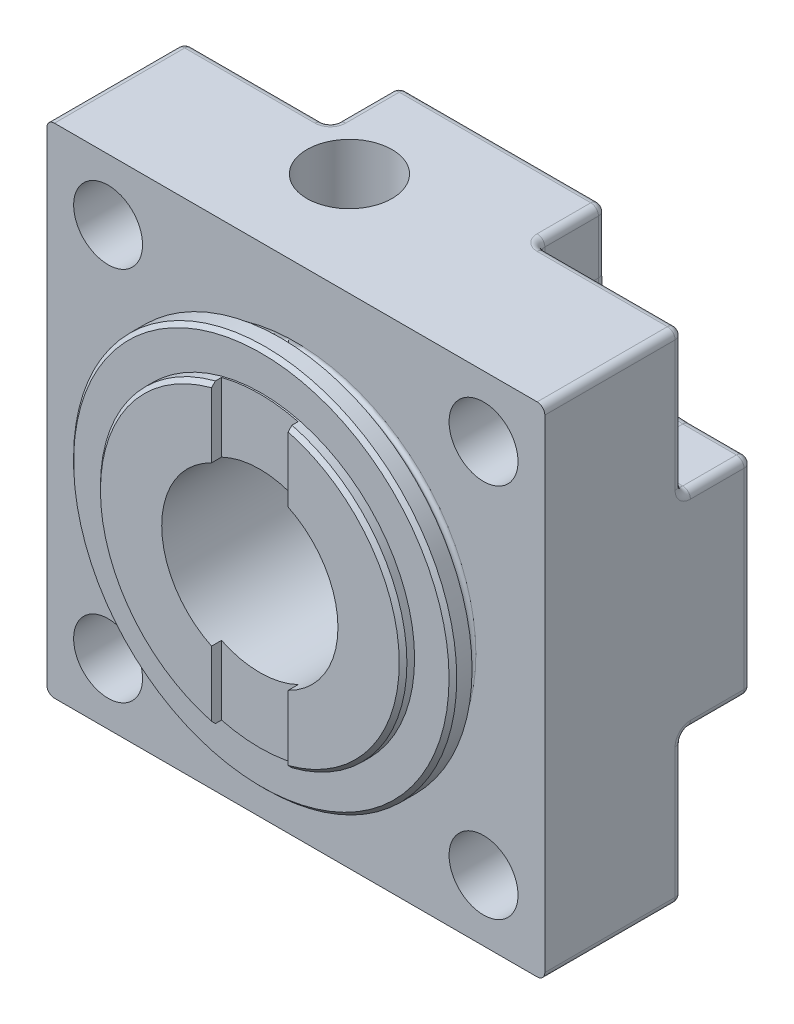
ISO-10303-21;
HEADER;
FILE_DESCRIPTION(('STEP AP214'),'2;1');
FILE_NAME('part.step','',(''),(''),'','','');
FILE_SCHEMA(('AUTOMOTIVE_DESIGN { 1 0 10303 214 1 1 1 1 }'));
ENDSEC;
DATA;
#1=APPLICATION_CONTEXT('core data for automotive mechanical design processes');
#2=APPLICATION_PROTOCOL_DEFINITION('international standard','automotive_design',2000,#1);
#3=PRODUCT_CONTEXT('',#1,'mechanical');
#4=PRODUCT('Part','Part','',(#3));
#5=PRODUCT_RELATED_PRODUCT_CATEGORY('part','',(#4));
#6=PRODUCT_DEFINITION_FORMATION('','',#4);
#7=PRODUCT_DEFINITION_CONTEXT('part definition',#1,'design');
#8=PRODUCT_DEFINITION('design','',#6,#7);
#9=PRODUCT_DEFINITION_SHAPE('','',#8);
#10=(LENGTH_UNIT() NAMED_UNIT(*) SI_UNIT(.MILLI.,.METRE.));
#11=(NAMED_UNIT(*) PLANE_ANGLE_UNIT() SI_UNIT($,.RADIAN.));
#12=(NAMED_UNIT(*) SI_UNIT($,.STERADIAN.) SOLID_ANGLE_UNIT());
#13=UNCERTAINTY_MEASURE_WITH_UNIT(LENGTH_MEASURE(1.E-05),#10,'distance_accuracy_value','');
#14=(GEOMETRIC_REPRESENTATION_CONTEXT(3) GLOBAL_UNCERTAINTY_ASSIGNED_CONTEXT((#13)) GLOBAL_UNIT_ASSIGNED_CONTEXT((#10,
#11,#12)) REPRESENTATION_CONTEXT('',''));
#15=CARTESIAN_POINT('',(0.,0.,0.));
#16=DIRECTION('',(0.,0.,1.));
#17=DIRECTION('',(1.,0.,0.));
#18=AXIS2_PLACEMENT_3D('',#15,#16,#17);
#19=CARTESIAN_POINT('',(32.5,32.5,33.));
#20=DIRECTION('',(0.,0.,1.));
#21=DIRECTION('',(1.,0.,0.));
#22=AXIS2_PLACEMENT_3D('',#19,#20,#21);
#23=PLANE('',#22);
#24=DIRECTION('',(0.,-1.,0.));
#25=VECTOR('',#24,1.);
#26=CARTESIAN_POINT('',(27.5,54.,33.));
#27=LINE('',#26,#25);
#28=CARTESIAN_POINT('',(27.5,51.3480768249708,33.));
#29=VERTEX_POINT('',#28);
#30=CARTESIAN_POINT('',(27.5,42.856157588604,33.));
#31=VERTEX_POINT('',#30);
#32=EDGE_CURVE('E1417',#29,#31,#27,.T.);
#33=ORIENTED_EDGE('',*,*,#32,.F.);
#34=CARTESIAN_POINT('',(32.5,32.5,33.));
#35=DIRECTION('',(0.,0.,1.));
#36=DIRECTION('',(1.,0.,0.));
#37=AXIS2_PLACEMENT_3D('',#34,#35,#36);
#38=CIRCLE('',#37,19.5);
#39=CARTESIAN_POINT('',(27.5,13.6519231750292,33.));
#40=VERTEX_POINT('',#39);
#41=EDGE_CURVE('E877',#29,#40,#38,.T.);
#42=ORIENTED_EDGE('',*,*,#41,.T.);
#43=CARTESIAN_POINT('',(27.5,22.143842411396,33.));
#44=VERTEX_POINT('',#43);
#45=EDGE_CURVE('E766',#44,#40,#27,.T.);
#46=ORIENTED_EDGE('',*,*,#45,.F.);
#47=CARTESIAN_POINT('',(32.5,32.5,33.));
#48=DIRECTION('',(0.,0.,1.));
#49=DIRECTION('',(1.,0.,0.));
#50=AXIS2_PLACEMENT_3D('',#47,#48,#49);
#51=CIRCLE('',#50,11.5);
#52=EDGE_CURVE('E1046',#31,#44,#51,.T.);
#53=ORIENTED_EDGE('',*,*,#52,.F.);
#54=EDGE_LOOP('',(#33,#42,#46,#53));
#55=FACE_BOUND('',#54,.T.);
#56=ADVANCED_FACE('F351',(#55),#23,.T.);
#57=CARTESIAN_POINT('',(32.5,32.5,33.));
#58=DIRECTION('',(0.,0.,-1.));
#59=DIRECTION('',(-1.,0.,0.));
#60=AXIS2_PLACEMENT_3D('',#57,#58,#59);
#61=CONICAL_SURFACE('',#60,19.5,0.785398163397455);
#62=CARTESIAN_POINT('',(27.5,76.2170744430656,8.49792507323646));
#63=CARTESIAN_POINT('',(27.5,75.0228656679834,9.68437150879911));
#64=CARTESIAN_POINT('',(27.5,73.8283688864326,10.8705284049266));
#65=CARTESIAN_POINT('',(27.5,71.438340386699,13.2422376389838));
#66=CARTESIAN_POINT('',(27.5,70.2428085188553,14.4277898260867));
#67=CARTESIAN_POINT('',(27.5,67.8459964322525,16.8024778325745));
#68=CARTESIAN_POINT('',(27.5,66.6447120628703,17.9916094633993));
#69=CARTESIAN_POINT('',(27.5,64.240914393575,20.3681941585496));
#70=CARTESIAN_POINT('',(27.5,63.0384013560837,21.5556474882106));
#71=CARTESIAN_POINT('',(27.5,60.9036955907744,23.6600013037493));
#72=CARTESIAN_POINT('',(27.5,59.9719118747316,24.5773166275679));
#73=CARTESIAN_POINT('',(27.5,58.1066866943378,26.4102993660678));
#74=CARTESIAN_POINT('',(27.5,57.1732451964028,27.32596674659));
#75=CARTESIAN_POINT('',(27.5,55.3034772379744,29.1555916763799));
#76=CARTESIAN_POINT('',(27.5,54.3671492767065,30.0695476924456));
#77=CARTESIAN_POINT('',(27.5,52.4913196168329,31.8940558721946));
#78=CARTESIAN_POINT('',(27.5,51.5518181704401,32.8046082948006));
#79=CARTESIAN_POINT('',(27.5,50.1406012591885,34.1649124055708));
#80=CARTESIAN_POINT('',(27.5,49.6707439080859,34.6165913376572));
#81=CARTESIAN_POINT('',(27.5,48.7294703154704,35.5183213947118));
#82=CARTESIAN_POINT('',(27.5,48.2580540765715,35.968372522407));
#83=CARTESIAN_POINT('',(27.5,47.3130827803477,36.8665158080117));
#84=CARTESIAN_POINT('',(27.5,46.8395271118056,37.3146073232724));
#85=CARTESIAN_POINT('',(27.5,45.8898119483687,38.2080073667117));
#86=CARTESIAN_POINT('',(27.5,45.4136525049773,38.6533159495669));
#87=CARTESIAN_POINT('',(27.5,44.4584479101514,39.5395697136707));
#88=CARTESIAN_POINT('',(27.5,43.9794073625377,39.9805198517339));
#89=CARTESIAN_POINT('',(27.5,43.016446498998,40.8571626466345));
#90=CARTESIAN_POINT('',(27.5,42.5325257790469,41.292854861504));
#91=CARTESIAN_POINT('',(27.5,41.8015281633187,41.9403692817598));
#92=CARTESIAN_POINT('',(27.5,41.557072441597,42.1551495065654));
#93=CARTESIAN_POINT('',(27.5,41.0660169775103,42.5822425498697));
#94=CARTESIAN_POINT('',(27.5,40.8194172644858,42.7945554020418));
#95=CARTESIAN_POINT('',(27.5,40.3236102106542,43.2160439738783));
#96=CARTESIAN_POINT('',(27.5,40.0744032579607,43.4252201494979));
#97=CARTESIAN_POINT('',(27.5,39.5726939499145,43.8395759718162));
#98=CARTESIAN_POINT('',(27.5,39.3201917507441,44.0447558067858));
#99=CARTESIAN_POINT('',(27.5,38.9696135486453,44.3236595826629));
#100=CARTESIAN_POINT('',(27.5,38.8733337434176,44.3996440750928));
#101=CARTESIAN_POINT('',(27.5,38.6801142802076,44.5507747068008));
#102=CARTESIAN_POINT('',(27.5,38.5831746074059,44.6259208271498));
#103=CARTESIAN_POINT('',(27.5,38.3885668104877,44.7752781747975));
#104=CARTESIAN_POINT('',(27.5,38.2908986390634,44.8494893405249));
#105=CARTESIAN_POINT('',(27.5,38.0947670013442,44.9968516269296));
#106=CARTESIAN_POINT('',(27.5,37.9963035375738,45.0700027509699));
#107=CARTESIAN_POINT('',(27.5,37.6990865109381,45.2880453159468));
#108=CARTESIAN_POINT('',(27.5,37.4990062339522,45.4311403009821));
#109=CARTESIAN_POINT('',(27.5,37.0945554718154,45.711138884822));
#110=CARTESIAN_POINT('',(27.5,36.8901852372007,45.8480428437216));
#111=CARTESIAN_POINT('',(27.5,36.4826925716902,46.1095241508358));
#112=CARTESIAN_POINT('',(27.5,36.2797331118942,46.2343537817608));
#113=CARTESIAN_POINT('',(27.5,35.8677738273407,46.4739069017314));
#114=CARTESIAN_POINT('',(27.5,35.6587718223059,46.5886266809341));
#115=CARTESIAN_POINT('',(27.5,35.2346380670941,46.8039498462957));
#116=CARTESIAN_POINT('',(27.5,35.019535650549,46.9046103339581));
#117=CARTESIAN_POINT('',(27.5,34.5817516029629,47.0875813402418));
#118=CARTESIAN_POINT('',(27.5,34.3590790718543,47.1699130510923));
#119=CARTESIAN_POINT('',(27.5,33.9879346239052,47.2851140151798));
#120=CARTESIAN_POINT('',(27.5,33.8416782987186,47.325111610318));
#121=CARTESIAN_POINT('',(27.5,33.5464501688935,47.3936842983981));
#122=CARTESIAN_POINT('',(27.5,33.3974780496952,47.4222580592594));
#123=CARTESIAN_POINT('',(27.5,33.0982105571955,47.4665064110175));
#124=CARTESIAN_POINT('',(27.5,32.9479228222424,47.4822319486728));
#125=CARTESIAN_POINT('',(27.5,32.6465360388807,47.5001145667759));
#126=CARTESIAN_POINT('',(27.5,32.4954370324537,47.5022723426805));
#127=CARTESIAN_POINT('',(27.5,32.1935387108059,47.4928920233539));
#128=CARTESIAN_POINT('',(27.5,32.0427397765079,47.4813418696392));
#129=CARTESIAN_POINT('',(27.5,31.7427323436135,47.4451742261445));
#130=CARTESIAN_POINT('',(27.5,31.5935239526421,47.4205558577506));
#131=CARTESIAN_POINT('',(27.5,31.2969441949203,47.3593597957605));
#132=CARTESIAN_POINT('',(27.5,31.1495834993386,47.3227310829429));
#133=CARTESIAN_POINT('',(27.5,30.8578685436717,47.2391012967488));
#134=CARTESIAN_POINT('',(27.5,30.7135143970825,47.1920998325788));
#135=CARTESIAN_POINT('',(27.5,30.4012917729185,47.079708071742));
#136=CARTESIAN_POINT('',(27.5,30.2340738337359,47.0125226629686));
#137=CARTESIAN_POINT('',(27.5,29.9039610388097,46.8681830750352));
#138=CARTESIAN_POINT('',(27.5,29.7410682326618,46.7910242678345));
#139=CARTESIAN_POINT('',(27.5,29.4190311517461,46.628628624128));
#140=CARTESIAN_POINT('',(27.5,29.2598939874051,46.5433777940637));
#141=CARTESIAN_POINT('',(27.5,28.9452369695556,46.3665334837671));
#142=CARTESIAN_POINT('',(27.5,28.7897166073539,46.2749409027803));
#143=CARTESIAN_POINT('',(27.5,28.4806881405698,46.0859672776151));
#144=CARTESIAN_POINT('',(27.5,28.3272029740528,45.9885488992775));
#145=CARTESIAN_POINT('',(27.5,28.0229778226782,45.7895233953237));
#146=CARTESIAN_POINT('',(27.5,27.8722379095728,45.68791616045));
#147=CARTESIAN_POINT('',(27.5,27.5732886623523,45.4813946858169));
#148=CARTESIAN_POINT('',(27.5,27.4250767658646,45.3764841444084));
#149=CARTESIAN_POINT('',(27.5,27.1306962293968,45.1638520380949));
#150=CARTESIAN_POINT('',(27.5,26.984527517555,45.0561305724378));
#151=CARTESIAN_POINT('',(27.5,26.6782357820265,44.8265672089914));
#152=CARTESIAN_POINT('',(27.5,26.5183132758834,44.7044581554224));
#153=CARTESIAN_POINT('',(27.5,26.2003118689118,44.4578599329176));
#154=CARTESIAN_POINT('',(27.5,26.0422330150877,44.3333707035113));
#155=CARTESIAN_POINT('',(27.5,25.5703246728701,43.9569177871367));
#156=CARTESIAN_POINT('',(27.5,25.2588564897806,43.7019939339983));
#157=CARTESIAN_POINT('',(27.5,24.6404994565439,43.1864227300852));
#158=CARTESIAN_POINT('',(27.5,24.3336125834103,42.9257730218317));
#159=CARTESIAN_POINT('',(27.5,23.7234330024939,42.4002923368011));
#160=CARTESIAN_POINT('',(27.5,23.4201403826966,42.1354612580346));
#161=CARTESIAN_POINT('',(27.5,22.8158820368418,41.6022045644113));
#162=CARTESIAN_POINT('',(27.5,22.5149207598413,41.3337739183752));
#163=CARTESIAN_POINT('',(27.5,21.9152244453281,40.7944328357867));
#164=CARTESIAN_POINT('',(27.5,21.6164894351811,40.5235223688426));
#165=CARTESIAN_POINT('',(27.5,21.0208919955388,39.9798103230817));
#166=CARTESIAN_POINT('',(27.5,20.7240290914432,39.7070092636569));
#167=CARTESIAN_POINT('',(27.5,20.1317677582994,39.159821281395));
#168=CARTESIAN_POINT('',(27.5,19.8363693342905,38.8854343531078));
#169=CARTESIAN_POINT('',(27.5,18.9543100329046,38.0625218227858));
#170=CARTESIAN_POINT('',(27.5,18.3694311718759,37.5120864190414));
#171=CARTESIAN_POINT('',(27.5,17.2029848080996,36.407651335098));
#172=CARTESIAN_POINT('',(27.5,16.6214175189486,35.853651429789));
#173=CARTESIAN_POINT('',(27.5,15.4612532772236,34.7435788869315));
#174=CARTESIAN_POINT('',(27.5,14.8826541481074,34.1875085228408));
#175=CARTESIAN_POINT('',(27.5,13.7273158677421,33.0734628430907));
#176=CARTESIAN_POINT('',(27.5,13.1505766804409,32.5154875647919));
#177=CARTESIAN_POINT('',(27.5,11.5760823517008,30.9883547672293));
#178=CARTESIAN_POINT('',(27.5,10.5797452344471,30.0177356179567));
#179=CARTESIAN_POINT('',(27.5,8.58988760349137,28.0736025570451));
#180=CARTESIAN_POINT('',(27.5,7.59636711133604,27.1000886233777));
#181=CARTESIAN_POINT('',(27.5,5.61097210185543,25.1506961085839));
#182=CARTESIAN_POINT('',(27.5,4.61909827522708,24.1748168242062));
#183=CARTESIAN_POINT('',(27.5,2.63679924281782,22.2215879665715));
#184=CARTESIAN_POINT('',(27.5,1.64637403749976,21.2442383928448));
#185=CARTESIAN_POINT('',(27.5,-0.334762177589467,19.287080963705));
#186=CARTESIAN_POINT('',(27.5,-1.32547167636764,18.3072715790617));
#187=CARTESIAN_POINT('',(27.5,-3.30605197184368,16.3468039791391));
#188=CARTESIAN_POINT('',(27.5,-4.29592276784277,15.366145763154));
#189=CARTESIAN_POINT('',(27.5,-6.27464079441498,13.4045286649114));
#190=CARTESIAN_POINT('',(27.5,-7.26348826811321,12.4235700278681));
#191=CARTESIAN_POINT('',(27.5,-9.2406498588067,10.4611175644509));
#192=CARTESIAN_POINT('',(27.5,-10.2289639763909,9.47962373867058));
#193=CARTESIAN_POINT('',(27.5,-11.2170744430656,8.49792507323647));
#194=B_SPLINE_CURVE_WITH_KNOTS('',3,(#62,#63,#64,#65,#66,#67,#68,#69,#70,#71,#72,#73,#74,#75,
#76,#77,#78,#79,#80,#81,#82,#83,#84,#85,#86,#87,#88,#89,#90,#91,#92,#93,#94,#95,#96,#97,#98,#99,
#100,#101,#102,#103,#104,#105,#106,#107,#108,#109,#110,#111,#112,#113,#114,#115,#116,#117,#118,
#119,#120,#121,#122,#123,#124,#125,#126,#127,#128,#129,#130,#131,#132,#133,#134,#135,#136,#137,
#138,#139,#140,#141,#142,#143,#144,#145,#146,#147,#148,#149,#150,#151,#152,#153,#154,#155,#156,
#157,#158,#159,#160,#161,#162,#163,#164,#165,#166,#167,#168,#169,#170,#171,#172,#173,#174,#175,
#176,#177,#178,#179,#180,#181,#182,#183,#184,#185,#186,#187,#188,#189,#190,#191,#192,#193),
.UNSPECIFIED.,.F.,.F.,(4,2,2,2,2,2,2,2,2,2,2,2,2,2,2,2,2,2,2,2,2,2,2,2,2,2,2,2,2,2,2,2,2,2,2,2,
2,2,2,2,2,2,2,2,2,2,2,2,2,2,2,2,2,2,2,2,2,2,2,2,2,2,2,2,2,4),(0.,5.05015950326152,
10.1012454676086,15.172148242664,20.2421312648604,24.1647813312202,28.0875117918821,
32.012839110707,35.9378614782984,37.8931125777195,39.8483604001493,41.8042074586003,
43.7600159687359,45.7132593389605,47.6666657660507,48.6428718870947,49.619064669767,
50.5951141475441,51.5711175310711,51.939069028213,52.3070288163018,52.6750127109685,
53.0429954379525,53.7808546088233,54.5186708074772,55.2332781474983,55.9481466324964,
56.6600215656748,57.3710690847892,57.8255672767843,58.2801184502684,58.7328583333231,
59.1855750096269,59.6386902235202,60.0918359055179,60.5469320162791,61.0020452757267,
61.5422616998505,62.0827297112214,62.6241500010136,63.1654936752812,63.7107842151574,
64.2560889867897,64.8008035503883,65.3454989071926,65.9491038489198,66.5527241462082,
67.7600892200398,68.9679610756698,70.1758624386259,71.3856779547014,72.5955083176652,
73.8050185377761,75.0145329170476,77.4239816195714,79.8335840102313,82.2410498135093,
84.6484686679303,88.8213593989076,92.994281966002,97.1686523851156,101.343024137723,
105.52318922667,109.703357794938,113.881980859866,118.060599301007),.UNSPECIFIED.);
#195=CARTESIAN_POINT('',(27.5,51.8649167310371,32.5));
#196=VERTEX_POINT('',#195);
#197=EDGE_CURVE('E1464',#196,#29,#194,.T.);
#198=ORIENTED_EDGE('',*,*,#197,.F.);
#199=CARTESIAN_POINT('',(32.5,32.5,32.5));
#200=DIRECTION('',(0.,0.,1.));
#201=DIRECTION('',(1.,0.,0.));
#202=AXIS2_PLACEMENT_3D('',#199,#200,#201);
#203=CIRCLE('',#202,20.);
#204=CARTESIAN_POINT('',(27.5,13.1350832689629,32.5));
#205=VERTEX_POINT('',#204);
#206=EDGE_CURVE('E888',#205,#196,#203,.F.);
#207=ORIENTED_EDGE('',*,*,#206,.F.);
#208=EDGE_CURVE('E818',#40,#205,#194,.T.);
#209=ORIENTED_EDGE('',*,*,#208,.F.);
#210=ORIENTED_EDGE('',*,*,#41,.F.);
#211=EDGE_LOOP('',(#198,#207,#209,#210));
#212=FACE_BOUND('',#211,.T.);
#213=ADVANCED_FACE('F829',(#212),#61,.T.);
#214=CARTESIAN_POINT('',(0.,65.,27.));
#215=DIRECTION('',(0.,0.,-1.));
#216=DIRECTION('',(-1.,0.,0.));
#217=AXIS2_PLACEMENT_3D('',#214,#215,#216);
#218=PLANE('',#217);
#219=CARTESIAN_POINT('',(32.5,32.5,27.));
#220=DIRECTION('',(0.,0.,-1.));
#221=DIRECTION('',(-1.,0.,0.));
#222=AXIS2_PLACEMENT_3D('',#219,#220,#221);
#223=CIRCLE('',#222,23.5);
#224=CARTESIAN_POINT('',(8.99999999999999,32.5,27.));
#225=VERTEX_POINT('',#224);
#226=EDGE_CURVE('E2355',#225,#225,#223,.T.);
#227=ORIENTED_EDGE('',*,*,#226,.T.);
#228=EDGE_LOOP('',(#227));
#229=FACE_BOUND('',#228,.T.);
#230=CARTESIAN_POINT('',(57.,8.,27.));
#231=DIRECTION('',(0.,0.,-1.));
#232=DIRECTION('',(-1.,0.,0.));
#233=AXIS2_PLACEMENT_3D('',#230,#231,#232);
#234=CIRCLE('',#233,4.5);
#235=CARTESIAN_POINT('',(52.5,8.,27.));
#236=VERTEX_POINT('',#235);
#237=EDGE_CURVE('E996',#236,#236,#234,.T.);
#238=ORIENTED_EDGE('',*,*,#237,.T.);
#239=EDGE_LOOP('',(#238));
#240=FACE_BOUND('',#239,.T.);
#241=CARTESIAN_POINT('',(57.,57.,27.));
#242=DIRECTION('',(0.,0.,-1.));
#243=DIRECTION('',(-1.,0.,0.));
#244=AXIS2_PLACEMENT_3D('',#241,#242,#243);
#245=CIRCLE('',#244,4.5);
#246=CARTESIAN_POINT('',(52.5,57.,27.));
#247=VERTEX_POINT('',#246);
#248=EDGE_CURVE('E1024',#247,#247,#245,.F.);
#249=ORIENTED_EDGE('',*,*,#248,.F.);
#250=EDGE_LOOP('',(#249));
#251=FACE_BOUND('',#250,.T.);
#252=CARTESIAN_POINT('',(8.,57.,27.));
#253=DIRECTION('',(0.,0.,-1.));
#254=DIRECTION('',(-1.,0.,0.));
#255=AXIS2_PLACEMENT_3D('',#252,#253,#254);
#256=CIRCLE('',#255,4.5);
#257=CARTESIAN_POINT('',(3.5,57.,27.));
#258=VERTEX_POINT('',#257);
#259=EDGE_CURVE('E1036',#258,#258,#256,.T.);
#260=ORIENTED_EDGE('',*,*,#259,.T.);
#261=EDGE_LOOP('',(#260));
#262=FACE_BOUND('',#261,.T.);
#263=DIRECTION('',(0.,1.,0.));
#264=VECTOR('',#263,1.);
#265=CARTESIAN_POINT('',(65.,0.,27.));
#266=LINE('',#265,#264);
#267=CARTESIAN_POINT('',(65.,1.,27.));
#268=VERTEX_POINT('',#267);
#269=CARTESIAN_POINT('',(65.,64.,27.));
#270=VERTEX_POINT('',#269);
#271=EDGE_CURVE('E883',#268,#270,#266,.T.);
#272=ORIENTED_EDGE('',*,*,#271,.T.);
#273=CARTESIAN_POINT('',(64.,64.,27.));
#274=DIRECTION('',(0.,0.,-1.));
#275=DIRECTION('',(-1.,0.,0.));
#276=AXIS2_PLACEMENT_3D('',#273,#274,#275);
#277=CIRCLE('',#276,1.);
#278=CARTESIAN_POINT('',(64.,65.,27.));
#279=VERTEX_POINT('',#278);
#280=EDGE_CURVE('E1063',#270,#279,#277,.F.);
#281=ORIENTED_EDGE('',*,*,#280,.T.);
#282=DIRECTION('',(-1.,0.,0.));
#283=VECTOR('',#282,1.);
#284=CARTESIAN_POINT('',(0.,65.,27.));
#285=LINE('',#284,#283);
#286=CARTESIAN_POINT('',(1.,65.,27.));
#287=VERTEX_POINT('',#286);
#288=EDGE_CURVE('E878',#279,#287,#285,.T.);
#289=ORIENTED_EDGE('',*,*,#288,.T.);
#290=CARTESIAN_POINT('',(1.,64.,27.));
#291=DIRECTION('',(0.,0.,-1.));
#292=DIRECTION('',(-1.,0.,0.));
#293=AXIS2_PLACEMENT_3D('',#290,#291,#292);
#294=CIRCLE('',#293,1.);
#295=CARTESIAN_POINT('',(0.,64.,27.));
#296=VERTEX_POINT('',#295);
#297=EDGE_CURVE('E1079',#287,#296,#294,.F.);
#298=ORIENTED_EDGE('',*,*,#297,.T.);
#299=DIRECTION('',(0.,-1.,0.));
#300=VECTOR('',#299,1.);
#301=CARTESIAN_POINT('',(0.,0.,27.));
#302=LINE('',#301,#300);
#303=CARTESIAN_POINT('',(0.,1.,27.));
#304=VERTEX_POINT('',#303);
#305=EDGE_CURVE('E1053',#296,#304,#302,.T.);
#306=ORIENTED_EDGE('',*,*,#305,.T.);
#307=CARTESIAN_POINT('',(1.,1.,27.));
#308=DIRECTION('',(0.,0.,-1.));
#309=DIRECTION('',(-1.,0.,0.));
#310=AXIS2_PLACEMENT_3D('',#307,#308,#309);
#311=CIRCLE('',#310,1.);
#312=CARTESIAN_POINT('',(1.,0.,27.));
#313=VERTEX_POINT('',#312);
#314=EDGE_CURVE('E2273',#304,#313,#311,.F.);
#315=ORIENTED_EDGE('',*,*,#314,.T.);
#316=DIRECTION('',(1.,0.,0.));
#317=VECTOR('',#316,1.);
#318=CARTESIAN_POINT('',(0.,0.,27.));
#319=LINE('',#318,#317);
#320=CARTESIAN_POINT('',(64.,0.,27.));
#321=VERTEX_POINT('',#320);
#322=EDGE_CURVE('E1056',#313,#321,#319,.T.);
#323=ORIENTED_EDGE('',*,*,#322,.T.);
#324=CARTESIAN_POINT('',(64.,1.,27.));
#325=DIRECTION('',(0.,0.,-1.));
#326=DIRECTION('',(-1.,0.,0.));
#327=AXIS2_PLACEMENT_3D('',#324,#325,#326);
#328=CIRCLE('',#327,1.);
#329=EDGE_CURVE('E1066',#321,#268,#328,.F.);
#330=ORIENTED_EDGE('',*,*,#329,.T.);
#331=EDGE_LOOP('',(#272,#281,#289,#298,#306,#315,#323,#330));
#332=FACE_BOUND('',#331,.T.);
#333=CARTESIAN_POINT('',(8.,8.,27.));
#334=DIRECTION('',(0.,0.,-1.));
#335=DIRECTION('',(-1.,0.,0.));
#336=AXIS2_PLACEMENT_3D('',#333,#334,#335);
#337=CIRCLE('',#336,4.5);
#338=CARTESIAN_POINT('',(3.5,8.,27.));
#339=VERTEX_POINT('',#338);
#340=EDGE_CURVE('E1012',#339,#339,#337,.F.);
#341=ORIENTED_EDGE('',*,*,#340,.F.);
#342=EDGE_LOOP('',(#341));
#343=FACE_BOUND('',#342,.T.);
#344=ADVANCED_FACE('F847',(#229,#240,#251,#262,#332,#343),#218,.F.);
#345=CARTESIAN_POINT('',(8.,8.,9.));
#346=DIRECTION('',(0.,0.,-1.));
#347=DIRECTION('',(-1.,0.,0.));
#348=AXIS2_PLACEMENT_3D('',#345,#346,#347);
#349=PLANE('',#348);
#350=DIRECTION('',(0.,1.,0.));
#351=VECTOR('',#350,1.);
#352=CARTESIAN_POINT('',(18.,0.,9.));
#353=LINE('',#352,#351);
#354=CARTESIAN_POINT('',(18.,8.00000000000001,9.));
#355=VERTEX_POINT('',#354);
#356=CARTESIAN_POINT('',(18.,1.,9.));
#357=VERTEX_POINT('',#356);
#358=EDGE_CURVE('E1195',#355,#357,#353,.F.);
#359=ORIENTED_EDGE('',*,*,#358,.T.);
#360=DIRECTION('',(1.,0.,0.));
#361=VECTOR('',#360,1.);
#362=CARTESIAN_POINT('',(1.,1.,9.));
#363=LINE('',#362,#361);
#364=CARTESIAN_POINT('',(1.,1.,9.));
#365=VERTEX_POINT('',#364);
#366=EDGE_CURVE('E1200',#357,#365,#363,.F.);
#367=ORIENTED_EDGE('',*,*,#366,.T.);
#368=DIRECTION('',(0.,-1.,0.));
#369=VECTOR('',#368,1.);
#370=CARTESIAN_POINT('',(1.,19.,9.));
#371=LINE('',#370,#369);
#372=CARTESIAN_POINT('',(1.,18.,9.));
#373=VERTEX_POINT('',#372);
#374=EDGE_CURVE('E1197',#365,#373,#371,.F.);
#375=ORIENTED_EDGE('',*,*,#374,.T.);
#376=DIRECTION('',(-1.,0.,0.));
#377=VECTOR('',#376,1.);
#378=CARTESIAN_POINT('',(8.,18.,9.));
#379=LINE('',#378,#377);
#380=CARTESIAN_POINT('',(8.,18.,9.));
#381=VERTEX_POINT('',#380);
#382=EDGE_CURVE('E1193',#373,#381,#379,.F.);
#383=ORIENTED_EDGE('',*,*,#382,.T.);
#384=CARTESIAN_POINT('',(8.,8.,9.));
#385=DIRECTION('',(0.,0.,-1.));
#386=DIRECTION('',(-1.,0.,0.));
#387=AXIS2_PLACEMENT_3D('',#384,#385,#386);
#388=CIRCLE('',#387,10.);
#389=EDGE_CURVE('E1191',#381,#355,#388,.T.);
#390=ORIENTED_EDGE('',*,*,#389,.T.);
#391=EDGE_LOOP('',(#359,#367,#375,#383,#390));
#392=FACE_BOUND('',#391,.T.);
#393=CARTESIAN_POINT('',(8.,8.,9.));
#394=DIRECTION('',(0.,0.,1.));
#395=DIRECTION('',(-1.,0.,0.));
#396=AXIS2_PLACEMENT_3D('',#393,#394,#395);
#397=CIRCLE('',#396,4.5);
#398=CARTESIAN_POINT('',(3.5,8.,9.));
#399=VERTEX_POINT('',#398);
#400=EDGE_CURVE('E1008',#399,#399,#397,.T.);
#401=ORIENTED_EDGE('',*,*,#400,.T.);
#402=EDGE_LOOP('',(#401));
#403=FACE_BOUND('',#402,.T.);
#404=ADVANCED_FACE('F961',(#392,#403),#349,.T.);
#405=CARTESIAN_POINT('',(0.,65.,0.));
#406=DIRECTION('',(0.,0.,-1.));
#407=DIRECTION('',(-1.,0.,0.));
#408=AXIS2_PLACEMENT_3D('',#405,#406,#407);
#409=PLANE('',#408);
#410=DIRECTION('',(0.,-1.,0.));
#411=VECTOR('',#410,1.);
#412=CARTESIAN_POINT('',(1.,46.,0.));
#413=LINE('',#412,#411);
#414=CARTESIAN_POINT('',(1.,20.,0.));
#415=VERTEX_POINT('',#414);
#416=CARTESIAN_POINT('',(1.,45.,0.));
#417=VERTEX_POINT('',#416);
#418=EDGE_CURVE('E1105',#415,#417,#413,.F.);
#419=ORIENTED_EDGE('',*,*,#418,.T.);
#420=DIRECTION('',(-1.,0.,0.));
#421=VECTOR('',#420,1.);
#422=CARTESIAN_POINT('',(8.,45.,0.));
#423=LINE('',#422,#421);
#424=CARTESIAN_POINT('',(8.,45.,0.));
#425=VERTEX_POINT('',#424);
#426=EDGE_CURVE('E1233',#417,#425,#423,.F.);
#427=ORIENTED_EDGE('',*,*,#426,.T.);
#428=CARTESIAN_POINT('',(8.,57.,0.));
#429=DIRECTION('',(0.,0.,-1.));
#430=DIRECTION('',(-1.,0.,0.));
#431=AXIS2_PLACEMENT_3D('',#428,#429,#430);
#432=CIRCLE('',#431,12.);
#433=CARTESIAN_POINT('',(20.,57.,0.));
#434=VERTEX_POINT('',#433);
#435=EDGE_CURVE('E1231',#425,#434,#432,.F.);
#436=ORIENTED_EDGE('',*,*,#435,.T.);
#437=DIRECTION('',(0.,-1.,0.));
#438=VECTOR('',#437,1.);
#439=CARTESIAN_POINT('',(20.,64.,0.));
#440=LINE('',#439,#438);
#441=CARTESIAN_POINT('',(20.,64.,0.));
#442=VERTEX_POINT('',#441);
#443=EDGE_CURVE('E1229',#434,#442,#440,.F.);
#444=ORIENTED_EDGE('',*,*,#443,.T.);
#445=DIRECTION('',(-1.,0.,0.));
#446=VECTOR('',#445,1.);
#447=CARTESIAN_POINT('',(45.,64.,0.));
#448=LINE('',#447,#446);
#449=CARTESIAN_POINT('',(45.,64.,0.));
#450=VERTEX_POINT('',#449);
#451=EDGE_CURVE('E1097',#442,#450,#448,.F.);
#452=ORIENTED_EDGE('',*,*,#451,.T.);
#453=DIRECTION('',(0.,-1.,0.));
#454=VECTOR('',#453,1.);
#455=CARTESIAN_POINT('',(45.,65.,0.));
#456=LINE('',#455,#454);
#457=CARTESIAN_POINT('',(45.,57.,0.));
#458=VERTEX_POINT('',#457);
#459=EDGE_CURVE('E2348',#450,#458,#456,.T.);
#460=ORIENTED_EDGE('',*,*,#459,.T.);
#461=CARTESIAN_POINT('',(57.,57.,0.));
#462=DIRECTION('',(0.,0.,-1.));
#463=DIRECTION('',(-1.,0.,0.));
#464=AXIS2_PLACEMENT_3D('',#461,#462,#463);
#465=CIRCLE('',#464,12.);
#466=CARTESIAN_POINT('',(57.,45.,0.));
#467=VERTEX_POINT('',#466);
#468=EDGE_CURVE('E2350',#458,#467,#465,.F.);
#469=ORIENTED_EDGE('',*,*,#468,.T.);
#470=DIRECTION('',(1.,0.,0.));
#471=VECTOR('',#470,1.);
#472=CARTESIAN_POINT('',(0.,45.,0.));
#473=LINE('',#472,#471);
#474=CARTESIAN_POINT('',(64.,45.,0.));
#475=VERTEX_POINT('',#474);
#476=EDGE_CURVE('E2352',#467,#475,#473,.T.);
#477=ORIENTED_EDGE('',*,*,#476,.T.);
#478=DIRECTION('',(0.,1.,0.));
#479=VECTOR('',#478,1.);
#480=CARTESIAN_POINT('',(64.,19.,0.));
#481=LINE('',#480,#479);
#482=CARTESIAN_POINT('',(64.,20.,0.));
#483=VERTEX_POINT('',#482);
#484=EDGE_CURVE('E1102',#475,#483,#481,.F.);
#485=ORIENTED_EDGE('',*,*,#484,.T.);
#486=DIRECTION('',(1.,0.,0.));
#487=VECTOR('',#486,1.);
#488=CARTESIAN_POINT('',(57.,20.,0.));
#489=LINE('',#488,#487);
#490=CARTESIAN_POINT('',(57.,20.,0.));
#491=VERTEX_POINT('',#490);
#492=EDGE_CURVE('E1144',#483,#491,#489,.F.);
#493=ORIENTED_EDGE('',*,*,#492,.T.);
#494=CARTESIAN_POINT('',(57.,8.,0.));
#495=DIRECTION('',(0.,0.,-1.));
#496=DIRECTION('',(-1.,0.,0.));
#497=AXIS2_PLACEMENT_3D('',#494,#495,#496);
#498=CIRCLE('',#497,12.);
#499=CARTESIAN_POINT('',(45.,8.00000000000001,0.));
#500=VERTEX_POINT('',#499);
#501=EDGE_CURVE('E1142',#491,#500,#498,.F.);
#502=ORIENTED_EDGE('',*,*,#501,.T.);
#503=DIRECTION('',(0.,1.,0.));
#504=VECTOR('',#503,1.);
#505=CARTESIAN_POINT('',(45.,1.,0.));
#506=LINE('',#505,#504);
#507=CARTESIAN_POINT('',(45.,1.,0.));
#508=VERTEX_POINT('',#507);
#509=EDGE_CURVE('E1146',#500,#508,#506,.F.);
#510=ORIENTED_EDGE('',*,*,#509,.T.);
#511=DIRECTION('',(1.,0.,0.));
#512=VECTOR('',#511,1.);
#513=CARTESIAN_POINT('',(19.,1.,0.));
#514=LINE('',#513,#512);
#515=CARTESIAN_POINT('',(20.,1.,0.));
#516=VERTEX_POINT('',#515);
#517=EDGE_CURVE('E1099',#508,#516,#514,.F.);
#518=ORIENTED_EDGE('',*,*,#517,.T.);
#519=DIRECTION('',(0.,1.,0.));
#520=VECTOR('',#519,1.);
#521=CARTESIAN_POINT('',(20.,65.,0.));
#522=LINE('',#521,#520);
#523=CARTESIAN_POINT('',(20.,8.00000000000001,0.));
#524=VERTEX_POINT('',#523);
#525=EDGE_CURVE('E1167',#516,#524,#522,.T.);
#526=ORIENTED_EDGE('',*,*,#525,.T.);
#527=CARTESIAN_POINT('',(8.,8.,0.));
#528=DIRECTION('',(0.,0.,-1.));
#529=DIRECTION('',(-1.,0.,0.));
#530=AXIS2_PLACEMENT_3D('',#527,#528,#529);
#531=CIRCLE('',#530,12.);
#532=CARTESIAN_POINT('',(8.,20.,0.));
#533=VERTEX_POINT('',#532);
#534=EDGE_CURVE('E1169',#524,#533,#531,.F.);
#535=ORIENTED_EDGE('',*,*,#534,.T.);
#536=DIRECTION('',(-1.,0.,0.));
#537=VECTOR('',#536,1.);
#538=CARTESIAN_POINT('',(0.,20.,0.));
#539=LINE('',#538,#537);
#540=EDGE_CURVE('E1171',#533,#415,#539,.T.);
#541=ORIENTED_EDGE('',*,*,#540,.T.);
#542=EDGE_LOOP('',(#419,#427,#436,#444,#452,#460,#469,#477,#485,#493,#502,#510,#518,#526,#535,#541));
#543=FACE_BOUND('',#542,.T.);
#544=ADVANCED_FACE('F964',(#543),#409,.T.);
#545=CARTESIAN_POINT('',(0.,0.,27.));
#546=DIRECTION('',(1.,0.,0.));
#547=DIRECTION('',(0.,0.,-1.));
#548=AXIS2_PLACEMENT_3D('',#545,#546,#547);
#549=PLANE('',#548);
#550=CARTESIAN_POINT('',(0.,47.,8.));
#551=DIRECTION('',(1.,0.,0.));
#552=DIRECTION('',(0.,0.,-1.));
#553=AXIS2_PLACEMENT_3D('',#550,#551,#552);
#554=CIRCLE('',#553,2.);
#555=CARTESIAN_POINT('',(0.,45.,8.));
#556=VERTEX_POINT('',#555);
#557=CARTESIAN_POINT('',(0.,47.,10.));
#558=VERTEX_POINT('',#557);
#559=EDGE_CURVE('E1235',#556,#558,#554,.F.);
#560=ORIENTED_EDGE('',*,*,#559,.F.);
#561=DIRECTION('',(0.,0.,-1.));
#562=VECTOR('',#561,1.);
#563=CARTESIAN_POINT('',(0.,45.,27.));
#564=LINE('',#563,#562);
#565=CARTESIAN_POINT('',(0.,45.,1.));
#566=VERTEX_POINT('',#565);
#567=EDGE_CURVE('E1240',#556,#566,#564,.T.);
#568=ORIENTED_EDGE('',*,*,#567,.T.);
#569=DIRECTION('',(0.,-1.,0.));
#570=VECTOR('',#569,1.);
#571=CARTESIAN_POINT('',(0.,19.,1.));
#572=LINE('',#571,#570);
#573=CARTESIAN_POINT('',(0.,20.,1.));
#574=VERTEX_POINT('',#573);
#575=EDGE_CURVE('E1078',#566,#574,#572,.T.);
#576=ORIENTED_EDGE('',*,*,#575,.T.);
#577=DIRECTION('',(0.,0.,-1.));
#578=VECTOR('',#577,1.);
#579=CARTESIAN_POINT('',(0.,20.,9.));
#580=LINE('',#579,#578);
#581=CARTESIAN_POINT('',(0.,20.,8.));
#582=VERTEX_POINT('',#581);
#583=EDGE_CURVE('E1185',#574,#582,#580,.F.);
#584=ORIENTED_EDGE('',*,*,#583,.T.);
#585=CARTESIAN_POINT('',(0.,18.,8.));
#586=DIRECTION('',(1.,0.,0.));
#587=DIRECTION('',(0.,0.,-1.));
#588=AXIS2_PLACEMENT_3D('',#585,#586,#587);
#589=CIRCLE('',#588,2.);
#590=CARTESIAN_POINT('',(0.,18.,10.));
#591=VERTEX_POINT('',#590);
#592=EDGE_CURVE('E1182',#591,#582,#589,.F.);
#593=ORIENTED_EDGE('',*,*,#592,.F.);
#594=DIRECTION('',(0.,-1.,0.));
#595=VECTOR('',#594,1.);
#596=CARTESIAN_POINT('',(0.,1.,10.));
#597=LINE('',#596,#595);
#598=CARTESIAN_POINT('',(0.,1.,10.));
#599=VERTEX_POINT('',#598);
#600=EDGE_CURVE('E1180',#591,#599,#597,.T.);
#601=ORIENTED_EDGE('',*,*,#600,.T.);
#602=DIRECTION('',(0.,0.,-1.));
#603=VECTOR('',#602,1.);
#604=CARTESIAN_POINT('',(0.,1.,27.));
#605=LINE('',#604,#603);
#606=EDGE_CURVE('E1081',#599,#304,#605,.F.);
#607=ORIENTED_EDGE('',*,*,#606,.T.);
#608=ORIENTED_EDGE('',*,*,#305,.F.);
#609=DIRECTION('',(0.,0.,-1.));
#610=VECTOR('',#609,1.);
#611=CARTESIAN_POINT('',(0.,64.,27.));
#612=LINE('',#611,#610);
#613=CARTESIAN_POINT('',(0.,64.,10.));
#614=VERTEX_POINT('',#613);
#615=EDGE_CURVE('E1087',#296,#614,#612,.T.);
#616=ORIENTED_EDGE('',*,*,#615,.T.);
#617=DIRECTION('',(0.,1.,0.));
#618=VECTOR('',#617,1.);
#619=CARTESIAN_POINT('',(0.,46.,10.));
#620=LINE('',#619,#618);
#621=EDGE_CURVE('E1238',#614,#558,#620,.F.);
#622=ORIENTED_EDGE('',*,*,#621,.T.);
#623=EDGE_LOOP('',(#560,#568,#576,#584,#593,#601,#607,#608,#616,#622));
#624=FACE_BOUND('',#623,.T.);
#625=ADVANCED_FACE('F353',(#624),#549,.F.);
#626=CARTESIAN_POINT('',(0.,0.,27.));
#627=DIRECTION('',(0.,1.,0.));
#628=DIRECTION('',(0.,0.,1.));
#629=AXIS2_PLACEMENT_3D('',#626,#627,#628);
#630=PLANE('',#629);
#631=DIRECTION('',(0.,0.,-1.));
#632=VECTOR('',#631,1.);
#633=CARTESIAN_POINT('',(1.,0.,27.));
#634=LINE('',#633,#632);
#635=CARTESIAN_POINT('',(1.,0.,10.));
#636=VERTEX_POINT('',#635);
#637=EDGE_CURVE('E1092',#313,#636,#634,.T.);
#638=ORIENTED_EDGE('',*,*,#637,.T.);
#639=DIRECTION('',(1.,0.,0.));
#640=VECTOR('',#639,1.);
#641=CARTESIAN_POINT('',(19.,0.,10.));
#642=LINE('',#641,#640);
#643=CARTESIAN_POINT('',(18.,0.,10.));
#644=VERTEX_POINT('',#643);
#645=EDGE_CURVE('E1217',#636,#644,#642,.T.);
#646=ORIENTED_EDGE('',*,*,#645,.T.);
#647=CARTESIAN_POINT('',(18.,0.,8.));
#648=DIRECTION('',(0.,1.,0.));
#649=DIRECTION('',(0.,0.,1.));
#650=AXIS2_PLACEMENT_3D('',#647,#648,#649);
#651=CIRCLE('',#650,2.);
#652=CARTESIAN_POINT('',(20.,0.,8.));
#653=VERTEX_POINT('',#652);
#654=EDGE_CURVE('E1214',#653,#644,#651,.F.);
#655=ORIENTED_EDGE('',*,*,#654,.F.);
#656=DIRECTION('',(0.,0.,-1.));
#657=VECTOR('',#656,1.);
#658=CARTESIAN_POINT('',(20.,0.,1.));
#659=LINE('',#658,#657);
#660=CARTESIAN_POINT('',(20.,0.,1.));
#661=VERTEX_POINT('',#660);
#662=EDGE_CURVE('E1212',#653,#661,#659,.T.);
#663=ORIENTED_EDGE('',*,*,#662,.T.);
#664=DIRECTION('',(1.,0.,0.));
#665=VECTOR('',#664,1.);
#666=CARTESIAN_POINT('',(46.,0.,1.));
#667=LINE('',#666,#665);
#668=CARTESIAN_POINT('',(45.,0.,1.));
#669=VERTEX_POINT('',#668);
#670=EDGE_CURVE('E1090',#661,#669,#667,.T.);
#671=ORIENTED_EDGE('',*,*,#670,.T.);
#672=DIRECTION('',(0.,0.,-1.));
#673=VECTOR('',#672,1.);
#674=CARTESIAN_POINT('',(45.,0.,27.));
#675=LINE('',#674,#673);
#676=CARTESIAN_POINT('',(45.,0.,8.));
#677=VERTEX_POINT('',#676);
#678=EDGE_CURVE('E1160',#669,#677,#675,.F.);
#679=ORIENTED_EDGE('',*,*,#678,.T.);
#680=CARTESIAN_POINT('',(47.,0.,8.));
#681=DIRECTION('',(0.,1.,0.));
#682=DIRECTION('',(0.,0.,1.));
#683=AXIS2_PLACEMENT_3D('',#680,#681,#682);
#684=CIRCLE('',#683,2.);
#685=CARTESIAN_POINT('',(47.,0.,10.));
#686=VERTEX_POINT('',#685);
#687=EDGE_CURVE('E1157',#686,#677,#684,.F.);
#688=ORIENTED_EDGE('',*,*,#687,.F.);
#689=DIRECTION('',(-1.,0.,0.));
#690=VECTOR('',#689,1.);
#691=CARTESIAN_POINT('',(64.,0.,10.));
#692=LINE('',#691,#690);
#693=CARTESIAN_POINT('',(64.,0.,10.));
#694=VERTEX_POINT('',#693);
#695=EDGE_CURVE('E1162',#686,#694,#692,.F.);
#696=ORIENTED_EDGE('',*,*,#695,.T.);
#697=DIRECTION('',(0.,0.,-1.));
#698=VECTOR('',#697,1.);
#699=CARTESIAN_POINT('',(64.,0.,27.));
#700=LINE('',#699,#698);
#701=EDGE_CURVE('E1095',#694,#321,#700,.F.);
#702=ORIENTED_EDGE('',*,*,#701,.T.);
#703=ORIENTED_EDGE('',*,*,#322,.F.);
#704=EDGE_LOOP('',(#638,#646,#655,#663,#671,#679,#688,#696,#702,#703));
#705=FACE_BOUND('',#704,.T.);
#706=ADVANCED_FACE('F943',(#705),#630,.F.);
#707=CARTESIAN_POINT('',(57.,57.,9.));
#708=DIRECTION('',(0.,0.,-1.));
#709=DIRECTION('',(1.,0.,0.));
#710=AXIS2_PLACEMENT_3D('',#707,#708,#709);
#711=PLANE('',#710);
#712=DIRECTION('',(0.,-1.,0.));
#713=VECTOR('',#712,1.);
#714=CARTESIAN_POINT('',(47.,65.,9.));
#715=LINE('',#714,#713);
#716=CARTESIAN_POINT('',(47.,57.,9.));
#717=VERTEX_POINT('',#716);
#718=CARTESIAN_POINT('',(47.,64.,9.));
#719=VERTEX_POINT('',#718);
#720=EDGE_CURVE('E2305',#717,#719,#715,.F.);
#721=ORIENTED_EDGE('',*,*,#720,.T.);
#722=DIRECTION('',(-1.,0.,0.));
#723=VECTOR('',#722,1.);
#724=CARTESIAN_POINT('',(65.,64.,9.));
#725=LINE('',#724,#723);
#726=CARTESIAN_POINT('',(64.,64.,9.));
#727=VERTEX_POINT('',#726);
#728=EDGE_CURVE('E2302',#719,#727,#725,.F.);
#729=ORIENTED_EDGE('',*,*,#728,.T.);
#730=DIRECTION('',(0.,1.,0.));
#731=VECTOR('',#730,1.);
#732=CARTESIAN_POINT('',(64.,46.,9.));
#733=LINE('',#732,#731);
#734=CARTESIAN_POINT('',(64.,47.,9.));
#735=VERTEX_POINT('',#734);
#736=EDGE_CURVE('E2307',#727,#735,#733,.F.);
#737=ORIENTED_EDGE('',*,*,#736,.T.);
#738=DIRECTION('',(1.,0.,0.));
#739=VECTOR('',#738,1.);
#740=CARTESIAN_POINT('',(57.,47.,9.));
#741=LINE('',#740,#739);
#742=CARTESIAN_POINT('',(57.,47.,9.));
#743=VERTEX_POINT('',#742);
#744=EDGE_CURVE('E2312',#735,#743,#741,.F.);
#745=ORIENTED_EDGE('',*,*,#744,.T.);
#746=CARTESIAN_POINT('',(57.,57.,9.));
#747=DIRECTION('',(0.,0.,-1.));
#748=DIRECTION('',(-1.,0.,0.));
#749=AXIS2_PLACEMENT_3D('',#746,#747,#748);
#750=CIRCLE('',#749,10.);
#751=EDGE_CURVE('E2310',#743,#717,#750,.T.);
#752=ORIENTED_EDGE('',*,*,#751,.T.);
#753=EDGE_LOOP('',(#721,#729,#737,#745,#752));
#754=FACE_BOUND('',#753,.T.);
#755=CARTESIAN_POINT('',(57.,57.,9.));
#756=DIRECTION('',(0.,0.,1.));
#757=DIRECTION('',(1.,0.,0.));
#758=AXIS2_PLACEMENT_3D('',#755,#756,#757);
#759=CIRCLE('',#758,4.5);
#760=CARTESIAN_POINT('',(61.5,57.,9.));
#761=VERTEX_POINT('',#760);
#762=EDGE_CURVE('E1019',#761,#761,#759,.T.);
#763=ORIENTED_EDGE('',*,*,#762,.T.);
#764=EDGE_LOOP('',(#763));
#765=FACE_BOUND('',#764,.T.);
#766=ADVANCED_FACE('F939',(#754,#765),#711,.T.);
#767=CARTESIAN_POINT('',(65.,0.,27.));
#768=DIRECTION('',(-1.,0.,0.));
#769=DIRECTION('',(0.,0.,1.));
#770=AXIS2_PLACEMENT_3D('',#767,#768,#769);
#771=PLANE('',#770);
#772=CARTESIAN_POINT('',(65.,18.,8.));
#773=DIRECTION('',(-1.,0.,0.));
#774=DIRECTION('',(0.,0.,1.));
#775=AXIS2_PLACEMENT_3D('',#772,#773,#774);
#776=CIRCLE('',#775,2.);
#777=CARTESIAN_POINT('',(65.,20.,8.));
#778=VERTEX_POINT('',#777);
#779=CARTESIAN_POINT('',(65.,18.,10.));
#780=VERTEX_POINT('',#779);
#781=EDGE_CURVE('E1108',#778,#780,#776,.F.);
#782=ORIENTED_EDGE('',*,*,#781,.F.);
#783=DIRECTION('',(0.,0.,-1.));
#784=VECTOR('',#783,1.);
#785=CARTESIAN_POINT('',(65.,20.,27.));
#786=LINE('',#785,#784);
#787=CARTESIAN_POINT('',(65.,20.,1.));
#788=VERTEX_POINT('',#787);
#789=EDGE_CURVE('E1113',#778,#788,#786,.T.);
#790=ORIENTED_EDGE('',*,*,#789,.T.);
#791=DIRECTION('',(0.,1.,0.));
#792=VECTOR('',#791,1.);
#793=CARTESIAN_POINT('',(65.,45.,1.));
#794=LINE('',#793,#792);
#795=CARTESIAN_POINT('',(65.,45.,1.));
#796=VERTEX_POINT('',#795);
#797=EDGE_CURVE('E2280',#788,#796,#794,.T.);
#798=ORIENTED_EDGE('',*,*,#797,.T.);
#799=DIRECTION('',(0.,0.,-1.));
#800=VECTOR('',#799,1.);
#801=CARTESIAN_POINT('',(65.,45.,9.));
#802=LINE('',#801,#800);
#803=CARTESIAN_POINT('',(65.,45.,8.));
#804=VERTEX_POINT('',#803);
#805=EDGE_CURVE('E2326',#796,#804,#802,.F.);
#806=ORIENTED_EDGE('',*,*,#805,.T.);
#807=CARTESIAN_POINT('',(65.,47.,8.));
#808=DIRECTION('',(-1.,0.,0.));
#809=DIRECTION('',(0.,0.,1.));
#810=AXIS2_PLACEMENT_3D('',#807,#808,#809);
#811=CIRCLE('',#810,2.);
#812=CARTESIAN_POINT('',(65.,47.,10.));
#813=VERTEX_POINT('',#812);
#814=EDGE_CURVE('E2328',#813,#804,#811,.F.);
#815=ORIENTED_EDGE('',*,*,#814,.F.);
#816=DIRECTION('',(0.,1.,0.));
#817=VECTOR('',#816,1.);
#818=CARTESIAN_POINT('',(65.,65.,10.));
#819=LINE('',#818,#817);
#820=CARTESIAN_POINT('',(65.,64.,10.));
#821=VERTEX_POINT('',#820);
#822=EDGE_CURVE('E2331',#813,#821,#819,.T.);
#823=ORIENTED_EDGE('',*,*,#822,.T.);
#824=DIRECTION('',(0.,0.,-1.));
#825=VECTOR('',#824,1.);
#826=CARTESIAN_POINT('',(65.,64.,27.));
#827=LINE('',#826,#825);
#828=EDGE_CURVE('E1075',#821,#270,#827,.F.);
#829=ORIENTED_EDGE('',*,*,#828,.T.);
#830=ORIENTED_EDGE('',*,*,#271,.F.);
#831=DIRECTION('',(0.,0.,-1.));
#832=VECTOR('',#831,1.);
#833=CARTESIAN_POINT('',(65.,1.,27.));
#834=LINE('',#833,#832);
#835=CARTESIAN_POINT('',(65.,1.,10.));
#836=VERTEX_POINT('',#835);
#837=EDGE_CURVE('E2275',#268,#836,#834,.T.);
#838=ORIENTED_EDGE('',*,*,#837,.T.);
#839=DIRECTION('',(0.,-1.,0.));
#840=VECTOR('',#839,1.);
#841=CARTESIAN_POINT('',(65.,19.,10.));
#842=LINE('',#841,#840);
#843=EDGE_CURVE('E1111',#836,#780,#842,.F.);
#844=ORIENTED_EDGE('',*,*,#843,.T.);
#845=EDGE_LOOP('',(#782,#790,#798,#806,#815,#823,#829,#830,#838,#844));
#846=FACE_BOUND('',#845,.T.);
#847=ADVANCED_FACE('F942',(#846),#771,.F.);
#848=CARTESIAN_POINT('',(0.,65.,27.));
#849=DIRECTION('',(0.,-1.,0.));
#850=DIRECTION('',(0.,0.,-1.));
#851=AXIS2_PLACEMENT_3D('',#848,#849,#850);
#852=PLANE('',#851);
#853=CARTESIAN_POINT('',(26.,65.,13.5));
#854=DIRECTION('',(0.,1.,0.));
#855=DIRECTION('',(0.,0.,1.));
#856=AXIS2_PLACEMENT_3D('',#853,#854,#855);
#857=CIRCLE('',#856,5.55);
#858=CARTESIAN_POINT('',(26.,65.,19.05));
#859=VERTEX_POINT('',#858);
#860=EDGE_CURVE('E767',#859,#859,#857,.T.);
#861=ORIENTED_EDGE('',*,*,#860,.F.);
#862=EDGE_LOOP('',(#861));
#863=FACE_BOUND('',#862,.T.);
#864=CARTESIAN_POINT('',(18.,65.,8.));
#865=DIRECTION('',(0.,-1.,0.));
#866=DIRECTION('',(0.,0.,-1.));
#867=AXIS2_PLACEMENT_3D('',#864,#865,#866);
#868=CIRCLE('',#867,2.);
#869=CARTESIAN_POINT('',(18.,65.,10.));
#870=VERTEX_POINT('',#869);
#871=CARTESIAN_POINT('',(20.,65.,8.));
#872=VERTEX_POINT('',#871);
#873=EDGE_CURVE('E368',#870,#872,#868,.F.);
#874=ORIENTED_EDGE('',*,*,#873,.F.);
#875=DIRECTION('',(1.,0.,0.));
#876=VECTOR('',#875,1.);
#877=CARTESIAN_POINT('',(1.,65.,10.));
#878=LINE('',#877,#876);
#879=CARTESIAN_POINT('',(1.,65.,10.));
#880=VERTEX_POINT('',#879);
#881=EDGE_CURVE('E11',#870,#880,#878,.F.);
#882=ORIENTED_EDGE('',*,*,#881,.T.);
#883=DIRECTION('',(0.,0.,-1.));
#884=VECTOR('',#883,1.);
#885=CARTESIAN_POINT('',(1.,65.,27.));
#886=LINE('',#885,#884);
#887=EDGE_CURVE('E2283',#880,#287,#886,.F.);
#888=ORIENTED_EDGE('',*,*,#887,.T.);
#889=ORIENTED_EDGE('',*,*,#288,.F.);
#890=DIRECTION('',(0.,0.,-1.));
#891=VECTOR('',#890,1.);
#892=CARTESIAN_POINT('',(64.,65.,27.));
#893=LINE('',#892,#891);
#894=CARTESIAN_POINT('',(64.,65.,10.));
#895=VERTEX_POINT('',#894);
#896=EDGE_CURVE('E1077',#279,#895,#893,.T.);
#897=ORIENTED_EDGE('',*,*,#896,.T.);
#898=DIRECTION('',(-1.,0.,0.));
#899=VECTOR('',#898,1.);
#900=CARTESIAN_POINT('',(46.,65.,10.));
#901=LINE('',#900,#899);
#902=CARTESIAN_POINT('',(47.,65.,10.));
#903=VERTEX_POINT('',#902);
#904=EDGE_CURVE('E2321',#895,#903,#901,.T.);
#905=ORIENTED_EDGE('',*,*,#904,.T.);
#906=CARTESIAN_POINT('',(47.,65.,8.));
#907=DIRECTION('',(0.,-1.,0.));
#908=DIRECTION('',(0.,0.,-1.));
#909=AXIS2_PLACEMENT_3D('',#906,#907,#908);
#910=CIRCLE('',#909,2.);
#911=CARTESIAN_POINT('',(45.,65.,8.));
#912=VERTEX_POINT('',#911);
#913=EDGE_CURVE('E2323',#912,#903,#910,.F.);
#914=ORIENTED_EDGE('',*,*,#913,.F.);
#915=DIRECTION('',(0.,0.,-1.));
#916=VECTOR('',#915,1.);
#917=CARTESIAN_POINT('',(45.,65.,0.));
#918=LINE('',#917,#916);
#919=CARTESIAN_POINT('',(45.,65.,1.));
#920=VERTEX_POINT('',#919);
#921=EDGE_CURVE('E2318',#912,#920,#918,.T.);
#922=ORIENTED_EDGE('',*,*,#921,.T.);
#923=DIRECTION('',(-1.,0.,0.));
#924=VECTOR('',#923,1.);
#925=CARTESIAN_POINT('',(19.,65.,1.));
#926=LINE('',#925,#924);
#927=CARTESIAN_POINT('',(20.,65.,1.));
#928=VERTEX_POINT('',#927);
#929=EDGE_CURVE('E2285',#920,#928,#926,.T.);
#930=ORIENTED_EDGE('',*,*,#929,.T.);
#931=DIRECTION('',(0.,0.,-1.));
#932=VECTOR('',#931,1.);
#933=CARTESIAN_POINT('',(20.,65.,27.));
#934=LINE('',#933,#932);
#935=EDGE_CURVE('E359',#928,#872,#934,.F.);
#936=ORIENTED_EDGE('',*,*,#935,.T.);
#937=EDGE_LOOP('',(#874,#882,#888,#889,#897,#905,#914,#922,#930,#936));
#938=FACE_BOUND('',#937,.T.);
#939=ADVANCED_FACE('F1530',(#863,#938),#852,.F.);
#940=CARTESIAN_POINT('',(32.5,32.5,31.5));
#941=DIRECTION('',(0.,0.,1.));
#942=DIRECTION('',(1.,0.,0.));
#943=AXIS2_PLACEMENT_3D('',#940,#941,#942);
#944=PLANE('',#943);
#945=CARTESIAN_POINT('',(32.5,32.5,31.5));
#946=DIRECTION('',(0.,0.,1.));
#947=DIRECTION('',(1.,0.,0.));
#948=AXIS2_PLACEMENT_3D('',#945,#946,#947);
#949=CIRCLE('',#948,24.5);
#950=CARTESIAN_POINT('',(57.,32.5,31.5));
#951=VERTEX_POINT('',#950);
#952=EDGE_CURVE('E889',#951,#951,#949,.T.);
#953=ORIENTED_EDGE('',*,*,#952,.T.);
#954=EDGE_LOOP('',(#953));
#955=FACE_BOUND('',#954,.T.);
#956=CARTESIAN_POINT('',(32.5,32.5,31.5));
#957=DIRECTION('',(0.,0.,1.));
#958=DIRECTION('',(1.,0.,0.));
#959=AXIS2_PLACEMENT_3D('',#956,#957,#958);
#960=CIRCLE('',#959,20.);
#961=CARTESIAN_POINT('',(52.5,32.5,31.5));
#962=VERTEX_POINT('',#961);
#963=EDGE_CURVE('E1047',#962,#962,#960,.T.);
#964=ORIENTED_EDGE('',*,*,#963,.F.);
#965=EDGE_LOOP('',(#964));
#966=FACE_BOUND('',#965,.T.);
#967=ADVANCED_FACE('F1534',(#955,#966),#944,.T.);
#968=CARTESIAN_POINT('',(32.5,32.5,29.));
#969=DIRECTION('',(0.,0.,-1.));
#970=DIRECTION('',(-1.,0.,0.));
#971=AXIS2_PLACEMENT_3D('',#968,#969,#970);
#972=CYLINDRICAL_SURFACE('',#971,23.);
#973=CARTESIAN_POINT('',(32.5,32.5,28.5));
#974=DIRECTION('',(0.,0.,1.));
#975=DIRECTION('',(1.,0.,0.));
#976=AXIS2_PLACEMENT_3D('',#973,#974,#975);
#977=CIRCLE('',#976,23.);
#978=CARTESIAN_POINT('',(55.5,32.5,28.5));
#979=VERTEX_POINT('',#978);
#980=EDGE_CURVE('E2358',#979,#979,#977,.F.);
#981=ORIENTED_EDGE('',*,*,#980,.T.);
#982=EDGE_LOOP('',(#981));
#983=FACE_BOUND('',#982,.T.);
#984=CARTESIAN_POINT('',(32.5,32.5,27.5));
#985=DIRECTION('',(0.,0.,-1.));
#986=DIRECTION('',(-1.,0.,0.));
#987=AXIS2_PLACEMENT_3D('',#984,#985,#986);
#988=CIRCLE('',#987,23.);
#989=CARTESIAN_POINT('',(9.49999999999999,32.5,27.5));
#990=VERTEX_POINT('',#989);
#991=EDGE_CURVE('E774',#990,#990,#988,.F.);
#992=ORIENTED_EDGE('',*,*,#991,.T.);
#993=EDGE_LOOP('',(#992));
#994=FACE_BOUND('',#993,.T.);
#995=ADVANCED_FACE('F1670',(#983,#994),#972,.T.);
#996=CARTESIAN_POINT('',(32.5,32.5,29.));
#997=DIRECTION('',(0.,0.,1.));
#998=DIRECTION('',(1.,0.,0.));
#999=AXIS2_PLACEMENT_3D('',#996,#997,#998);
#1000=PLANE('',#999);
#1001=CARTESIAN_POINT('',(32.5,32.5,29.));
#1002=DIRECTION('',(0.,0.,1.));
#1003=DIRECTION('',(1.,0.,0.));
#1004=AXIS2_PLACEMENT_3D('',#1001,#1002,#1003);
#1005=CIRCLE('',#1004,23.5);
#1006=CARTESIAN_POINT('',(56.,32.5,29.));
#1007=VERTEX_POINT('',#1006);
#1008=EDGE_CURVE('E771',#1007,#1007,#1005,.T.);
#1009=ORIENTED_EDGE('',*,*,#1008,.T.);
#1010=EDGE_LOOP('',(#1009));
#1011=FACE_BOUND('',#1010,.T.);
#1012=CARTESIAN_POINT('',(32.5,32.5,29.));
#1013=DIRECTION('',(0.,0.,1.));
#1014=DIRECTION('',(1.,0.,0.));
#1015=AXIS2_PLACEMENT_3D('',#1012,#1013,#1014);
#1016=CIRCLE('',#1015,25.);
#1017=CARTESIAN_POINT('',(57.5,32.5,29.));
#1018=VERTEX_POINT('',#1017);
#1019=EDGE_CURVE('E1050',#1018,#1018,#1016,.T.);
#1020=ORIENTED_EDGE('',*,*,#1019,.F.);
#1021=EDGE_LOOP('',(#1020));
#1022=FACE_BOUND('',#1021,.T.);
#1023=ADVANCED_FACE('F1674',(#1011,#1022),#1000,.F.);
#1024=CARTESIAN_POINT('',(32.5,32.5,31.5));
#1025=DIRECTION('',(0.,0.,-1.));
#1026=DIRECTION('',(-1.,0.,0.));
#1027=AXIS2_PLACEMENT_3D('',#1024,#1025,#1026);
#1028=CYLINDRICAL_SURFACE('',#1027,25.);
#1029=CARTESIAN_POINT('',(32.5,32.5,31.));
#1030=DIRECTION('',(0.,0.,1.));
#1031=DIRECTION('',(1.,0.,0.));
#1032=AXIS2_PLACEMENT_3D('',#1029,#1030,#1031);
#1033=CIRCLE('',#1032,25.);
#1034=CARTESIAN_POINT('',(57.5,32.5,31.));
#1035=VERTEX_POINT('',#1034);
#1036=EDGE_CURVE('E892',#1035,#1035,#1033,.F.);
#1037=ORIENTED_EDGE('',*,*,#1036,.T.);
#1038=EDGE_LOOP('',(#1037));
#1039=FACE_BOUND('',#1038,.T.);
#1040=ORIENTED_EDGE('',*,*,#1019,.T.);
#1041=EDGE_LOOP('',(#1040));
#1042=FACE_BOUND('',#1041,.T.);
#1043=ADVANCED_FACE('F857',(#1039,#1042),#1028,.T.);
#1044=CARTESIAN_POINT('',(32.5,32.5,33.));
#1045=DIRECTION('',(0.,0.,-1.));
#1046=DIRECTION('',(-1.,0.,0.));
#1047=AXIS2_PLACEMENT_3D('',#1044,#1045,#1046);
#1048=CYLINDRICAL_SURFACE('',#1047,20.);
#1049=ORIENTED_EDGE('',*,*,#206,.T.);
#1050=DIRECTION('',(0.,0.,-1.));
#1051=VECTOR('',#1050,1.);
#1052=CARTESIAN_POINT('',(27.5,51.8649167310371,33.));
#1053=LINE('',#1052,#1051);
#1054=CARTESIAN_POINT('',(27.5,51.8649167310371,31.7));
#1055=VERTEX_POINT('',#1054);
#1056=EDGE_CURVE('E1440',#196,#1055,#1053,.T.);
#1057=ORIENTED_EDGE('',*,*,#1056,.T.);
#1058=CARTESIAN_POINT('',(32.5,32.5,31.7));
#1059=DIRECTION('',(0.,0.,1.));
#1060=DIRECTION('',(1.,0.,0.));
#1061=AXIS2_PLACEMENT_3D('',#1058,#1059,#1060);
#1062=CIRCLE('',#1061,20.);
#1063=CARTESIAN_POINT('',(37.5,51.8649167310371,31.7));
#1064=VERTEX_POINT('',#1063);
#1065=EDGE_CURVE('E1003',#1064,#1055,#1062,.T.);
#1066=ORIENTED_EDGE('',*,*,#1065,.F.);
#1067=DIRECTION('',(0.,0.,-1.));
#1068=VECTOR('',#1067,1.);
#1069=CARTESIAN_POINT('',(37.5,51.8649167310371,33.));
#1070=LINE('',#1069,#1068);
#1071=CARTESIAN_POINT('',(37.5,51.8649167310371,32.5));
#1072=VERTEX_POINT('',#1071);
#1073=EDGE_CURVE('E1426',#1064,#1072,#1070,.F.);
#1074=ORIENTED_EDGE('',*,*,#1073,.T.);
#1075=CARTESIAN_POINT('',(37.5,13.1350832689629,32.5));
#1076=VERTEX_POINT('',#1075);
#1077=EDGE_CURVE('E881',#1072,#1076,#203,.F.);
#1078=ORIENTED_EDGE('',*,*,#1077,.T.);
#1079=DIRECTION('',(0.,0.,-1.));
#1080=VECTOR('',#1079,1.);
#1081=CARTESIAN_POINT('',(37.5,13.1350832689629,33.));
#1082=LINE('',#1081,#1080);
#1083=CARTESIAN_POINT('',(37.5,13.1350832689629,31.7));
#1084=VERTEX_POINT('',#1083);
#1085=EDGE_CURVE('E1429',#1076,#1084,#1082,.T.);
#1086=ORIENTED_EDGE('',*,*,#1085,.T.);
#1087=CARTESIAN_POINT('',(27.5,13.1350832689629,31.7));
#1088=VERTEX_POINT('',#1087);
#1089=EDGE_CURVE('E1448',#1088,#1084,#1062,.T.);
#1090=ORIENTED_EDGE('',*,*,#1089,.F.);
#1091=DIRECTION('',(0.,0.,-1.));
#1092=VECTOR('',#1091,1.);
#1093=CARTESIAN_POINT('',(27.5,13.1350832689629,33.));
#1094=LINE('',#1093,#1092);
#1095=EDGE_CURVE('E1437',#1088,#205,#1094,.F.);
#1096=ORIENTED_EDGE('',*,*,#1095,.T.);
#1097=EDGE_LOOP('',(#1049,#1057,#1066,#1074,#1078,#1086,#1090,#1096));
#1098=FACE_BOUND('',#1097,.T.);
#1099=ORIENTED_EDGE('',*,*,#963,.T.);
#1100=EDGE_LOOP('',(#1099));
#1101=FACE_BOUND('',#1100,.T.);
#1102=ADVANCED_FACE('F852',(#1098,#1101),#1048,.T.);
#1103=DIRECTION('',(0.,1.,0.));
#1104=VECTOR('',#1103,1.);
#1105=CARTESIAN_POINT('',(37.5,54.,33.));
#1106=LINE('',#1105,#1104);
#1107=CARTESIAN_POINT('',(37.5,13.6519231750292,33.));
#1108=VERTEX_POINT('',#1107);
#1109=CARTESIAN_POINT('',(37.5,22.143842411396,33.));
#1110=VERTEX_POINT('',#1109);
#1111=EDGE_CURVE('E862',#1108,#1110,#1106,.T.);
#1112=ORIENTED_EDGE('',*,*,#1111,.F.);
#1113=CARTESIAN_POINT('',(37.5,51.3480768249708,33.));
#1114=VERTEX_POINT('',#1113);
#1115=EDGE_CURVE('E865',#1108,#1114,#38,.T.);
#1116=ORIENTED_EDGE('',*,*,#1115,.T.);
#1117=CARTESIAN_POINT('',(37.5,42.856157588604,33.));
#1118=VERTEX_POINT('',#1117);
#1119=EDGE_CURVE('E871',#1118,#1114,#1106,.T.);
#1120=ORIENTED_EDGE('',*,*,#1119,.F.);
#1121=EDGE_CURVE('E867',#1110,#1118,#51,.T.);
#1122=ORIENTED_EDGE('',*,*,#1121,.F.);
#1123=EDGE_LOOP('',(#1112,#1116,#1120,#1122));
#1124=FACE_BOUND('',#1123,.T.);
#1125=ADVANCED_FACE('F839',(#1124),#23,.T.);
#1126=CARTESIAN_POINT('',(32.5,32.5,5.));
#1127=DIRECTION('',(0.,0.,1.));
#1128=DIRECTION('',(1.,0.,0.));
#1129=AXIS2_PLACEMENT_3D('',#1126,#1127,#1128);
#1130=CYLINDRICAL_SURFACE('',#1129,11.5);
#1131=DIRECTION('',(0.,0.,1.));
#1132=VECTOR('',#1131,1.);
#1133=CARTESIAN_POINT('',(21.,32.5,5.));
#1134=LINE('',#1133,#1132);
#1135=CARTESIAN_POINT('',(21.,32.5,15.9088378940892));
#1136=VERTEX_POINT('',#1135);
#1137=CARTESIAN_POINT('',(21.,32.5,11.0911621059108));
#1138=VERTEX_POINT('',#1137);
#1139=EDGE_CURVE('E754',#1136,#1138,#1134,.F.);
#1140=ORIENTED_EDGE('',*,*,#1139,.F.);
#1141=CARTESIAN_POINT('',(21.,32.5,15.9088378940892));
#1142=CARTESIAN_POINT('',(20.9999971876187,32.5951380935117,15.9088165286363));
#1143=CARTESIAN_POINT('',(21.0011809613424,32.6902533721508,15.9112903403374));
#1144=CARTESIAN_POINT('',(21.0058928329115,32.8801364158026,15.9210409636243));
#1145=CARTESIAN_POINT('',(21.0094198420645,32.9749043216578,15.9283155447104));
#1146=CARTESIAN_POINT('',(21.02343121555,33.257501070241,15.9569754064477));
#1147=CARTESIAN_POINT('',(21.0373465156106,33.4444993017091,15.9852002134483));
#1148=CARTESIAN_POINT('',(21.0736251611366,33.8121324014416,16.0563392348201));
#1149=CARTESIAN_POINT('',(21.095875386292,33.992818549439,16.0990560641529));
#1150=CARTESIAN_POINT('',(21.1483668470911,34.3501574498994,16.19577069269));
#1151=CARTESIAN_POINT('',(21.1786185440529,34.5268045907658,16.2497832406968));
#1152=CARTESIAN_POINT('',(21.2423344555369,34.8535098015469,16.3584190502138));
#1153=CARTESIAN_POINT('',(21.2748898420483,35.0040737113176,16.4120765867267));
#1154=CARTESIAN_POINT('',(21.3455878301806,35.3022414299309,16.5237941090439));
#1155=CARTESIAN_POINT('',(21.3837315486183,35.4498446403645,16.5818549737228));
#1156=CARTESIAN_POINT('',(21.5063872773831,35.8886357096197,16.7604778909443));
#1157=CARTESIAN_POINT('',(21.5991138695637,36.1757543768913,16.8854623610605));
#1158=CARTESIAN_POINT('',(21.807008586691,36.7428602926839,17.1398684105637));
#1159=CARTESIAN_POINT('',(21.9223599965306,37.0227666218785,17.269318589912));
#1160=CARTESIAN_POINT('',(22.1752070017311,37.5734979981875,17.5256511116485));
#1161=CARTESIAN_POINT('',(22.312693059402,37.8443268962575,17.6525345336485));
#1162=CARTESIAN_POINT('',(22.5890805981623,38.3388389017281,17.8812765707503));
#1163=CARTESIAN_POINT('',(22.7249863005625,38.5637390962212,17.9841240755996));
#1164=CARTESIAN_POINT('',(23.013802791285,39.0062948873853,18.1814221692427));
#1165=CARTESIAN_POINT('',(23.1667156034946,39.2239496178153,18.2758717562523));
#1166=CARTESIAN_POINT('',(23.4891734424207,39.65025646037,18.4529759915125));
#1167=CARTESIAN_POINT('',(23.6586547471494,39.8589389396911,18.5356730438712));
#1168=CARTESIAN_POINT('',(24.0147141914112,40.2667959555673,18.6863748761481));
#1169=CARTESIAN_POINT('',(24.2012850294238,40.4659744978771,18.7543858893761));
#1170=CARTESIAN_POINT('',(24.5322855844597,40.7947180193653,18.8542997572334));
#1171=CARTESIAN_POINT('',(24.6724532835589,40.927160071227,18.8909063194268));
#1172=CARTESIAN_POINT('',(24.96056805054,41.1858749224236,18.9537887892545));
#1173=CARTESIAN_POINT('',(25.1085131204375,41.3121492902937,18.9800673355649));
#1174=CARTESIAN_POINT('',(25.4115463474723,41.5576946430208,19.0208315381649));
#1175=CARTESIAN_POINT('',(25.5666302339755,41.6769697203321,19.0353241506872));
#1176=CARTESIAN_POINT('',(25.8831463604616,41.9077402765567,19.0510302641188));
#1177=CARTESIAN_POINT('',(26.0445775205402,42.0192370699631,19.0522460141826));
#1178=CARTESIAN_POINT('',(26.3444878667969,42.2152487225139,19.0409687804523));
#1179=CARTESIAN_POINT('',(26.4821709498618,42.3011170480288,19.0307846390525));
#1180=CARTESIAN_POINT('',(26.7601116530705,42.4664341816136,18.9994798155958));
#1181=CARTESIAN_POINT('',(26.9003687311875,42.5458843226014,18.9783614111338));
#1182=CARTESIAN_POINT('',(27.1823220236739,42.697938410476,18.9245005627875));
#1183=CARTESIAN_POINT('',(27.324017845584,42.7705441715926,18.8917612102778));
#1184=CARTESIAN_POINT('',(27.6075776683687,42.9086054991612,18.8141132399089));
#1185=CARTESIAN_POINT('',(27.7494416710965,42.9740609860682,18.7692044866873));
#1186=CARTESIAN_POINT('',(28.0326253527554,43.0979515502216,18.6665978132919));
#1187=CARTESIAN_POINT('',(28.1739380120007,43.1563470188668,18.6088324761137));
#1188=CARTESIAN_POINT('',(28.4536441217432,43.2656654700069,18.4805423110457));
#1189=CARTESIAN_POINT('',(28.5920375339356,43.3165883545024,18.4100173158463));
#1190=CARTESIAN_POINT('',(28.8642435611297,43.4110968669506,18.256367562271));
#1191=CARTESIAN_POINT('',(28.9980566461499,43.4546832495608,18.1732441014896));
#1192=CARTESIAN_POINT('',(29.2594985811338,43.5348469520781,17.994798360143));
#1193=CARTESIAN_POINT('',(29.3871278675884,43.5714247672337,17.89947694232));
#1194=CARTESIAN_POINT('',(29.6234142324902,43.6350276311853,17.7064808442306));
#1195=CARTESIAN_POINT('',(29.7327408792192,43.6626190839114,17.6098096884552));
#1196=CARTESIAN_POINT('',(29.9440385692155,43.7128881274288,17.407487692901));
#1197=CARTESIAN_POINT('',(30.0460070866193,43.7355640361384,17.3018337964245));
#1198=CARTESIAN_POINT('',(30.2415792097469,43.7765028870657,17.0823326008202));
#1199=CARTESIAN_POINT('',(30.3351860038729,43.7947675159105,16.968488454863));
#1200=CARTESIAN_POINT('',(30.5133083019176,43.8274560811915,16.7333134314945));
#1201=CARTESIAN_POINT('',(30.5978203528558,43.8418785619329,16.6119797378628));
#1202=CARTESIAN_POINT('',(30.7571994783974,43.8674613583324,16.3624327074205));
#1203=CARTESIAN_POINT('',(30.8320449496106,43.8786144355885,16.2342048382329));
#1204=CARTESIAN_POINT('',(30.9713178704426,43.8981612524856,15.971952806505));
#1205=CARTESIAN_POINT('',(31.0357415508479,43.9065539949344,15.8379265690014));
#1206=CARTESIAN_POINT('',(31.1536465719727,43.92107095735,15.5650689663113));
#1207=CARTESIAN_POINT('',(31.2071307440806,43.9271957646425,15.4262388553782));
#1208=CARTESIAN_POINT('',(31.3028140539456,43.9376161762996,15.1446238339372));
#1209=CARTESIAN_POINT('',(31.3450092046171,43.9419111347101,15.0018375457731));
#1210=CARTESIAN_POINT('',(31.4189404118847,43.949136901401,14.708773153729));
#1211=CARTESIAN_POINT('',(31.450306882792,43.952020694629,14.5584005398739));
#1212=CARTESIAN_POINT('',(31.500472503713,43.9565081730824,14.2555539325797));
#1213=CARTESIAN_POINT('',(31.5192714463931,43.9581118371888,14.1030799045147));
#1214=CARTESIAN_POINT('',(31.5441712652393,43.9602158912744,13.7970508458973));
#1215=CARTESIAN_POINT('',(31.5502688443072,43.9607159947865,13.6434955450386));
#1216=CARTESIAN_POINT('',(31.5497130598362,43.9606698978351,13.3364612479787));
#1217=CARTESIAN_POINT('',(31.5430640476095,43.9601240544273,13.182982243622));
#1218=CARTESIAN_POINT('',(31.5169082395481,43.957910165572,12.8752021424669));
#1219=CARTESIAN_POINT('',(31.4972421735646,43.9562282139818,12.720914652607));
#1220=CARTESIAN_POINT('',(31.4450485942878,43.9515397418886,12.4146088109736));
#1221=CARTESIAN_POINT('',(31.4125257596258,43.9485337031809,12.2625896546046));
#1222=CARTESIAN_POINT('',(31.3348414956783,43.9408884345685,11.9617848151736));
#1223=CARTESIAN_POINT('',(31.289674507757,43.9362484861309,11.8130005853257));
#1224=CARTESIAN_POINT('',(31.1870689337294,43.924923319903,11.5198688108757));
#1225=CARTESIAN_POINT('',(31.1296351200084,43.918238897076,11.3755195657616));
#1226=CARTESIAN_POINT('',(31.0030814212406,43.9023370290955,11.0925872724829));
#1227=CARTESIAN_POINT('',(30.9339892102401,43.8931255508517,10.9539915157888));
#1228=CARTESIAN_POINT('',(30.7846140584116,43.8715935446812,10.6832899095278));
#1229=CARTESIAN_POINT('',(30.7043356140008,43.8592742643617,10.5511814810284));
#1230=CARTESIAN_POINT('',(30.5332483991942,43.8309047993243,10.294385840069));
#1231=CARTESIAN_POINT('',(30.4424394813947,43.8148545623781,10.1696987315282));
#1232=CARTESIAN_POINT('',(30.2511105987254,43.7783853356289,9.92869370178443));
#1233=CARTESIAN_POINT('',(30.1505908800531,43.7579664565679,9.81237556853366));
#1234=CARTESIAN_POINT('',(29.9431925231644,43.7126598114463,9.59152790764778));
#1235=CARTESIAN_POINT('',(29.8365111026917,43.687884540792,9.48679007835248));
#1236=CARTESIAN_POINT('',(29.6158166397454,43.6330323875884,9.28686132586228));
#1237=CARTESIAN_POINT('',(29.5018037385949,43.6029556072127,9.19167021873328));
#1238=CARTESIAN_POINT('',(29.2676245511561,43.5370528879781,9.01146439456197));
#1239=CARTESIAN_POINT('',(29.1474601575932,43.5012287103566,8.92644657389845));
#1240=CARTESIAN_POINT('',(28.9021832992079,43.4234729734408,8.76700658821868));
#1241=CARTESIAN_POINT('',(28.7770709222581,43.3815415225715,8.69258423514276));
#1242=CARTESIAN_POINT('',(28.5268208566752,43.2926351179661,8.55658252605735));
#1243=CARTESIAN_POINT('',(28.4017858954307,43.2458383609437,8.49469713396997));
#1244=CARTESIAN_POINT('',(28.1494140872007,43.146164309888,8.38124346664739));
#1245=CARTESIAN_POINT('',(28.0220763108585,43.0932845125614,8.32967946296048));
#1246=CARTESIAN_POINT('',(27.7663177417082,42.9814946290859,8.23681343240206));
#1247=CARTESIAN_POINT('',(27.6378969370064,42.9225844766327,8.19551151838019));
#1248=CARTESIAN_POINT('',(27.3811133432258,42.7988981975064,8.12293536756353));
#1249=CARTESIAN_POINT('',(27.2527505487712,42.7341239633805,8.09165791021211));
#1250=CARTESIAN_POINT('',(26.9919176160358,42.5962196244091,8.03767089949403));
#1251=CARTESIAN_POINT('',(26.8594884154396,42.5228590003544,8.01535383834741));
#1252=CARTESIAN_POINT('',(26.5966946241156,42.3703632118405,7.98057732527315));
#1253=CARTESIAN_POINT('',(26.4663300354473,42.2912280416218,7.9681178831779));
#1254=CARTESIAN_POINT('',(26.2084274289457,42.1275359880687,7.95241000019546));
#1255=CARTESIAN_POINT('',(26.0808904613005,42.0429771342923,7.94916492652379));
#1256=CARTESIAN_POINT('',(25.8293331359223,41.8688644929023,7.95119813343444));
#1257=CARTESIAN_POINT('',(25.7053134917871,41.7793097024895,7.95647813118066));
#1258=CARTESIAN_POINT('',(25.4018266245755,41.5508282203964,7.9793294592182));
#1259=CARTESIAN_POINT('',(25.2247971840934,41.4091127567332,8.00163738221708));
#1260=CARTESIAN_POINT('',(24.8808511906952,41.1168191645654,8.06120430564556));
#1261=CARTESIAN_POINT('',(24.7139386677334,40.9662375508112,8.09846921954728));
#1262=CARTESIAN_POINT('',(24.3906877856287,40.6571525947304,8.18580345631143));
#1263=CARTESIAN_POINT('',(24.2343664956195,40.4986371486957,8.23589285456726));
#1264=CARTESIAN_POINT('',(23.9329346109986,40.1749153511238,8.34679371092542));
#1265=CARTESIAN_POINT('',(23.7878239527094,40.0097090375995,8.40760510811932));
#1266=CARTESIAN_POINT('',(23.4478176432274,39.5997642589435,8.56665631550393));
#1267=CARTESIAN_POINT('',(23.2589300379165,39.3518637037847,8.66962853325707));
#1268=CARTESIAN_POINT('',(22.9042319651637,38.8456184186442,8.88890324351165));
#1269=CARTESIAN_POINT('',(22.7384335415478,38.5872683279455,9.00521263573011));
#1270=CARTESIAN_POINT('',(22.4290241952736,38.0604897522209,9.2468523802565));
#1271=CARTESIAN_POINT('',(22.2854826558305,37.7920328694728,9.37220922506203));
#1272=CARTESIAN_POINT('',(22.0207293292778,37.2462507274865,9.62681420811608));
#1273=CARTESIAN_POINT('',(21.8995100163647,36.9689284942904,9.75606101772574));
#1274=CARTESIAN_POINT('',(21.7113810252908,36.48766235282,9.97514989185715));
#1275=CARTESIAN_POINT('',(21.6389696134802,36.2860500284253,10.0654322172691));
#1276=CARTESIAN_POINT('',(21.5051360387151,35.8777396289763,10.2425475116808));
#1277=CARTESIAN_POINT('',(21.4437118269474,35.6710425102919,10.3293811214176));
#1278=CARTESIAN_POINT('',(21.3324473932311,35.2535590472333,10.495607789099));
#1279=CARTESIAN_POINT('',(21.2825211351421,35.0428167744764,10.5750532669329));
#1280=CARTESIAN_POINT('',(21.1940705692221,34.6150882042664,10.7227809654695));
#1281=CARTESIAN_POINT('',(21.1555406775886,34.3981050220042,10.7910686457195));
#1282=CARTESIAN_POINT('',(21.103159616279,34.0429300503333,10.8874890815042));
#1283=CARTESIAN_POINT('',(21.0855281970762,33.9067404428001,10.9209348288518));
#1284=CARTESIAN_POINT('',(21.0550340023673,33.6321773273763,10.9798999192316));
#1285=CARTESIAN_POINT('',(21.0421685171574,33.4938051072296,11.0054237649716));
#1286=CARTESIAN_POINT('',(21.0212887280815,33.2135344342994,11.0473427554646));
#1287=CARTESIAN_POINT('',(21.013336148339,33.0716135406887,11.0636215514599));
#1288=CARTESIAN_POINT('',(21.0026767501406,32.7864875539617,11.0856051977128));
#1289=CARTESIAN_POINT('',(20.9999803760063,32.643280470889,11.0912889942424));
#1290=CARTESIAN_POINT('',(21.,32.5,11.0911621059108));
#1291=B_SPLINE_CURVE_WITH_KNOTS('',3,(#1141,#1142,#1143,#1144,#1145,#1146,#1147,#1148,#1149,
#1150,#1151,#1152,#1153,#1154,#1155,#1156,#1157,#1158,#1159,#1160,#1161,#1162,#1163,#1164,#1165,
#1166,#1167,#1168,#1169,#1170,#1171,#1172,#1173,#1174,#1175,#1176,#1177,#1178,#1179,#1180,#1181,
#1182,#1183,#1184,#1185,#1186,#1187,#1188,#1189,#1190,#1191,#1192,#1193,#1194,#1195,#1196,#1197,
#1198,#1199,#1200,#1201,#1202,#1203,#1204,#1205,#1206,#1207,#1208,#1209,#1210,#1211,#1212,#1213,
#1214,#1215,#1216,#1217,#1218,#1219,#1220,#1221,#1222,#1223,#1224,#1225,#1226,#1227,#1228,#1229,
#1230,#1231,#1232,#1233,#1234,#1235,#1236,#1237,#1238,#1239,#1240,#1241,#1242,#1243,#1244,#1245,
#1246,#1247,#1248,#1249,#1250,#1251,#1252,#1253,#1254,#1255,#1256,#1257,#1258,#1259,#1260,#1261,
#1262,#1263,#1264,#1265,#1266,#1267,#1268,#1269,#1270,#1271,#1272,#1273,#1274,#1275,#1276,#1277,
#1278,#1279,#1280,#1281,#1282,#1283,#1284,#1285,#1286,#1287,#1288,#1289,#1290),.UNSPECIFIED.,
.F.,.F.,(4,2,2,2,2,2,2,2,2,2,2,2,2,2,2,2,2,2,2,2,2,2,2,2,2,2,2,2,2,2,2,2,2,2,2,2,2,2,2,2,2,2,2,
2,2,2,2,2,2,2,2,2,2,2,2,2,2,2,2,2,2,2,2,2,2,2,2,2,2,2,2,2,2,2,4),(0.,0.285333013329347,
0.570533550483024,1.1383203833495,1.69866515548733,2.25974618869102,2.74890740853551,
3.23816651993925,4.21684806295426,5.20381235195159,6.19035249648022,7.03625589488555,
7.88226006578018,8.7251297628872,9.56764100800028,10.1560410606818,10.7442906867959,
11.3321928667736,11.9199954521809,12.4072750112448,12.8944531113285,13.3815017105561,
13.8685557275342,14.3582265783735,14.8479038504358,15.3375307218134,15.8271229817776,
16.2721618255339,16.7173527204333,17.1623731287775,17.6075619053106,18.0537290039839,
18.5000571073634,18.9462695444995,19.3926393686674,19.8530104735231,20.3133891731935,
20.7738873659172,21.2342283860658,21.7003086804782,22.1662195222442,22.6323355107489,
23.0982704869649,23.5631146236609,24.0277724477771,24.4924367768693,24.9570893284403,
25.4111486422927,25.8651992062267,26.3191108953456,26.7730145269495,27.2139576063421,
27.6550827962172,28.0962128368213,28.5372010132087,28.9958180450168,29.4544355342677,
29.9132205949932,30.3720980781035,31.0546393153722,31.7374506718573,32.421337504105,
33.1052204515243,34.0884252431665,35.0721409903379,36.0588642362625,37.0452542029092,
37.7423709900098,38.4393576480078,39.1309459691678,39.8221948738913,40.2459529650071,
40.6694697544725,41.0982046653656,41.5277906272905),.UNSPECIFIED.);
#1292=EDGE_CURVE('E761',#1136,#1138,#1291,.T.);
#1293=ORIENTED_EDGE('',*,*,#1292,.T.);
#1294=EDGE_LOOP('',(#1140,#1293));
#1295=FACE_BOUND('',#1294,.T.);
#1296=ORIENTED_EDGE('',*,*,#52,.T.);
#1297=DIRECTION('',(0.,0.,1.));
#1298=VECTOR('',#1297,1.);
#1299=CARTESIAN_POINT('',(27.5,22.143842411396,5.));
#1300=LINE('',#1299,#1298);
#1301=CARTESIAN_POINT('',(27.5,22.143842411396,31.7));
#1302=VERTEX_POINT('',#1301);
#1303=EDGE_CURVE('E1446',#44,#1302,#1300,.F.);
#1304=ORIENTED_EDGE('',*,*,#1303,.T.);
#1305=CARTESIAN_POINT('',(32.5,32.5,31.7));
#1306=DIRECTION('',(0.,0.,1.));
#1307=DIRECTION('',(1.,0.,0.));
#1308=AXIS2_PLACEMENT_3D('',#1305,#1306,#1307);
#1309=CIRCLE('',#1308,11.5);
#1310=CARTESIAN_POINT('',(37.5,22.143842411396,31.7));
#1311=VERTEX_POINT('',#1310);
#1312=EDGE_CURVE('E762',#1311,#1302,#1309,.F.);
#1313=ORIENTED_EDGE('',*,*,#1312,.F.);
#1314=DIRECTION('',(0.,0.,1.));
#1315=VECTOR('',#1314,1.);
#1316=CARTESIAN_POINT('',(37.5,22.143842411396,5.));
#1317=LINE('',#1316,#1315);
#1318=EDGE_CURVE('E1432',#1311,#1110,#1317,.T.);
#1319=ORIENTED_EDGE('',*,*,#1318,.T.);
#1320=ORIENTED_EDGE('',*,*,#1121,.T.);
#1321=DIRECTION('',(0.,0.,1.));
#1322=VECTOR('',#1321,1.);
#1323=CARTESIAN_POINT('',(37.5,42.856157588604,5.));
#1324=LINE('',#1323,#1322);
#1325=CARTESIAN_POINT('',(37.5,42.856157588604,31.7));
#1326=VERTEX_POINT('',#1325);
#1327=EDGE_CURVE('E1434',#1118,#1326,#1324,.F.);
#1328=ORIENTED_EDGE('',*,*,#1327,.T.);
#1329=CARTESIAN_POINT('',(27.5,42.856157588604,31.7));
#1330=VERTEX_POINT('',#1329);
#1331=EDGE_CURVE('E1465',#1330,#1326,#1309,.F.);
#1332=ORIENTED_EDGE('',*,*,#1331,.F.);
#1333=DIRECTION('',(0.,0.,1.));
#1334=VECTOR('',#1333,1.);
#1335=CARTESIAN_POINT('',(27.5,42.856157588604,5.));
#1336=LINE('',#1335,#1334);
#1337=EDGE_CURVE('E1443',#1330,#31,#1336,.T.);
#1338=ORIENTED_EDGE('',*,*,#1337,.T.);
#1339=EDGE_LOOP('',(#1296,#1304,#1313,#1319,#1320,#1328,#1332,#1338));
#1340=FACE_BOUND('',#1339,.T.);
#1341=CARTESIAN_POINT('',(32.5,32.5,6.5));
#1342=DIRECTION('',(0.,0.,1.));
#1343=DIRECTION('',(1.,0.,0.));
#1344=AXIS2_PLACEMENT_3D('',#1341,#1342,#1343);
#1345=CIRCLE('',#1344,11.5);
#1346=CARTESIAN_POINT('',(44.,32.5,6.5));
#1347=VERTEX_POINT('',#1346);
#1348=EDGE_CURVE('E816',#1347,#1347,#1345,.F.);
#1349=ORIENTED_EDGE('',*,*,#1348,.T.);
#1350=EDGE_LOOP('',(#1349));
#1351=FACE_BOUND('',#1350,.T.);
#1352=ADVANCED_FACE('F769',(#1295,#1340,#1351),#1130,.F.);
#1353=CARTESIAN_POINT('',(32.5,32.5,5.));
#1354=DIRECTION('',(0.,0.,1.));
#1355=DIRECTION('',(1.,0.,0.));
#1356=AXIS2_PLACEMENT_3D('',#1353,#1354,#1355);
#1357=PLANE('',#1356);
#1358=CARTESIAN_POINT('',(32.5,32.5,5.));
#1359=DIRECTION('',(0.,0.,1.));
#1360=DIRECTION('',(1.,0.,0.));
#1361=AXIS2_PLACEMENT_3D('',#1358,#1359,#1360);
#1362=CIRCLE('',#1361,10.);
#1363=CARTESIAN_POINT('',(42.5,32.5,5.));
#1364=VERTEX_POINT('',#1363);
#1365=EDGE_CURVE('E894',#1364,#1364,#1362,.T.);
#1366=ORIENTED_EDGE('',*,*,#1365,.T.);
#1367=EDGE_LOOP('',(#1366));
#1368=FACE_BOUND('',#1367,.T.);
#1369=ADVANCED_FACE('F827',(#1368),#1357,.T.);
#1370=CARTESIAN_POINT('',(37.5,-11.2170744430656,8.49792507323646));
#1371=CARTESIAN_POINT('',(37.5,-10.0228656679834,9.68437150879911));
#1372=CARTESIAN_POINT('',(37.5,-8.82836888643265,10.8705284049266));
#1373=CARTESIAN_POINT('',(37.5,-6.438340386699,13.2422376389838));
#1374=CARTESIAN_POINT('',(37.5,-5.24280851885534,14.4277898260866));
#1375=CARTESIAN_POINT('',(37.5,-2.84599643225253,16.8024778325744));
#1376=CARTESIAN_POINT('',(37.5,-1.64471206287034,17.9916094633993));
#1377=CARTESIAN_POINT('',(37.5,0.759085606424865,20.3681941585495));
#1378=CARTESIAN_POINT('',(37.5,1.96159864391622,21.5556474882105));
#1379=CARTESIAN_POINT('',(37.5,4.09630440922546,23.6600013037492));
#1380=CARTESIAN_POINT('',(37.5,5.02808812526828,24.5773166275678));
#1381=CARTESIAN_POINT('',(37.5,6.89331330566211,26.4102993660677));
#1382=CARTESIAN_POINT('',(37.5,7.82675480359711,27.3259667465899));
#1383=CARTESIAN_POINT('',(37.5,9.69652276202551,29.1555916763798));
#1384=CARTESIAN_POINT('',(37.5,10.6328507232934,30.0695476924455));
#1385=CARTESIAN_POINT('',(37.5,12.508680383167,31.8940558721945));
#1386=CARTESIAN_POINT('',(37.5,13.4481818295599,32.8046082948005));
#1387=CARTESIAN_POINT('',(37.5,14.8593987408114,34.1649124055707));
#1388=CARTESIAN_POINT('',(37.5,15.329256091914,34.6165913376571));
#1389=CARTESIAN_POINT('',(37.5,16.2705296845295,35.5183213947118));
#1390=CARTESIAN_POINT('',(37.5,16.7419459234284,35.968372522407));
#1391=CARTESIAN_POINT('',(37.5,17.6869172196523,36.8665158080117));
#1392=CARTESIAN_POINT('',(37.5,18.1604728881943,37.3146073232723));
#1393=CARTESIAN_POINT('',(37.5,19.1101880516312,38.2080073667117));
#1394=CARTESIAN_POINT('',(37.5,19.5863474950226,38.6533159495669));
#1395=CARTESIAN_POINT('',(37.5,20.5415520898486,39.5395697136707));
#1396=CARTESIAN_POINT('',(37.5,21.0205926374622,39.9805198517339));
#1397=CARTESIAN_POINT('',(37.5,21.983553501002,40.8571626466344));
#1398=CARTESIAN_POINT('',(37.5,22.4674742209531,41.292854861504));
#1399=CARTESIAN_POINT('',(37.5,23.1984718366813,41.9403692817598));
#1400=CARTESIAN_POINT('',(37.5,23.442927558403,42.1551495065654));
#1401=CARTESIAN_POINT('',(37.5,23.9339830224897,42.5822425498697));
#1402=CARTESIAN_POINT('',(37.5,24.1805827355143,42.7945554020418));
#1403=CARTESIAN_POINT('',(37.5,24.6763897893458,43.2160439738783));
#1404=CARTESIAN_POINT('',(37.5,24.9255967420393,43.4252201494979));
#1405=CARTESIAN_POINT('',(37.5,25.4273060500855,43.8395759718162));
#1406=CARTESIAN_POINT('',(37.5,25.679808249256,44.0447558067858));
#1407=CARTESIAN_POINT('',(37.5,26.0303864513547,44.3236595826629));
#1408=CARTESIAN_POINT('',(37.5,26.1266662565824,44.3996440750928));
#1409=CARTESIAN_POINT('',(37.5,26.3198857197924,44.5507747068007));
#1410=CARTESIAN_POINT('',(37.5,26.4168253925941,44.6259208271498));
#1411=CARTESIAN_POINT('',(37.5,26.6114331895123,44.7752781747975));
#1412=CARTESIAN_POINT('',(37.5,26.7091013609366,44.8494893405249));
#1413=CARTESIAN_POINT('',(37.5,26.9052329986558,44.9968516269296));
#1414=CARTESIAN_POINT('',(37.5,27.0036964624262,45.0700027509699));
#1415=CARTESIAN_POINT('',(37.5,27.3009134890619,45.2880453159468));
#1416=CARTESIAN_POINT('',(37.5,27.5009937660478,45.4311403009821));
#1417=CARTESIAN_POINT('',(37.5,27.9054445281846,45.711138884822));
#1418=CARTESIAN_POINT('',(37.5,28.1098147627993,45.8480428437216));
#1419=CARTESIAN_POINT('',(37.5,28.5173074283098,46.1095241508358));
#1420=CARTESIAN_POINT('',(37.5,28.7202668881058,46.2343537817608));
#1421=CARTESIAN_POINT('',(37.5,29.1322261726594,46.4739069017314));
#1422=CARTESIAN_POINT('',(37.5,29.3412281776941,46.5886266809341));
#1423=CARTESIAN_POINT('',(37.5,29.7653619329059,46.8039498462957));
#1424=CARTESIAN_POINT('',(37.5,29.980464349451,46.9046103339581));
#1425=CARTESIAN_POINT('',(37.5,30.4182483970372,47.0875813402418));
#1426=CARTESIAN_POINT('',(37.5,30.6409209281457,47.1699130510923));
#1427=CARTESIAN_POINT('',(37.5,31.0120653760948,47.2851140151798));
#1428=CARTESIAN_POINT('',(37.5,31.1583217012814,47.325111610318));
#1429=CARTESIAN_POINT('',(37.5,31.4535498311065,47.3936842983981));
#1430=CARTESIAN_POINT('',(37.5,31.6025219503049,47.4222580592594));
#1431=CARTESIAN_POINT('',(37.5,31.9017894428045,47.4665064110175));
#1432=CARTESIAN_POINT('',(37.5,32.0520771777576,47.4822319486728));
#1433=CARTESIAN_POINT('',(37.5,32.3534639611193,47.5001145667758));
#1434=CARTESIAN_POINT('',(37.5,32.5045629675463,47.5022723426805));
#1435=CARTESIAN_POINT('',(37.5,32.8064612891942,47.4928920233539));
#1436=CARTESIAN_POINT('',(37.5,32.9572602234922,47.4813418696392));
#1437=CARTESIAN_POINT('',(37.5,33.2572676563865,47.4451742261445));
#1438=CARTESIAN_POINT('',(37.5,33.4064760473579,47.4205558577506));
#1439=CARTESIAN_POINT('',(37.5,33.7030558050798,47.3593597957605));
#1440=CARTESIAN_POINT('',(37.5,33.8504165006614,47.3227310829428));
#1441=CARTESIAN_POINT('',(37.5,34.1421314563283,47.2391012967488));
#1442=CARTESIAN_POINT('',(37.5,34.2864856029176,47.1920998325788));
#1443=CARTESIAN_POINT('',(37.5,34.5987082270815,47.079708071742));
#1444=CARTESIAN_POINT('',(37.5,34.7659261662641,47.0125226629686));
#1445=CARTESIAN_POINT('',(37.5,35.0960389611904,46.8681830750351));
#1446=CARTESIAN_POINT('',(37.5,35.2589317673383,46.7910242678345));
#1447=CARTESIAN_POINT('',(37.5,35.580968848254,46.6286286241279));
#1448=CARTESIAN_POINT('',(37.5,35.7401060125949,46.5433777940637));
#1449=CARTESIAN_POINT('',(37.5,36.0547630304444,46.3665334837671));
#1450=CARTESIAN_POINT('',(37.5,36.2102833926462,46.2749409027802));
#1451=CARTESIAN_POINT('',(37.5,36.5193118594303,46.0859672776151));
#1452=CARTESIAN_POINT('',(37.5,36.6727970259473,45.9885488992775));
#1453=CARTESIAN_POINT('',(37.5,36.9770221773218,45.7895233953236));
#1454=CARTESIAN_POINT('',(37.5,37.1277620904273,45.68791616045));
#1455=CARTESIAN_POINT('',(37.5,37.4267113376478,45.4813946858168));
#1456=CARTESIAN_POINT('',(37.5,37.5749232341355,45.3764841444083));
#1457=CARTESIAN_POINT('',(37.5,37.8693037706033,45.1638520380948));
#1458=CARTESIAN_POINT('',(37.5,38.0154724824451,45.0561305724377));
#1459=CARTESIAN_POINT('',(37.5,38.3217642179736,44.8265672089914));
#1460=CARTESIAN_POINT('',(37.5,38.4816867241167,44.7044581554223));
#1461=CARTESIAN_POINT('',(37.5,38.7996881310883,44.4578599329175));
#1462=CARTESIAN_POINT('',(37.5,38.9577669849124,44.3333707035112));
#1463=CARTESIAN_POINT('',(37.5,39.42967532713,43.9569177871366));
#1464=CARTESIAN_POINT('',(37.5,39.7411435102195,43.7019939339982));
#1465=CARTESIAN_POINT('',(37.5,40.3595005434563,43.1864227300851));
#1466=CARTESIAN_POINT('',(37.5,40.6663874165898,42.9257730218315));
#1467=CARTESIAN_POINT('',(37.5,41.2765669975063,42.4002923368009));
#1468=CARTESIAN_POINT('',(37.5,41.5798596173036,42.1354612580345));
#1469=CARTESIAN_POINT('',(37.5,42.1841179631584,41.6022045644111));
#1470=CARTESIAN_POINT('',(37.5,42.4850792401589,41.333773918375));
#1471=CARTESIAN_POINT('',(37.5,43.0847755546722,40.7944328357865));
#1472=CARTESIAN_POINT('',(37.5,43.3835105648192,40.5235223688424));
#1473=CARTESIAN_POINT('',(37.5,43.9791080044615,39.9798103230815));
#1474=CARTESIAN_POINT('',(37.5,44.2759709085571,39.7070092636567));
#1475=CARTESIAN_POINT('',(37.5,44.8682322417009,39.1598212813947));
#1476=CARTESIAN_POINT('',(37.5,45.1636306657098,38.8854343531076));
#1477=CARTESIAN_POINT('',(37.5,46.0456899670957,38.0625218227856));
#1478=CARTESIAN_POINT('',(37.5,46.6305688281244,37.5120864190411));
#1479=CARTESIAN_POINT('',(37.5,47.7970151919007,36.4076513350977));
#1480=CARTESIAN_POINT('',(37.5,48.3785824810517,35.8536514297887));
#1481=CARTESIAN_POINT('',(37.5,49.5387467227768,34.7435788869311));
#1482=CARTESIAN_POINT('',(37.5,50.117345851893,34.1875085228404));
#1483=CARTESIAN_POINT('',(37.5,51.2726841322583,33.0734628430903));
#1484=CARTESIAN_POINT('',(37.5,51.8494233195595,32.5154875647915));
#1485=CARTESIAN_POINT('',(37.5,53.4239176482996,30.9883547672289));
#1486=CARTESIAN_POINT('',(37.5,54.4202547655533,30.0177356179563));
#1487=CARTESIAN_POINT('',(37.5,56.410112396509,28.0736025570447));
#1488=CARTESIAN_POINT('',(37.5,57.4036328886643,27.1000886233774));
#1489=CARTESIAN_POINT('',(37.5,59.3890278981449,25.1506961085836));
#1490=CARTESIAN_POINT('',(37.5,60.3809017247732,24.174816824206));
#1491=CARTESIAN_POINT('',(37.5,62.3632007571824,22.2215879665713));
#1492=CARTESIAN_POINT('',(37.5,63.3536259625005,21.2442383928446));
#1493=CARTESIAN_POINT('',(37.5,65.3347621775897,19.2870809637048));
#1494=CARTESIAN_POINT('',(37.5,66.3254716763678,18.3072715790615));
#1495=CARTESIAN_POINT('',(37.5,68.3060519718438,16.3468039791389));
#1496=CARTESIAN_POINT('',(37.5,69.2959227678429,15.3661457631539));
#1497=CARTESIAN_POINT('',(37.5,71.2746407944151,13.4045286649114));
#1498=CARTESIAN_POINT('',(37.5,72.2634882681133,12.423570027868));
#1499=CARTESIAN_POINT('',(37.5,74.2406498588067,10.4611175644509));
#1500=CARTESIAN_POINT('',(37.5,75.2289639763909,9.47962373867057));
#1501=CARTESIAN_POINT('',(37.5,76.2170744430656,8.49792507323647));
#1502=B_SPLINE_CURVE_WITH_KNOTS('',3,(#1370,#1371,#1372,#1373,#1374,#1375,#1376,#1377,#1378,
#1379,#1380,#1381,#1382,#1383,#1384,#1385,#1386,#1387,#1388,#1389,#1390,#1391,#1392,#1393,#1394,
#1395,#1396,#1397,#1398,#1399,#1400,#1401,#1402,#1403,#1404,#1405,#1406,#1407,#1408,#1409,#1410,
#1411,#1412,#1413,#1414,#1415,#1416,#1417,#1418,#1419,#1420,#1421,#1422,#1423,#1424,#1425,#1426,
#1427,#1428,#1429,#1430,#1431,#1432,#1433,#1434,#1435,#1436,#1437,#1438,#1439,#1440,#1441,#1442,
#1443,#1444,#1445,#1446,#1447,#1448,#1449,#1450,#1451,#1452,#1453,#1454,#1455,#1456,#1457,#1458,
#1459,#1460,#1461,#1462,#1463,#1464,#1465,#1466,#1467,#1468,#1469,#1470,#1471,#1472,#1473,#1474,
#1475,#1476,#1477,#1478,#1479,#1480,#1481,#1482,#1483,#1484,#1485,#1486,#1487,#1488,#1489,#1490,
#1491,#1492,#1493,#1494,#1495,#1496,#1497,#1498,#1499,#1500,#1501),.UNSPECIFIED.,.F.,.F.,(4,2,2,
2,2,2,2,2,2,2,2,2,2,2,2,2,2,2,2,2,2,2,2,2,2,2,2,2,2,2,2,2,2,2,2,2,2,2,2,2,2,2,2,2,2,2,2,2,2,2,2,
2,2,2,2,2,2,2,2,2,2,2,2,2,2,4),(0.,5.05015950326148,10.1012454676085,15.1721482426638,
20.2421312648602,24.1647813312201,28.0875117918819,32.0128391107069,35.9378614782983,
37.8931125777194,39.8483604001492,41.8042074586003,43.7600159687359,45.7132593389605,
47.6666657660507,48.6428718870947,49.619064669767,50.5951141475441,51.5711175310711,
51.939069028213,52.3070288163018,52.6750127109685,53.0429954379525,53.7808546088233,
54.5186708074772,55.2332781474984,55.9481466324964,56.6600215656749,57.3710690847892,
57.8255672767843,58.2801184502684,58.7328583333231,59.1855750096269,59.6386902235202,
60.0918359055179,60.5469320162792,61.0020452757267,61.5422616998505,62.0827297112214,
62.6241500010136,63.1654936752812,63.7107842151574,64.2560889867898,64.8008035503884,
65.3454989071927,65.9491038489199,66.5527241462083,67.76008922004,68.96796107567,
70.1758624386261,71.3856779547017,72.5955083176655,73.8050185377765,75.0145329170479,
77.4239816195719,79.8335840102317,82.2410498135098,84.6484686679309,88.8213593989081,
92.9942819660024,97.168652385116,101.343024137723,105.52318922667,109.703357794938,
113.881980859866,118.060599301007),.UNSPECIFIED.);
#1503=EDGE_CURVE('E815',#1076,#1108,#1502,.T.);
#1504=ORIENTED_EDGE('',*,*,#1503,.F.);
#1505=ORIENTED_EDGE('',*,*,#1077,.F.);
#1506=EDGE_CURVE('E808',#1114,#1072,#1502,.T.);
#1507=ORIENTED_EDGE('',*,*,#1506,.F.);
#1508=ORIENTED_EDGE('',*,*,#1115,.F.);
#1509=EDGE_LOOP('',(#1504,#1505,#1507,#1508));
#1510=FACE_BOUND('',#1509,.T.);
#1511=ADVANCED_FACE('F822',(#1510),#61,.T.);
#1512=CARTESIAN_POINT('',(32.5,32.5,31.5));
#1513=DIRECTION('',(0.,0.,-1.));
#1514=DIRECTION('',(-1.,0.,0.));
#1515=AXIS2_PLACEMENT_3D('',#1512,#1513,#1514);
#1516=CONICAL_SURFACE('',#1515,24.5,0.785398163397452);
#1517=ORIENTED_EDGE('',*,*,#1036,.F.);
#1518=EDGE_LOOP('',(#1517));
#1519=FACE_BOUND('',#1518,.T.);
#1520=ORIENTED_EDGE('',*,*,#952,.F.);
#1521=EDGE_LOOP('',(#1520));
#1522=FACE_BOUND('',#1521,.T.);
#1523=ADVANCED_FACE('F826',(#1519,#1522),#1516,.T.);
#1524=CARTESIAN_POINT('',(32.5,32.5,6.5));
#1525=DIRECTION('',(0.,0.,1.));
#1526=DIRECTION('',(1.,0.,0.));
#1527=AXIS2_PLACEMENT_3D('',#1524,#1525,#1526);
#1528=TOROIDAL_SURFACE('',#1527,10.,1.5);
#1529=ORIENTED_EDGE('',*,*,#1348,.F.);
#1530=EDGE_LOOP('',(#1529));
#1531=FACE_BOUND('',#1530,.T.);
#1532=ORIENTED_EDGE('',*,*,#1365,.F.);
#1533=EDGE_LOOP('',(#1532));
#1534=FACE_BOUND('',#1533,.T.);
#1535=ADVANCED_FACE('F900',(#1531,#1534),#1528,.F.);
#1536=CARTESIAN_POINT('',(8.,46.,9.));
#1537=DIRECTION('',(0.,-1.,0.));
#1538=DIRECTION('',(0.,0.,-1.));
#1539=AXIS2_PLACEMENT_3D('',#1536,#1537,#1538);
#1540=PLANE('',#1539);
#1541=DIRECTION('',(0.,0.,-1.));
#1542=VECTOR('',#1541,1.);
#1543=CARTESIAN_POINT('',(8.,46.,9.));
#1544=LINE('',#1543,#1542);
#1545=CARTESIAN_POINT('',(8.,46.,8.));
#1546=VERTEX_POINT('',#1545);
#1547=CARTESIAN_POINT('',(8.,46.,0.999999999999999));
#1548=VERTEX_POINT('',#1547);
#1549=EDGE_CURVE('E1040',#1546,#1548,#1544,.T.);
#1550=ORIENTED_EDGE('',*,*,#1549,.T.);
#1551=DIRECTION('',(-1.,0.,0.));
#1552=VECTOR('',#1551,1.);
#1553=CARTESIAN_POINT('',(1.,46.,0.999999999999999));
#1554=LINE('',#1553,#1552);
#1555=CARTESIAN_POINT('',(1.,46.,1.));
#1556=VERTEX_POINT('',#1555);
#1557=EDGE_CURVE('E1226',#1548,#1556,#1554,.T.);
#1558=ORIENTED_EDGE('',*,*,#1557,.T.);
#1559=DIRECTION('',(0.,0.,-1.));
#1560=VECTOR('',#1559,1.);
#1561=CARTESIAN_POINT('',(1.,46.,9.));
#1562=LINE('',#1561,#1560);
#1563=CARTESIAN_POINT('',(1.,46.,8.));
#1564=VERTEX_POINT('',#1563);
#1565=EDGE_CURVE('E1224',#1556,#1564,#1562,.F.);
#1566=ORIENTED_EDGE('',*,*,#1565,.T.);
#1567=DIRECTION('',(-1.,0.,0.));
#1568=VECTOR('',#1567,1.);
#1569=CARTESIAN_POINT('',(8.,46.,8.));
#1570=LINE('',#1569,#1568);
#1571=EDGE_CURVE('E1222',#1564,#1546,#1570,.F.);
#1572=ORIENTED_EDGE('',*,*,#1571,.T.);
#1573=EDGE_LOOP('',(#1550,#1558,#1566,#1572));
#1574=FACE_BOUND('',#1573,.T.);
#1575=ADVANCED_FACE('F902',(#1574),#1540,.F.);
#1576=CARTESIAN_POINT('',(8.,57.,9.));
#1577=DIRECTION('',(0.,0.,-1.));
#1578=DIRECTION('',(-1.,0.,0.));
#1579=AXIS2_PLACEMENT_3D('',#1576,#1577,#1578);
#1580=CYLINDRICAL_SURFACE('',#1579,11.);
#1581=DIRECTION('',(0.,0.,-1.));
#1582=VECTOR('',#1581,1.);
#1583=CARTESIAN_POINT('',(19.,57.,9.));
#1584=LINE('',#1583,#1582);
#1585=CARTESIAN_POINT('',(19.,57.,8.));
#1586=VERTEX_POINT('',#1585);
#1587=CARTESIAN_POINT('',(19.,57.,0.999999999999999));
#1588=VERTEX_POINT('',#1587);
#1589=EDGE_CURVE('E1039',#1586,#1588,#1584,.T.);
#1590=ORIENTED_EDGE('',*,*,#1589,.T.);
#1591=CARTESIAN_POINT('',(8.,57.,0.999999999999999));
#1592=DIRECTION('',(0.,0.,-1.));
#1593=DIRECTION('',(-1.,0.,0.));
#1594=AXIS2_PLACEMENT_3D('',#1591,#1592,#1593);
#1595=CIRCLE('',#1594,11.);
#1596=EDGE_CURVE('E1244',#1588,#1548,#1595,.T.);
#1597=ORIENTED_EDGE('',*,*,#1596,.T.);
#1598=ORIENTED_EDGE('',*,*,#1549,.F.);
#1599=CARTESIAN_POINT('',(8.,57.,8.));
#1600=DIRECTION('',(0.,0.,-1.));
#1601=DIRECTION('',(-1.,0.,0.));
#1602=AXIS2_PLACEMENT_3D('',#1599,#1600,#1601);
#1603=CIRCLE('',#1602,11.);
#1604=EDGE_CURVE('E1242',#1546,#1586,#1603,.F.);
#1605=ORIENTED_EDGE('',*,*,#1604,.T.);
#1606=EDGE_LOOP('',(#1590,#1597,#1598,#1605));
#1607=FACE_BOUND('',#1606,.T.);
#1608=ADVANCED_FACE('F907',(#1607),#1580,.F.);
#1609=CARTESIAN_POINT('',(19.,65.,9.));
#1610=DIRECTION('',(1.,0.,0.));
#1611=DIRECTION('',(0.,1.,0.));
#1612=AXIS2_PLACEMENT_3D('',#1609,#1610,#1611);
#1613=PLANE('',#1612);
#1614=DIRECTION('',(0.,0.,-1.));
#1615=VECTOR('',#1614,1.);
#1616=CARTESIAN_POINT('',(19.,64.,9.));
#1617=LINE('',#1616,#1615);
#1618=CARTESIAN_POINT('',(19.,64.,8.));
#1619=VERTEX_POINT('',#1618);
#1620=CARTESIAN_POINT('',(19.,64.,1.));
#1621=VERTEX_POINT('',#1620);
#1622=EDGE_CURVE('E1257',#1619,#1621,#1617,.T.);
#1623=ORIENTED_EDGE('',*,*,#1622,.T.);
#1624=DIRECTION('',(0.,-1.,0.));
#1625=VECTOR('',#1624,1.);
#1626=CARTESIAN_POINT('',(19.,57.,0.999999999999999));
#1627=LINE('',#1626,#1625);
#1628=EDGE_CURVE('E1261',#1621,#1588,#1627,.T.);
#1629=ORIENTED_EDGE('',*,*,#1628,.T.);
#1630=ORIENTED_EDGE('',*,*,#1589,.F.);
#1631=DIRECTION('',(0.,-1.,0.));
#1632=VECTOR('',#1631,1.);
#1633=CARTESIAN_POINT('',(19.,65.,8.));
#1634=LINE('',#1633,#1632);
#1635=EDGE_CURVE('E1259',#1586,#1619,#1634,.F.);
#1636=ORIENTED_EDGE('',*,*,#1635,.T.);
#1637=EDGE_LOOP('',(#1623,#1629,#1630,#1636));
#1638=FACE_BOUND('',#1637,.T.);
#1639=ADVANCED_FACE('F912',(#1638),#1613,.F.);
#1640=CARTESIAN_POINT('',(8.,57.,9.));
#1641=DIRECTION('',(0.,0.,-1.));
#1642=DIRECTION('',(-1.,0.,0.));
#1643=AXIS2_PLACEMENT_3D('',#1640,#1641,#1642);
#1644=PLANE('',#1643);
#1645=CARTESIAN_POINT('',(8.,57.,9.));
#1646=DIRECTION('',(0.,0.,-1.));
#1647=DIRECTION('',(-1.,0.,0.));
#1648=AXIS2_PLACEMENT_3D('',#1645,#1646,#1647);
#1649=CIRCLE('',#1648,10.);
#1650=CARTESIAN_POINT('',(18.,57.,9.));
#1651=VERTEX_POINT('',#1650);
#1652=CARTESIAN_POINT('',(8.,47.,9.));
#1653=VERTEX_POINT('',#1652);
#1654=EDGE_CURVE('E1253',#1651,#1653,#1649,.T.);
#1655=ORIENTED_EDGE('',*,*,#1654,.T.);
#1656=DIRECTION('',(-1.,0.,0.));
#1657=VECTOR('',#1656,1.);
#1658=CARTESIAN_POINT('',(8.,47.,9.));
#1659=LINE('',#1658,#1657);
#1660=CARTESIAN_POINT('',(1.,47.,9.));
#1661=VERTEX_POINT('',#1660);
#1662=EDGE_CURVE('E1255',#1653,#1661,#1659,.T.);
#1663=ORIENTED_EDGE('',*,*,#1662,.T.);
#1664=DIRECTION('',(0.,1.,0.));
#1665=VECTOR('',#1664,1.);
#1666=CARTESIAN_POINT('',(1.,64.,9.));
#1667=LINE('',#1666,#1665);
#1668=CARTESIAN_POINT('',(1.,64.,9.));
#1669=VERTEX_POINT('',#1668);
#1670=EDGE_CURVE('E1250',#1661,#1669,#1667,.T.);
#1671=ORIENTED_EDGE('',*,*,#1670,.T.);
#1672=DIRECTION('',(1.,0.,0.));
#1673=VECTOR('',#1672,1.);
#1674=CARTESIAN_POINT('',(19.,64.,9.));
#1675=LINE('',#1674,#1673);
#1676=CARTESIAN_POINT('',(18.,64.,9.));
#1677=VERTEX_POINT('',#1676);
#1678=EDGE_CURVE('E1246',#1669,#1677,#1675,.T.);
#1679=ORIENTED_EDGE('',*,*,#1678,.T.);
#1680=DIRECTION('',(0.,-1.,0.));
#1681=VECTOR('',#1680,1.);
#1682=CARTESIAN_POINT('',(18.,57.,9.));
#1683=LINE('',#1682,#1681);
#1684=EDGE_CURVE('E1248',#1677,#1651,#1683,.T.);
#1685=ORIENTED_EDGE('',*,*,#1684,.T.);
#1686=EDGE_LOOP('',(#1655,#1663,#1671,#1679,#1685));
#1687=FACE_BOUND('',#1686,.T.);
#1688=CARTESIAN_POINT('',(8.,57.,9.));
#1689=DIRECTION('',(0.,0.,-1.));
#1690=DIRECTION('',(-1.,0.,0.));
#1691=AXIS2_PLACEMENT_3D('',#1688,#1689,#1690);
#1692=CIRCLE('',#1691,4.5);
#1693=CARTESIAN_POINT('',(3.5,57.,9.));
#1694=VERTEX_POINT('',#1693);
#1695=EDGE_CURVE('E1031',#1694,#1694,#1692,.T.);
#1696=ORIENTED_EDGE('',*,*,#1695,.F.);
#1697=EDGE_LOOP('',(#1696));
#1698=FACE_BOUND('',#1697,.T.);
#1699=ADVANCED_FACE('F915',(#1687,#1698),#1644,.T.);
#1700=CARTESIAN_POINT('',(8.,57.,33.));
#1701=DIRECTION('',(0.,0.,-1.));
#1702=DIRECTION('',(-1.,0.,0.));
#1703=AXIS2_PLACEMENT_3D('',#1700,#1701,#1702);
#1704=CYLINDRICAL_SURFACE('',#1703,4.5);
#1705=ORIENTED_EDGE('',*,*,#1695,.T.);
#1706=EDGE_LOOP('',(#1705));
#1707=FACE_BOUND('',#1706,.T.);
#1708=ORIENTED_EDGE('',*,*,#259,.F.);
#1709=EDGE_LOOP('',(#1708));
#1710=FACE_BOUND('',#1709,.T.);
#1711=ADVANCED_FACE('F922',(#1707,#1710),#1704,.F.);
#1712=CARTESIAN_POINT('',(46.,65.,9.));
#1713=DIRECTION('',(1.,0.,0.));
#1714=DIRECTION('',(0.,1.,0.));
#1715=AXIS2_PLACEMENT_3D('',#1712,#1713,#1714);
#1716=PLANE('',#1715);
#1717=DIRECTION('',(0.,0.,-1.));
#1718=VECTOR('',#1717,1.);
#1719=CARTESIAN_POINT('',(46.,57.,9.));
#1720=LINE('',#1719,#1718);
#1721=CARTESIAN_POINT('',(46.,57.,8.));
#1722=VERTEX_POINT('',#1721);
#1723=CARTESIAN_POINT('',(46.,57.,0.999999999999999));
#1724=VERTEX_POINT('',#1723);
#1725=EDGE_CURVE('E1028',#1722,#1724,#1720,.T.);
#1726=ORIENTED_EDGE('',*,*,#1725,.T.);
#1727=DIRECTION('',(0.,-1.,0.));
#1728=VECTOR('',#1727,1.);
#1729=CARTESIAN_POINT('',(46.,65.,0.999999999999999));
#1730=LINE('',#1729,#1728);
#1731=CARTESIAN_POINT('',(46.,64.,1.));
#1732=VERTEX_POINT('',#1731);
#1733=EDGE_CURVE('E2341',#1724,#1732,#1730,.F.);
#1734=ORIENTED_EDGE('',*,*,#1733,.T.);
#1735=DIRECTION('',(0.,0.,-1.));
#1736=VECTOR('',#1735,1.);
#1737=CARTESIAN_POINT('',(46.,64.,9.));
#1738=LINE('',#1737,#1736);
#1739=CARTESIAN_POINT('',(46.,64.,8.));
#1740=VERTEX_POINT('',#1739);
#1741=EDGE_CURVE('E2344',#1732,#1740,#1738,.F.);
#1742=ORIENTED_EDGE('',*,*,#1741,.T.);
#1743=DIRECTION('',(0.,-1.,0.));
#1744=VECTOR('',#1743,1.);
#1745=CARTESIAN_POINT('',(46.,57.,8.));
#1746=LINE('',#1745,#1744);
#1747=EDGE_CURVE('E2346',#1740,#1722,#1746,.T.);
#1748=ORIENTED_EDGE('',*,*,#1747,.T.);
#1749=EDGE_LOOP('',(#1726,#1734,#1742,#1748));
#1750=FACE_BOUND('',#1749,.T.);
#1751=ADVANCED_FACE('F925',(#1750),#1716,.T.);
#1752=CARTESIAN_POINT('',(57.,57.,9.));
#1753=DIRECTION('',(0.,0.,-1.));
#1754=DIRECTION('',(-1.,0.,0.));
#1755=AXIS2_PLACEMENT_3D('',#1752,#1753,#1754);
#1756=CYLINDRICAL_SURFACE('',#1755,11.);
#1757=DIRECTION('',(0.,0.,-1.));
#1758=VECTOR('',#1757,1.);
#1759=CARTESIAN_POINT('',(57.,46.,9.));
#1760=LINE('',#1759,#1758);
#1761=CARTESIAN_POINT('',(57.,46.,8.));
#1762=VERTEX_POINT('',#1761);
#1763=CARTESIAN_POINT('',(57.,46.,0.999999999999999));
#1764=VERTEX_POINT('',#1763);
#1765=EDGE_CURVE('E1027',#1762,#1764,#1760,.T.);
#1766=ORIENTED_EDGE('',*,*,#1765,.T.);
#1767=CARTESIAN_POINT('',(57.,57.,0.999999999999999));
#1768=DIRECTION('',(0.,0.,-1.));
#1769=DIRECTION('',(-1.,0.,0.));
#1770=AXIS2_PLACEMENT_3D('',#1767,#1768,#1769);
#1771=CIRCLE('',#1770,11.);
#1772=EDGE_CURVE('E2314',#1764,#1724,#1771,.T.);
#1773=ORIENTED_EDGE('',*,*,#1772,.T.);
#1774=ORIENTED_EDGE('',*,*,#1725,.F.);
#1775=CARTESIAN_POINT('',(57.,57.,8.));
#1776=DIRECTION('',(0.,0.,-1.));
#1777=DIRECTION('',(-1.,0.,0.));
#1778=AXIS2_PLACEMENT_3D('',#1775,#1776,#1777);
#1779=CIRCLE('',#1778,11.);
#1780=EDGE_CURVE('E2316',#1722,#1762,#1779,.F.);
#1781=ORIENTED_EDGE('',*,*,#1780,.T.);
#1782=EDGE_LOOP('',(#1766,#1773,#1774,#1781));
#1783=FACE_BOUND('',#1782,.T.);
#1784=ADVANCED_FACE('F931',(#1783),#1756,.F.);
#1785=CARTESIAN_POINT('',(57.,46.,9.));
#1786=DIRECTION('',(0.,1.,0.));
#1787=DIRECTION('',(0.,0.,1.));
#1788=AXIS2_PLACEMENT_3D('',#1785,#1786,#1787);
#1789=PLANE('',#1788);
#1790=DIRECTION('',(0.,0.,-1.));
#1791=VECTOR('',#1790,1.);
#1792=CARTESIAN_POINT('',(64.,46.,0.));
#1793=LINE('',#1792,#1791);
#1794=CARTESIAN_POINT('',(64.,46.,8.));
#1795=VERTEX_POINT('',#1794);
#1796=CARTESIAN_POINT('',(64.,46.,1.));
#1797=VERTEX_POINT('',#1796);
#1798=EDGE_CURVE('E2336',#1795,#1797,#1793,.T.);
#1799=ORIENTED_EDGE('',*,*,#1798,.T.);
#1800=DIRECTION('',(1.,0.,0.));
#1801=VECTOR('',#1800,1.);
#1802=CARTESIAN_POINT('',(57.,46.,0.999999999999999));
#1803=LINE('',#1802,#1801);
#1804=EDGE_CURVE('E2334',#1797,#1764,#1803,.F.);
#1805=ORIENTED_EDGE('',*,*,#1804,.T.);
#1806=ORIENTED_EDGE('',*,*,#1765,.F.);
#1807=DIRECTION('',(1.,0.,0.));
#1808=VECTOR('',#1807,1.);
#1809=CARTESIAN_POINT('',(65.,46.,8.));
#1810=LINE('',#1809,#1808);
#1811=EDGE_CURVE('E2339',#1762,#1795,#1810,.T.);
#1812=ORIENTED_EDGE('',*,*,#1811,.T.);
#1813=EDGE_LOOP('',(#1799,#1805,#1806,#1812));
#1814=FACE_BOUND('',#1813,.T.);
#1815=ADVANCED_FACE('F927',(#1814),#1789,.T.);
#1816=CARTESIAN_POINT('',(57.,57.,33.));
#1817=DIRECTION('',(0.,0.,-1.));
#1818=DIRECTION('',(-1.,0.,0.));
#1819=AXIS2_PLACEMENT_3D('',#1816,#1817,#1818);
#1820=CYLINDRICAL_SURFACE('',#1819,4.5);
#1821=ORIENTED_EDGE('',*,*,#762,.F.);
#1822=EDGE_LOOP('',(#1821));
#1823=FACE_BOUND('',#1822,.T.);
#1824=ORIENTED_EDGE('',*,*,#248,.T.);
#1825=EDGE_LOOP('',(#1824));
#1826=FACE_BOUND('',#1825,.T.);
#1827=ADVANCED_FACE('F930',(#1823,#1826),#1820,.F.);
#1828=CARTESIAN_POINT('',(19.,0.,9.));
#1829=DIRECTION('',(-1.,0.,0.));
#1830=DIRECTION('',(0.,-1.,0.));
#1831=AXIS2_PLACEMENT_3D('',#1828,#1829,#1830);
#1832=PLANE('',#1831);
#1833=DIRECTION('',(0.,0.,-1.));
#1834=VECTOR('',#1833,1.);
#1835=CARTESIAN_POINT('',(19.,8.00000000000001,9.));
#1836=LINE('',#1835,#1834);
#1837=CARTESIAN_POINT('',(19.,8.00000000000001,8.));
#1838=VERTEX_POINT('',#1837);
#1839=CARTESIAN_POINT('',(19.,8.00000000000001,0.999999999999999));
#1840=VERTEX_POINT('',#1839);
#1841=EDGE_CURVE('E1016',#1838,#1840,#1836,.T.);
#1842=ORIENTED_EDGE('',*,*,#1841,.T.);
#1843=DIRECTION('',(0.,1.,0.));
#1844=VECTOR('',#1843,1.);
#1845=CARTESIAN_POINT('',(19.,0.,0.999999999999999));
#1846=LINE('',#1845,#1844);
#1847=CARTESIAN_POINT('',(19.,1.,1.));
#1848=VERTEX_POINT('',#1847);
#1849=EDGE_CURVE('E1206',#1840,#1848,#1846,.F.);
#1850=ORIENTED_EDGE('',*,*,#1849,.T.);
#1851=DIRECTION('',(0.,0.,-1.));
#1852=VECTOR('',#1851,1.);
#1853=CARTESIAN_POINT('',(19.,1.,9.));
#1854=LINE('',#1853,#1852);
#1855=CARTESIAN_POINT('',(19.,1.,8.));
#1856=VERTEX_POINT('',#1855);
#1857=EDGE_CURVE('E1202',#1848,#1856,#1854,.F.);
#1858=ORIENTED_EDGE('',*,*,#1857,.T.);
#1859=DIRECTION('',(0.,1.,0.));
#1860=VECTOR('',#1859,1.);
#1861=CARTESIAN_POINT('',(19.,8.00000000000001,8.));
#1862=LINE('',#1861,#1860);
#1863=EDGE_CURVE('E1204',#1856,#1838,#1862,.T.);
#1864=ORIENTED_EDGE('',*,*,#1863,.T.);
#1865=EDGE_LOOP('',(#1842,#1850,#1858,#1864));
#1866=FACE_BOUND('',#1865,.T.);
#1867=ADVANCED_FACE('F947',(#1866),#1832,.T.);
#1868=CARTESIAN_POINT('',(8.,8.,9.));
#1869=DIRECTION('',(0.,0.,-1.));
#1870=DIRECTION('',(-1.,0.,0.));
#1871=AXIS2_PLACEMENT_3D('',#1868,#1869,#1870);
#1872=CYLINDRICAL_SURFACE('',#1871,11.);
#1873=DIRECTION('',(0.,0.,-1.));
#1874=VECTOR('',#1873,1.);
#1875=CARTESIAN_POINT('',(8.,19.,9.));
#1876=LINE('',#1875,#1874);
#1877=CARTESIAN_POINT('',(8.,19.,8.));
#1878=VERTEX_POINT('',#1877);
#1879=CARTESIAN_POINT('',(8.,19.,0.999999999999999));
#1880=VERTEX_POINT('',#1879);
#1881=EDGE_CURVE('E1015',#1878,#1880,#1876,.T.);
#1882=ORIENTED_EDGE('',*,*,#1881,.T.);
#1883=CARTESIAN_POINT('',(8.,8.,0.999999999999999));
#1884=DIRECTION('',(0.,0.,-1.));
#1885=DIRECTION('',(-1.,0.,0.));
#1886=AXIS2_PLACEMENT_3D('',#1883,#1884,#1885);
#1887=CIRCLE('',#1886,11.);
#1888=EDGE_CURVE('E1189',#1880,#1840,#1887,.T.);
#1889=ORIENTED_EDGE('',*,*,#1888,.T.);
#1890=ORIENTED_EDGE('',*,*,#1841,.F.);
#1891=CARTESIAN_POINT('',(8.,8.,8.));
#1892=DIRECTION('',(0.,0.,-1.));
#1893=DIRECTION('',(-1.,0.,0.));
#1894=AXIS2_PLACEMENT_3D('',#1891,#1892,#1893);
#1895=CIRCLE('',#1894,11.);
#1896=EDGE_CURVE('E1187',#1838,#1878,#1895,.F.);
#1897=ORIENTED_EDGE('',*,*,#1896,.T.);
#1898=EDGE_LOOP('',(#1882,#1889,#1890,#1897));
#1899=FACE_BOUND('',#1898,.T.);
#1900=ADVANCED_FACE('F953',(#1899),#1872,.F.);
#1901=CARTESIAN_POINT('',(8.,19.,9.));
#1902=DIRECTION('',(0.,-1.,0.));
#1903=DIRECTION('',(0.,0.,-1.));
#1904=AXIS2_PLACEMENT_3D('',#1901,#1902,#1903);
#1905=PLANE('',#1904);
#1906=DIRECTION('',(0.,0.,-1.));
#1907=VECTOR('',#1906,1.);
#1908=CARTESIAN_POINT('',(1.,19.,1.));
#1909=LINE('',#1908,#1907);
#1910=CARTESIAN_POINT('',(1.,19.,8.));
#1911=VERTEX_POINT('',#1910);
#1912=CARTESIAN_POINT('',(1.,19.,1.));
#1913=VERTEX_POINT('',#1912);
#1914=EDGE_CURVE('E1175',#1911,#1913,#1909,.T.);
#1915=ORIENTED_EDGE('',*,*,#1914,.T.);
#1916=DIRECTION('',(-1.,0.,0.));
#1917=VECTOR('',#1916,1.);
#1918=CARTESIAN_POINT('',(8.,19.,0.999999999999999));
#1919=LINE('',#1918,#1917);
#1920=EDGE_CURVE('E1177',#1913,#1880,#1919,.F.);
#1921=ORIENTED_EDGE('',*,*,#1920,.T.);
#1922=ORIENTED_EDGE('',*,*,#1881,.F.);
#1923=DIRECTION('',(-1.,0.,0.));
#1924=VECTOR('',#1923,1.);
#1925=CARTESIAN_POINT('',(0.,19.,8.));
#1926=LINE('',#1925,#1924);
#1927=EDGE_CURVE('E1173',#1878,#1911,#1926,.T.);
#1928=ORIENTED_EDGE('',*,*,#1927,.T.);
#1929=EDGE_LOOP('',(#1915,#1921,#1922,#1928));
#1930=FACE_BOUND('',#1929,.T.);
#1931=ADVANCED_FACE('F949',(#1930),#1905,.T.);
#1932=CARTESIAN_POINT('',(8.,8.,33.));
#1933=DIRECTION('',(0.,0.,-1.));
#1934=DIRECTION('',(-1.,0.,0.));
#1935=AXIS2_PLACEMENT_3D('',#1932,#1933,#1934);
#1936=CYLINDRICAL_SURFACE('',#1935,4.5);
#1937=ORIENTED_EDGE('',*,*,#400,.F.);
#1938=EDGE_LOOP('',(#1937));
#1939=FACE_BOUND('',#1938,.T.);
#1940=ORIENTED_EDGE('',*,*,#340,.T.);
#1941=EDGE_LOOP('',(#1940));
#1942=FACE_BOUND('',#1941,.T.);
#1943=ADVANCED_FACE('F952',(#1939,#1942),#1936,.F.);
#1944=CARTESIAN_POINT('',(57.,19.,9.));
#1945=DIRECTION('',(0.,1.,0.));
#1946=DIRECTION('',(0.,0.,1.));
#1947=AXIS2_PLACEMENT_3D('',#1944,#1945,#1946);
#1948=PLANE('',#1947);
#1949=DIRECTION('',(0.,0.,-1.));
#1950=VECTOR('',#1949,1.);
#1951=CARTESIAN_POINT('',(64.,19.,9.));
#1952=LINE('',#1951,#1950);
#1953=CARTESIAN_POINT('',(64.,19.,0.999999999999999));
#1954=VERTEX_POINT('',#1953);
#1955=CARTESIAN_POINT('',(64.,19.,8.));
#1956=VERTEX_POINT('',#1955);
#1957=EDGE_CURVE('E1118',#1954,#1956,#1952,.F.);
#1958=ORIENTED_EDGE('',*,*,#1957,.T.);
#1959=DIRECTION('',(1.,0.,0.));
#1960=VECTOR('',#1959,1.);
#1961=CARTESIAN_POINT('',(57.,19.,8.));
#1962=LINE('',#1961,#1960);
#1963=CARTESIAN_POINT('',(57.,19.,8.));
#1964=VERTEX_POINT('',#1963);
#1965=EDGE_CURVE('E1121',#1956,#1964,#1962,.F.);
#1966=ORIENTED_EDGE('',*,*,#1965,.T.);
#1967=DIRECTION('',(0.,0.,-1.));
#1968=VECTOR('',#1967,1.);
#1969=CARTESIAN_POINT('',(57.,19.,9.));
#1970=LINE('',#1969,#1968);
#1971=CARTESIAN_POINT('',(57.,19.,0.999999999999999));
#1972=VERTEX_POINT('',#1971);
#1973=EDGE_CURVE('E1001',#1964,#1972,#1970,.T.);
#1974=ORIENTED_EDGE('',*,*,#1973,.T.);
#1975=DIRECTION('',(1.,0.,0.));
#1976=VECTOR('',#1975,1.);
#1977=CARTESIAN_POINT('',(64.,19.,0.999999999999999));
#1978=LINE('',#1977,#1976);
#1979=EDGE_CURVE('E1116',#1972,#1954,#1978,.T.);
#1980=ORIENTED_EDGE('',*,*,#1979,.T.);
#1981=EDGE_LOOP('',(#1958,#1966,#1974,#1980));
#1982=FACE_BOUND('',#1981,.T.);
#1983=ADVANCED_FACE('F968',(#1982),#1948,.F.);
#1984=CARTESIAN_POINT('',(57.,8.,9.));
#1985=DIRECTION('',(0.,0.,-1.));
#1986=DIRECTION('',(-1.,0.,0.));
#1987=AXIS2_PLACEMENT_3D('',#1984,#1985,#1986);
#1988=CYLINDRICAL_SURFACE('',#1987,11.);
#1989=ORIENTED_EDGE('',*,*,#1973,.F.);
#1990=CARTESIAN_POINT('',(57.,8.,8.));
#1991=DIRECTION('',(0.,0.,-1.));
#1992=DIRECTION('',(-1.,0.,0.));
#1993=AXIS2_PLACEMENT_3D('',#1990,#1991,#1992);
#1994=CIRCLE('',#1993,11.);
#1995=CARTESIAN_POINT('',(46.,8.00000000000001,8.));
#1996=VERTEX_POINT('',#1995);
#1997=EDGE_CURVE('E1155',#1964,#1996,#1994,.F.);
#1998=ORIENTED_EDGE('',*,*,#1997,.T.);
#1999=DIRECTION('',(0.,0.,-1.));
#2000=VECTOR('',#1999,1.);
#2001=CARTESIAN_POINT('',(46.,8.00000000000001,9.));
#2002=LINE('',#2001,#2000);
#2003=CARTESIAN_POINT('',(46.,8.00000000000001,0.999999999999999));
#2004=VERTEX_POINT('',#2003);
#2005=EDGE_CURVE('E998',#1996,#2004,#2002,.T.);
#2006=ORIENTED_EDGE('',*,*,#2005,.T.);
#2007=CARTESIAN_POINT('',(57.,8.,0.999999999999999));
#2008=DIRECTION('',(0.,0.,-1.));
#2009=DIRECTION('',(-1.,0.,0.));
#2010=AXIS2_PLACEMENT_3D('',#2007,#2008,#2009);
#2011=CIRCLE('',#2010,11.);
#2012=EDGE_CURVE('E1153',#2004,#1972,#2011,.T.);
#2013=ORIENTED_EDGE('',*,*,#2012,.T.);
#2014=EDGE_LOOP('',(#1989,#1998,#2006,#2013));
#2015=FACE_BOUND('',#2014,.T.);
#2016=ADVANCED_FACE('F974',(#2015),#1988,.F.);
#2017=CARTESIAN_POINT('',(46.,0.,9.));
#2018=DIRECTION('',(-1.,0.,0.));
#2019=DIRECTION('',(0.,-1.,0.));
#2020=AXIS2_PLACEMENT_3D('',#2017,#2018,#2019);
#2021=PLANE('',#2020);
#2022=ORIENTED_EDGE('',*,*,#2005,.F.);
#2023=DIRECTION('',(0.,1.,0.));
#2024=VECTOR('',#2023,1.);
#2025=CARTESIAN_POINT('',(46.,0.,8.));
#2026=LINE('',#2025,#2024);
#2027=CARTESIAN_POINT('',(46.,1.,8.));
#2028=VERTEX_POINT('',#2027);
#2029=EDGE_CURVE('E1140',#1996,#2028,#2026,.F.);
#2030=ORIENTED_EDGE('',*,*,#2029,.T.);
#2031=DIRECTION('',(0.,0.,-1.));
#2032=VECTOR('',#2031,1.);
#2033=CARTESIAN_POINT('',(46.,1.,9.));
#2034=LINE('',#2033,#2032);
#2035=CARTESIAN_POINT('',(46.,1.,1.));
#2036=VERTEX_POINT('',#2035);
#2037=EDGE_CURVE('E1136',#2028,#2036,#2034,.T.);
#2038=ORIENTED_EDGE('',*,*,#2037,.T.);
#2039=DIRECTION('',(0.,1.,0.));
#2040=VECTOR('',#2039,1.);
#2041=CARTESIAN_POINT('',(46.,8.00000000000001,0.999999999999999));
#2042=LINE('',#2041,#2040);
#2043=EDGE_CURVE('E1138',#2036,#2004,#2042,.T.);
#2044=ORIENTED_EDGE('',*,*,#2043,.T.);
#2045=EDGE_LOOP('',(#2022,#2030,#2038,#2044));
#2046=FACE_BOUND('',#2045,.T.);
#2047=ADVANCED_FACE('F970',(#2046),#2021,.F.);
#2048=CARTESIAN_POINT('',(57.,8.,9.));
#2049=DIRECTION('',(0.,0.,-1.));
#2050=DIRECTION('',(1.,0.,0.));
#2051=AXIS2_PLACEMENT_3D('',#2048,#2049,#2050);
#2052=PLANE('',#2051);
#2053=DIRECTION('',(0.,1.,0.));
#2054=VECTOR('',#2053,1.);
#2055=CARTESIAN_POINT('',(47.,8.,9.));
#2056=LINE('',#2055,#2054);
#2057=CARTESIAN_POINT('',(47.,1.,9.));
#2058=VERTEX_POINT('',#2057);
#2059=CARTESIAN_POINT('',(47.,8.00000000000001,9.));
#2060=VERTEX_POINT('',#2059);
#2061=EDGE_CURVE('E1131',#2058,#2060,#2056,.T.);
#2062=ORIENTED_EDGE('',*,*,#2061,.T.);
#2063=CARTESIAN_POINT('',(57.,8.,9.));
#2064=DIRECTION('',(0.,0.,-1.));
#2065=DIRECTION('',(-1.,0.,0.));
#2066=AXIS2_PLACEMENT_3D('',#2063,#2064,#2065);
#2067=CIRCLE('',#2066,10.);
#2068=CARTESIAN_POINT('',(57.,18.,9.));
#2069=VERTEX_POINT('',#2068);
#2070=EDGE_CURVE('E1134',#2060,#2069,#2067,.T.);
#2071=ORIENTED_EDGE('',*,*,#2070,.T.);
#2072=DIRECTION('',(1.,0.,0.));
#2073=VECTOR('',#2072,1.);
#2074=CARTESIAN_POINT('',(57.,18.,9.));
#2075=LINE('',#2074,#2073);
#2076=CARTESIAN_POINT('',(64.,18.,9.));
#2077=VERTEX_POINT('',#2076);
#2078=EDGE_CURVE('E1129',#2069,#2077,#2075,.T.);
#2079=ORIENTED_EDGE('',*,*,#2078,.T.);
#2080=DIRECTION('',(0.,-1.,0.));
#2081=VECTOR('',#2080,1.);
#2082=CARTESIAN_POINT('',(64.,1.,9.));
#2083=LINE('',#2082,#2081);
#2084=CARTESIAN_POINT('',(64.,1.,9.));
#2085=VERTEX_POINT('',#2084);
#2086=EDGE_CURVE('E1125',#2077,#2085,#2083,.T.);
#2087=ORIENTED_EDGE('',*,*,#2086,.T.);
#2088=DIRECTION('',(-1.,0.,0.));
#2089=VECTOR('',#2088,1.);
#2090=CARTESIAN_POINT('',(46.,1.,9.));
#2091=LINE('',#2090,#2089);
#2092=EDGE_CURVE('E1127',#2085,#2058,#2091,.T.);
#2093=ORIENTED_EDGE('',*,*,#2092,.T.);
#2094=EDGE_LOOP('',(#2062,#2071,#2079,#2087,#2093));
#2095=FACE_BOUND('',#2094,.T.);
#2096=CARTESIAN_POINT('',(57.,8.,9.));
#2097=DIRECTION('',(0.,0.,-1.));
#2098=DIRECTION('',(1.,0.,0.));
#2099=AXIS2_PLACEMENT_3D('',#2096,#2097,#2098);
#2100=CIRCLE('',#2099,4.5);
#2101=CARTESIAN_POINT('',(61.5,8.,9.));
#2102=VERTEX_POINT('',#2101);
#2103=EDGE_CURVE('E993',#2102,#2102,#2100,.T.);
#2104=ORIENTED_EDGE('',*,*,#2103,.F.);
#2105=EDGE_LOOP('',(#2104));
#2106=FACE_BOUND('',#2105,.T.);
#2107=ADVANCED_FACE('F973',(#2095,#2106),#2052,.T.);
#2108=CARTESIAN_POINT('',(57.,8.,33.));
#2109=DIRECTION('',(0.,0.,-1.));
#2110=DIRECTION('',(-1.,0.,0.));
#2111=AXIS2_PLACEMENT_3D('',#2108,#2109,#2110);
#2112=CYLINDRICAL_SURFACE('',#2111,4.5);
#2113=ORIENTED_EDGE('',*,*,#2103,.T.);
#2114=EDGE_LOOP('',(#2113));
#2115=FACE_BOUND('',#2114,.T.);
#2116=ORIENTED_EDGE('',*,*,#237,.F.);
#2117=EDGE_LOOP('',(#2116));
#2118=FACE_BOUND('',#2117,.T.);
#2119=ADVANCED_FACE('F983',(#2115,#2118),#2112,.F.);
#2120=CARTESIAN_POINT('',(27.5,54.,31.7));
#2121=DIRECTION('',(-1.,0.,0.));
#2122=DIRECTION('',(0.,-1.,0.));
#2123=AXIS2_PLACEMENT_3D('',#2120,#2121,#2122);
#2124=PLANE('',#2123);
#2125=DIRECTION('',(0.,-1.,0.));
#2126=VECTOR('',#2125,1.);
#2127=CARTESIAN_POINT('',(27.5,54.,31.7));
#2128=LINE('',#2127,#2126);
#2129=EDGE_CURVE('E1421',#1055,#1330,#2128,.T.);
#2130=ORIENTED_EDGE('',*,*,#2129,.F.);
#2131=ORIENTED_EDGE('',*,*,#1056,.F.);
#2132=ORIENTED_EDGE('',*,*,#197,.T.);
#2133=ORIENTED_EDGE('',*,*,#32,.T.);
#2134=ORIENTED_EDGE('',*,*,#1337,.F.);
#2135=EDGE_LOOP('',(#2130,#2131,#2132,#2133,#2134));
#2136=FACE_BOUND('',#2135,.T.);
#2137=ADVANCED_FACE('F802',(#2136),#2124,.F.);
#2138=CARTESIAN_POINT('',(37.5,54.,31.7));
#2139=DIRECTION('',(1.,0.,0.));
#2140=DIRECTION('',(0.,1.,0.));
#2141=AXIS2_PLACEMENT_3D('',#2138,#2139,#2140);
#2142=PLANE('',#2141);
#2143=ORIENTED_EDGE('',*,*,#1119,.T.);
#2144=ORIENTED_EDGE('',*,*,#1506,.T.);
#2145=ORIENTED_EDGE('',*,*,#1073,.F.);
#2146=DIRECTION('',(0.,1.,0.));
#2147=VECTOR('',#2146,1.);
#2148=CARTESIAN_POINT('',(37.5,54.,31.7));
#2149=LINE('',#2148,#2147);
#2150=EDGE_CURVE('E1422',#1326,#1064,#2149,.T.);
#2151=ORIENTED_EDGE('',*,*,#2150,.F.);
#2152=ORIENTED_EDGE('',*,*,#1327,.F.);
#2153=EDGE_LOOP('',(#2143,#2144,#2145,#2151,#2152));
#2154=FACE_BOUND('',#2153,.T.);
#2155=ADVANCED_FACE('F797',(#2154),#2142,.F.);
#2156=CARTESIAN_POINT('',(27.5,54.,31.7));
#2157=DIRECTION('',(0.,0.,1.));
#2158=DIRECTION('',(1.,0.,0.));
#2159=AXIS2_PLACEMENT_3D('',#2156,#2157,#2158);
#2160=PLANE('',#2159);
#2161=ORIENTED_EDGE('',*,*,#1065,.T.);
#2162=ORIENTED_EDGE('',*,*,#2129,.T.);
#2163=ORIENTED_EDGE('',*,*,#1331,.T.);
#2164=ORIENTED_EDGE('',*,*,#2150,.T.);
#2165=EDGE_LOOP('',(#2161,#2162,#2163,#2164));
#2166=FACE_BOUND('',#2165,.T.);
#2167=ADVANCED_FACE('F793',(#2166),#2160,.T.);
#2168=ORIENTED_EDGE('',*,*,#1089,.T.);
#2169=EDGE_CURVE('E1425',#1084,#1311,#2149,.T.);
#2170=ORIENTED_EDGE('',*,*,#2169,.T.);
#2171=ORIENTED_EDGE('',*,*,#1312,.T.);
#2172=EDGE_CURVE('E870',#1302,#1088,#2128,.T.);
#2173=ORIENTED_EDGE('',*,*,#2172,.T.);
#2174=EDGE_LOOP('',(#2168,#2170,#2171,#2173));
#2175=FACE_BOUND('',#2174,.T.);
#2176=ADVANCED_FACE('F796',(#2175),#2160,.T.);
#2177=ORIENTED_EDGE('',*,*,#45,.T.);
#2178=ORIENTED_EDGE('',*,*,#208,.T.);
#2179=ORIENTED_EDGE('',*,*,#1095,.F.);
#2180=ORIENTED_EDGE('',*,*,#2172,.F.);
#2181=ORIENTED_EDGE('',*,*,#1303,.F.);
#2182=EDGE_LOOP('',(#2177,#2178,#2179,#2180,#2181));
#2183=FACE_BOUND('',#2182,.T.);
#2184=ADVANCED_FACE('F804',(#2183),#2124,.F.);
#2185=ORIENTED_EDGE('',*,*,#2169,.F.);
#2186=ORIENTED_EDGE('',*,*,#1085,.F.);
#2187=ORIENTED_EDGE('',*,*,#1503,.T.);
#2188=ORIENTED_EDGE('',*,*,#1111,.T.);
#2189=ORIENTED_EDGE('',*,*,#1318,.F.);
#2190=EDGE_LOOP('',(#2185,#2186,#2187,#2188,#2189));
#2191=FACE_BOUND('',#2190,.T.);
#2192=ADVANCED_FACE('F790',(#2191),#2142,.F.);
#2193=CARTESIAN_POINT('',(26.,32.5,13.5));
#2194=DIRECTION('',(0.,1.,0.));
#2195=DIRECTION('',(0.,0.,1.));
#2196=AXIS2_PLACEMENT_3D('',#2193,#2194,#2195);
#2197=CYLINDRICAL_SURFACE('',#2196,5.55);
#2198=ORIENTED_EDGE('',*,*,#860,.T.);
#2199=EDGE_LOOP('',(#2198));
#2200=FACE_BOUND('',#2199,.T.);
#2201=CARTESIAN_POINT('',(26.,32.5,13.5));
#2202=DIRECTION('',(0.,1.,0.));
#2203=DIRECTION('',(0.,0.,1.));
#2204=AXIS2_PLACEMENT_3D('',#2201,#2202,#2203);
#2205=CIRCLE('',#2204,5.55);
#2206=EDGE_CURVE('E757',#1138,#1136,#2205,.T.);
#2207=ORIENTED_EDGE('',*,*,#2206,.F.);
#2208=ORIENTED_EDGE('',*,*,#1292,.F.);
#2209=EDGE_LOOP('',(#2207,#2208));
#2210=FACE_BOUND('',#2209,.T.);
#2211=ADVANCED_FACE('F765',(#2200,#2210),#2197,.F.);
#2212=CARTESIAN_POINT('',(26.,32.5,13.5));
#2213=DIRECTION('',(0.,1.,0.));
#2214=DIRECTION('',(0.,0.,1.));
#2215=AXIS2_PLACEMENT_3D('',#2212,#2213,#2214);
#2216=PLANE('',#2215);
#2217=ORIENTED_EDGE('',*,*,#1139,.T.);
#2218=ORIENTED_EDGE('',*,*,#2206,.T.);
#2219=EDGE_LOOP('',(#2217,#2218));
#2220=FACE_BOUND('',#2219,.T.);
#2221=ADVANCED_FACE('F756',(#2220),#2216,.T.);
#2222=CARTESIAN_POINT('',(32.5,32.5,28.5));
#2223=DIRECTION('',(0.,0.,1.));
#2224=DIRECTION('',(1.,0.,0.));
#2225=AXIS2_PLACEMENT_3D('',#2222,#2223,#2224);
#2226=TOROIDAL_SURFACE('',#2225,23.5,0.5);
#2227=ORIENTED_EDGE('',*,*,#980,.F.);
#2228=EDGE_LOOP('',(#2227));
#2229=FACE_BOUND('',#2228,.T.);
#2230=ORIENTED_EDGE('',*,*,#1008,.F.);
#2231=EDGE_LOOP('',(#2230));
#2232=FACE_BOUND('',#2231,.T.);
#2233=ADVANCED_FACE('F1666',(#2229,#2232),#2226,.F.);
#2234=CARTESIAN_POINT('',(32.5,32.5,27.5));
#2235=DIRECTION('',(0.,0.,-1.));
#2236=DIRECTION('',(-1.,0.,0.));
#2237=AXIS2_PLACEMENT_3D('',#2234,#2235,#2236);
#2238=TOROIDAL_SURFACE('',#2237,23.5,0.5);
#2239=ORIENTED_EDGE('',*,*,#226,.F.);
#2240=EDGE_LOOP('',(#2239));
#2241=FACE_BOUND('',#2240,.T.);
#2242=ORIENTED_EDGE('',*,*,#991,.F.);
#2243=EDGE_LOOP('',(#2242));
#2244=FACE_BOUND('',#2243,.T.);
#2245=ADVANCED_FACE('F1687',(#2241,#2244),#2238,.F.);
#2246=CARTESIAN_POINT('',(57.,47.,8.));
#2247=DIRECTION('',(-1.,0.,0.));
#2248=DIRECTION('',(0.,0.,1.));
#2249=AXIS2_PLACEMENT_3D('',#2246,#2247,#2248);
#2250=CYLINDRICAL_SURFACE('',#2249,1.);
#2251=CARTESIAN_POINT('',(64.,47.,8.));
#2252=DIRECTION('',(-1.,0.,0.));
#2253=DIRECTION('',(0.,0.,1.));
#2254=AXIS2_PLACEMENT_3D('',#2251,#2252,#2253);
#2255=CIRCLE('',#2254,1.);
#2256=EDGE_CURVE('E1407',#1795,#735,#2255,.T.);
#2257=ORIENTED_EDGE('',*,*,#2256,.F.);
#2258=ORIENTED_EDGE('',*,*,#1811,.F.);
#2259=CARTESIAN_POINT('',(57.,47.,8.));
#2260=DIRECTION('',(1.,0.,0.));
#2261=DIRECTION('',(0.,0.,-1.));
#2262=AXIS2_PLACEMENT_3D('',#2259,#2260,#2261);
#2263=CIRCLE('',#2262,1.);
#2264=EDGE_CURVE('E1412',#743,#1762,#2263,.T.);
#2265=ORIENTED_EDGE('',*,*,#2264,.F.);
#2266=ORIENTED_EDGE('',*,*,#744,.F.);
#2267=EDGE_LOOP('',(#2257,#2258,#2265,#2266));
#2268=FACE_BOUND('',#2267,.T.);
#2269=ADVANCED_FACE('F1693',(#2268),#2250,.F.);
#2270=CARTESIAN_POINT('',(57.,57.,8.));
#2271=DIRECTION('',(0.,0.,-1.));
#2272=DIRECTION('',(-1.,0.,0.));
#2273=AXIS2_PLACEMENT_3D('',#2270,#2271,#2272);
#2274=TOROIDAL_SURFACE('',#2273,10.,1.);
#2275=ORIENTED_EDGE('',*,*,#2264,.T.);
#2276=ORIENTED_EDGE('',*,*,#1780,.F.);
#2277=CARTESIAN_POINT('',(47.,57.,8.));
#2278=DIRECTION('',(0.,-1.,0.));
#2279=DIRECTION('',(0.,0.,-1.));
#2280=AXIS2_PLACEMENT_3D('',#2277,#2278,#2279);
#2281=CIRCLE('',#2280,1.);
#2282=EDGE_CURVE('E1404',#717,#1722,#2281,.T.);
#2283=ORIENTED_EDGE('',*,*,#2282,.F.);
#2284=ORIENTED_EDGE('',*,*,#751,.F.);
#2285=EDGE_LOOP('',(#2275,#2276,#2283,#2284));
#2286=FACE_BOUND('',#2285,.T.);
#2287=ADVANCED_FACE('F1702',(#2286),#2274,.F.);
#2288=CARTESIAN_POINT('',(64.,0.,10.));
#2289=DIRECTION('',(0.,-1.,0.));
#2290=DIRECTION('',(0.,0.,-1.));
#2291=AXIS2_PLACEMENT_3D('',#2288,#2289,#2290);
#2292=CYLINDRICAL_SURFACE('',#2291,1.);
#2293=ORIENTED_EDGE('',*,*,#736,.F.);
#2294=CARTESIAN_POINT('',(64.,64.,10.));
#2295=DIRECTION('',(0.,-1.,0.));
#2296=DIRECTION('',(0.,0.,-1.));
#2297=AXIS2_PLACEMENT_3D('',#2294,#2295,#2296);
#2298=CIRCLE('',#2297,1.);
#2299=EDGE_CURVE('E2297',#727,#821,#2298,.T.);
#2300=ORIENTED_EDGE('',*,*,#2299,.T.);
#2301=ORIENTED_EDGE('',*,*,#822,.F.);
#2302=CARTESIAN_POINT('',(64.,47.,10.));
#2303=DIRECTION('',(0.,-1.,0.));
#2304=DIRECTION('',(0.,0.,-1.));
#2305=AXIS2_PLACEMENT_3D('',#2302,#2303,#2304);
#2306=CIRCLE('',#2305,1.);
#2307=EDGE_CURVE('E1409',#735,#813,#2306,.T.);
#2308=ORIENTED_EDGE('',*,*,#2307,.F.);
#2309=EDGE_LOOP('',(#2293,#2300,#2301,#2308));
#2310=FACE_BOUND('',#2309,.T.);
#2311=ADVANCED_FACE('F1710',(#2310),#2292,.T.);
#2312=CARTESIAN_POINT('',(64.,47.,8.));
#2313=DIRECTION('',(-1.,0.,0.));
#2314=DIRECTION('',(0.,0.,1.));
#2315=AXIS2_PLACEMENT_3D('',#2312,#2313,#2314);
#2316=TOROIDAL_SURFACE('',#2315,2.,1.);
#2317=ORIENTED_EDGE('',*,*,#2307,.T.);
#2318=ORIENTED_EDGE('',*,*,#814,.T.);
#2319=CARTESIAN_POINT('',(64.,45.,8.));
#2320=DIRECTION('',(0.,0.,1.));
#2321=DIRECTION('',(1.,0.,0.));
#2322=AXIS2_PLACEMENT_3D('',#2319,#2320,#2321);
#2323=CIRCLE('',#2322,1.);
#2324=EDGE_CURVE('E1401',#1795,#804,#2323,.F.);
#2325=ORIENTED_EDGE('',*,*,#2324,.F.);
#2326=ORIENTED_EDGE('',*,*,#2256,.T.);
#2327=EDGE_LOOP('',(#2317,#2318,#2325,#2326));
#2328=FACE_BOUND('',#2327,.T.);
#2329=ADVANCED_FACE('F1718',(#2328),#2316,.T.);
#2330=CARTESIAN_POINT('',(47.,65.,8.));
#2331=DIRECTION('',(0.,1.,0.));
#2332=DIRECTION('',(-1.,0.,0.));
#2333=AXIS2_PLACEMENT_3D('',#2330,#2331,#2332);
#2334=CYLINDRICAL_SURFACE('',#2333,1.);
#2335=ORIENTED_EDGE('',*,*,#2282,.T.);
#2336=ORIENTED_EDGE('',*,*,#1747,.F.);
#2337=CARTESIAN_POINT('',(47.,64.,8.));
#2338=DIRECTION('',(0.,-1.,0.));
#2339=DIRECTION('',(0.,0.,-1.));
#2340=AXIS2_PLACEMENT_3D('',#2337,#2338,#2339);
#2341=CIRCLE('',#2340,1.);
#2342=EDGE_CURVE('E1398',#719,#1740,#2341,.T.);
#2343=ORIENTED_EDGE('',*,*,#2342,.F.);
#2344=ORIENTED_EDGE('',*,*,#720,.F.);
#2345=EDGE_LOOP('',(#2335,#2336,#2343,#2344));
#2346=FACE_BOUND('',#2345,.T.);
#2347=ADVANCED_FACE('F1726',(#2346),#2334,.F.);
#2348=CARTESIAN_POINT('',(0.,64.,10.));
#2349=DIRECTION('',(1.,0.,0.));
#2350=DIRECTION('',(0.,0.,-1.));
#2351=AXIS2_PLACEMENT_3D('',#2348,#2349,#2350);
#2352=CYLINDRICAL_SURFACE('',#2351,1.);
#2353=ORIENTED_EDGE('',*,*,#904,.F.);
#2354=CARTESIAN_POINT('',(64.,64.,10.));
#2355=DIRECTION('',(1.,0.,0.));
#2356=DIRECTION('',(0.,0.,-1.));
#2357=AXIS2_PLACEMENT_3D('',#2354,#2355,#2356);
#2358=CIRCLE('',#2357,1.);
#2359=EDGE_CURVE('E2299',#895,#727,#2358,.F.);
#2360=ORIENTED_EDGE('',*,*,#2359,.T.);
#2361=ORIENTED_EDGE('',*,*,#728,.F.);
#2362=CARTESIAN_POINT('',(47.,64.,10.));
#2363=DIRECTION('',(-1.,0.,0.));
#2364=DIRECTION('',(0.,0.,1.));
#2365=AXIS2_PLACEMENT_3D('',#2362,#2363,#2364);
#2366=CIRCLE('',#2365,1.);
#2367=EDGE_CURVE('E1395',#903,#719,#2366,.T.);
#2368=ORIENTED_EDGE('',*,*,#2367,.F.);
#2369=EDGE_LOOP('',(#2353,#2360,#2361,#2368));
#2370=FACE_BOUND('',#2369,.T.);
#2371=ADVANCED_FACE('F1734',(#2370),#2352,.T.);
#2372=CARTESIAN_POINT('',(64.,45.,9.));
#2373=DIRECTION('',(0.,0.,1.));
#2374=DIRECTION('',(1.,0.,0.));
#2375=AXIS2_PLACEMENT_3D('',#2372,#2373,#2374);
#2376=CYLINDRICAL_SURFACE('',#2375,1.);
#2377=ORIENTED_EDGE('',*,*,#805,.F.);
#2378=CARTESIAN_POINT('',(64.,45.,0.999999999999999));
#2379=DIRECTION('',(0.,0.,1.));
#2380=DIRECTION('',(1.,0.,0.));
#2381=AXIS2_PLACEMENT_3D('',#2378,#2379,#2380);
#2382=CIRCLE('',#2381,1.);
#2383=EDGE_CURVE('E2292',#796,#1797,#2382,.T.);
#2384=ORIENTED_EDGE('',*,*,#2383,.T.);
#2385=ORIENTED_EDGE('',*,*,#1798,.F.);
#2386=ORIENTED_EDGE('',*,*,#2324,.T.);
#2387=EDGE_LOOP('',(#2377,#2384,#2385,#2386));
#2388=FACE_BOUND('',#2387,.T.);
#2389=ADVANCED_FACE('F1742',(#2388),#2376,.T.);
#2390=CARTESIAN_POINT('',(47.,64.,8.));
#2391=DIRECTION('',(0.,-1.,0.));
#2392=DIRECTION('',(0.,0.,-1.));
#2393=AXIS2_PLACEMENT_3D('',#2390,#2391,#2392);
#2394=TOROIDAL_SURFACE('',#2393,2.,1.);
#2395=ORIENTED_EDGE('',*,*,#2367,.T.);
#2396=ORIENTED_EDGE('',*,*,#2342,.T.);
#2397=CARTESIAN_POINT('',(45.,64.,8.));
#2398=DIRECTION('',(0.,0.,1.));
#2399=DIRECTION('',(1.,0.,0.));
#2400=AXIS2_PLACEMENT_3D('',#2397,#2398,#2399);
#2401=CIRCLE('',#2400,1.);
#2402=EDGE_CURVE('E1392',#912,#1740,#2401,.F.);
#2403=ORIENTED_EDGE('',*,*,#2402,.F.);
#2404=ORIENTED_EDGE('',*,*,#913,.T.);
#2405=EDGE_LOOP('',(#2395,#2396,#2403,#2404));
#2406=FACE_BOUND('',#2405,.T.);
#2407=ADVANCED_FACE('F1750',(#2406),#2394,.T.);
#2408=CARTESIAN_POINT('',(0.,45.,1.));
#2409=DIRECTION('',(1.,0.,0.));
#2410=DIRECTION('',(0.,0.,-1.));
#2411=AXIS2_PLACEMENT_3D('',#2408,#2409,#2410);
#2412=CYLINDRICAL_SURFACE('',#2411,1.);
#2413=ORIENTED_EDGE('',*,*,#1804,.F.);
#2414=CARTESIAN_POINT('',(64.,45.,1.));
#2415=DIRECTION('',(1.,0.,0.));
#2416=DIRECTION('',(0.,0.,-1.));
#2417=AXIS2_PLACEMENT_3D('',#2414,#2415,#2416);
#2418=CIRCLE('',#2417,1.);
#2419=EDGE_CURVE('E2294',#1797,#475,#2418,.F.);
#2420=ORIENTED_EDGE('',*,*,#2419,.T.);
#2421=ORIENTED_EDGE('',*,*,#476,.F.);
#2422=CARTESIAN_POINT('',(57.,45.,1.));
#2423=DIRECTION('',(-1.,0.,0.));
#2424=DIRECTION('',(0.,0.,1.));
#2425=AXIS2_PLACEMENT_3D('',#2422,#2423,#2424);
#2426=CIRCLE('',#2425,1.);
#2427=EDGE_CURVE('E1389',#1764,#467,#2426,.T.);
#2428=ORIENTED_EDGE('',*,*,#2427,.F.);
#2429=EDGE_LOOP('',(#2413,#2420,#2421,#2428));
#2430=FACE_BOUND('',#2429,.T.);
#2431=ADVANCED_FACE('F1758',(#2430),#2412,.T.);
#2432=CARTESIAN_POINT('',(45.,64.,27.));
#2433=DIRECTION('',(0.,0.,1.));
#2434=DIRECTION('',(1.,0.,0.));
#2435=AXIS2_PLACEMENT_3D('',#2432,#2433,#2434);
#2436=CYLINDRICAL_SURFACE('',#2435,1.);
#2437=ORIENTED_EDGE('',*,*,#1741,.F.);
#2438=CARTESIAN_POINT('',(45.,64.,1.));
#2439=DIRECTION('',(0.,0.,1.));
#2440=DIRECTION('',(1.,0.,0.));
#2441=AXIS2_PLACEMENT_3D('',#2438,#2439,#2440);
#2442=CIRCLE('',#2441,1.);
#2443=EDGE_CURVE('E2287',#1732,#920,#2442,.T.);
#2444=ORIENTED_EDGE('',*,*,#2443,.T.);
#2445=ORIENTED_EDGE('',*,*,#921,.F.);
#2446=ORIENTED_EDGE('',*,*,#2402,.T.);
#2447=EDGE_LOOP('',(#2437,#2444,#2445,#2446));
#2448=FACE_BOUND('',#2447,.T.);
#2449=ADVANCED_FACE('F1765',(#2448),#2436,.T.);
#2450=CARTESIAN_POINT('',(57.,57.,0.999999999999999));
#2451=DIRECTION('',(0.,0.,-1.));
#2452=DIRECTION('',(-1.,0.,0.));
#2453=AXIS2_PLACEMENT_3D('',#2450,#2451,#2452);
#2454=TOROIDAL_SURFACE('',#2453,12.,1.);
#2455=ORIENTED_EDGE('',*,*,#2427,.T.);
#2456=ORIENTED_EDGE('',*,*,#468,.F.);
#2457=CARTESIAN_POINT('',(45.,57.,0.999999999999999));
#2458=DIRECTION('',(0.,1.,0.));
#2459=DIRECTION('',(0.,0.,1.));
#2460=AXIS2_PLACEMENT_3D('',#2457,#2458,#2459);
#2461=CIRCLE('',#2460,1.);
#2462=EDGE_CURVE('E1386',#1724,#458,#2461,.T.);
#2463=ORIENTED_EDGE('',*,*,#2462,.F.);
#2464=ORIENTED_EDGE('',*,*,#1772,.F.);
#2465=EDGE_LOOP('',(#2455,#2456,#2463,#2464));
#2466=FACE_BOUND('',#2465,.T.);
#2467=ADVANCED_FACE('F1773',(#2466),#2454,.T.);
#2468=CARTESIAN_POINT('',(45.,65.,1.));
#2469=DIRECTION('',(0.,-1.,0.));
#2470=DIRECTION('',(1.,0.,0.));
#2471=AXIS2_PLACEMENT_3D('',#2468,#2469,#2470);
#2472=CYLINDRICAL_SURFACE('',#2471,1.);
#2473=ORIENTED_EDGE('',*,*,#459,.F.);
#2474=CARTESIAN_POINT('',(45.,64.,1.));
#2475=DIRECTION('',(0.,-1.,0.));
#2476=DIRECTION('',(1.,0.,0.));
#2477=AXIS2_PLACEMENT_3D('',#2474,#2475,#2476);
#2478=CIRCLE('',#2477,1.);
#2479=EDGE_CURVE('E2289',#450,#1732,#2478,.T.);
#2480=ORIENTED_EDGE('',*,*,#2479,.T.);
#2481=ORIENTED_EDGE('',*,*,#1733,.F.);
#2482=ORIENTED_EDGE('',*,*,#2462,.T.);
#2483=EDGE_LOOP('',(#2473,#2480,#2481,#2482));
#2484=FACE_BOUND('',#2483,.T.);
#2485=ADVANCED_FACE('F1781',(#2484),#2472,.T.);
#2486=CARTESIAN_POINT('',(64.,64.,27.));
#2487=DIRECTION('',(0.,0.,-1.));
#2488=DIRECTION('',(-1.,0.,0.));
#2489=AXIS2_PLACEMENT_3D('',#2486,#2487,#2488);
#2490=CYLINDRICAL_SURFACE('',#2489,1.);
#2491=ORIENTED_EDGE('',*,*,#280,.F.);
#2492=ORIENTED_EDGE('',*,*,#828,.F.);
#2493=CARTESIAN_POINT('',(64.,64.,10.));
#2494=DIRECTION('',(0.,0.,-1.));
#2495=DIRECTION('',(-1.,0.,0.));
#2496=AXIS2_PLACEMENT_3D('',#2493,#2494,#2495);
#2497=CIRCLE('',#2496,1.);
#2498=EDGE_CURVE('E1384',#895,#821,#2497,.T.);
#2499=ORIENTED_EDGE('',*,*,#2498,.F.);
#2500=ORIENTED_EDGE('',*,*,#896,.F.);
#2501=EDGE_LOOP('',(#2491,#2492,#2499,#2500));
#2502=FACE_BOUND('',#2501,.T.);
#2503=ADVANCED_FACE('F1073',(#2502),#2490,.T.);
#2504=CARTESIAN_POINT('',(64.,64.,10.));
#2505=DIRECTION('',(0.,0.,1.));
#2506=DIRECTION('',(1.,0.,0.));
#2507=AXIS2_PLACEMENT_3D('',#2504,#2505,#2506);
#2508=SPHERICAL_SURFACE('',#2507,1.);
#2509=ORIENTED_EDGE('',*,*,#2498,.T.);
#2510=ORIENTED_EDGE('',*,*,#2299,.F.);
#2511=ORIENTED_EDGE('',*,*,#2359,.F.);
#2512=EDGE_LOOP('',(#2509,#2510,#2511));
#2513=FACE_BOUND('',#2512,.T.);
#2514=ADVANCED_FACE('F1795',(#2513),#2508,.T.);
#2515=CARTESIAN_POINT('',(64.,0.,1.));
#2516=DIRECTION('',(0.,-1.,0.));
#2517=DIRECTION('',(0.,0.,-1.));
#2518=AXIS2_PLACEMENT_3D('',#2515,#2516,#2517);
#2519=CYLINDRICAL_SURFACE('',#2518,1.);
#2520=ORIENTED_EDGE('',*,*,#797,.F.);
#2521=CARTESIAN_POINT('',(64.,20.,1.));
#2522=DIRECTION('',(0.,-1.,0.));
#2523=DIRECTION('',(0.,0.,-1.));
#2524=AXIS2_PLACEMENT_3D('',#2521,#2522,#2523);
#2525=CIRCLE('',#2524,1.);
#2526=EDGE_CURVE('E1123',#788,#483,#2525,.F.);
#2527=ORIENTED_EDGE('',*,*,#2526,.T.);
#2528=ORIENTED_EDGE('',*,*,#484,.F.);
#2529=CARTESIAN_POINT('',(64.,45.,1.));
#2530=DIRECTION('',(0.,1.,0.));
#2531=DIRECTION('',(0.,0.,1.));
#2532=AXIS2_PLACEMENT_3D('',#2529,#2530,#2531);
#2533=CIRCLE('',#2532,1.);
#2534=EDGE_CURVE('E1382',#796,#475,#2533,.T.);
#2535=ORIENTED_EDGE('',*,*,#2534,.F.);
#2536=EDGE_LOOP('',(#2520,#2527,#2528,#2535));
#2537=FACE_BOUND('',#2536,.T.);
#2538=ADVANCED_FACE('F1802',(#2537),#2519,.T.);
#2539=CARTESIAN_POINT('',(64.,45.,1.));
#2540=DIRECTION('',(0.,0.,1.));
#2541=DIRECTION('',(1.,0.,0.));
#2542=AXIS2_PLACEMENT_3D('',#2539,#2540,#2541);
#2543=SPHERICAL_SURFACE('',#2542,1.);
#2544=ORIENTED_EDGE('',*,*,#2419,.F.);
#2545=ORIENTED_EDGE('',*,*,#2383,.F.);
#2546=ORIENTED_EDGE('',*,*,#2534,.T.);
#2547=EDGE_LOOP('',(#2544,#2545,#2546));
#2548=FACE_BOUND('',#2547,.T.);
#2549=ADVANCED_FACE('F1810',(#2548),#2543,.T.);
#2550=CARTESIAN_POINT('',(0.,64.,1.));
#2551=DIRECTION('',(1.,0.,0.));
#2552=DIRECTION('',(0.,0.,-1.));
#2553=AXIS2_PLACEMENT_3D('',#2550,#2551,#2552);
#2554=CYLINDRICAL_SURFACE('',#2553,1.);
#2555=ORIENTED_EDGE('',*,*,#451,.F.);
#2556=CARTESIAN_POINT('',(20.,64.,1.));
#2557=DIRECTION('',(1.,0.,0.));
#2558=DIRECTION('',(0.,0.,-1.));
#2559=AXIS2_PLACEMENT_3D('',#2556,#2557,#2558);
#2560=CIRCLE('',#2559,1.);
#2561=EDGE_CURVE('E1265',#442,#928,#2560,.T.);
#2562=ORIENTED_EDGE('',*,*,#2561,.T.);
#2563=ORIENTED_EDGE('',*,*,#929,.F.);
#2564=CARTESIAN_POINT('',(45.,64.,1.));
#2565=DIRECTION('',(1.,0.,0.));
#2566=DIRECTION('',(0.,0.,-1.));
#2567=AXIS2_PLACEMENT_3D('',#2564,#2565,#2566);
#2568=CIRCLE('',#2567,1.);
#2569=EDGE_CURVE('E1379',#450,#920,#2568,.T.);
#2570=ORIENTED_EDGE('',*,*,#2569,.F.);
#2571=EDGE_LOOP('',(#2555,#2562,#2563,#2570));
#2572=FACE_BOUND('',#2571,.T.);
#2573=ADVANCED_FACE('F1818',(#2572),#2554,.T.);
#2574=CARTESIAN_POINT('',(45.,64.,1.));
#2575=DIRECTION('',(0.,0.,1.));
#2576=DIRECTION('',(1.,0.,0.));
#2577=AXIS2_PLACEMENT_3D('',#2574,#2575,#2576);
#2578=SPHERICAL_SURFACE('',#2577,1.);
#2579=ORIENTED_EDGE('',*,*,#2569,.T.);
#2580=ORIENTED_EDGE('',*,*,#2443,.F.);
#2581=ORIENTED_EDGE('',*,*,#2479,.F.);
#2582=EDGE_LOOP('',(#2579,#2580,#2581));
#2583=FACE_BOUND('',#2582,.T.);
#2584=ADVANCED_FACE('F1825',(#2583),#2578,.T.);
#2585=CARTESIAN_POINT('',(1.,64.,27.));
#2586=DIRECTION('',(0.,0.,-1.));
#2587=DIRECTION('',(-1.,0.,0.));
#2588=AXIS2_PLACEMENT_3D('',#2585,#2586,#2587);
#2589=CYLINDRICAL_SURFACE('',#2588,1.);
#2590=ORIENTED_EDGE('',*,*,#887,.F.);
#2591=CARTESIAN_POINT('',(1.,64.,10.));
#2592=DIRECTION('',(0.,0.,-1.));
#2593=DIRECTION('',(-1.,0.,0.));
#2594=AXIS2_PLACEMENT_3D('',#2591,#2592,#2593);
#2595=CIRCLE('',#2594,1.);
#2596=EDGE_CURVE('E1263',#880,#614,#2595,.F.);
#2597=ORIENTED_EDGE('',*,*,#2596,.T.);
#2598=ORIENTED_EDGE('',*,*,#615,.F.);
#2599=ORIENTED_EDGE('',*,*,#297,.F.);
#2600=EDGE_LOOP('',(#2590,#2597,#2598,#2599));
#2601=FACE_BOUND('',#2600,.T.);
#2602=ADVANCED_FACE('F1833',(#2601),#2589,.T.);
#2603=CARTESIAN_POINT('',(64.,1.,27.));
#2604=DIRECTION('',(0.,0.,-1.));
#2605=DIRECTION('',(-1.,0.,0.));
#2606=AXIS2_PLACEMENT_3D('',#2603,#2604,#2605);
#2607=CYLINDRICAL_SURFACE('',#2606,1.);
#2608=ORIENTED_EDGE('',*,*,#701,.F.);
#2609=CARTESIAN_POINT('',(64.,1.,10.));
#2610=DIRECTION('',(0.,0.,-1.));
#2611=DIRECTION('',(-1.,0.,0.));
#2612=AXIS2_PLACEMENT_3D('',#2609,#2610,#2611);
#2613=CIRCLE('',#2612,1.);
#2614=EDGE_CURVE('E1148',#694,#836,#2613,.F.);
#2615=ORIENTED_EDGE('',*,*,#2614,.T.);
#2616=ORIENTED_EDGE('',*,*,#837,.F.);
#2617=ORIENTED_EDGE('',*,*,#329,.F.);
#2618=EDGE_LOOP('',(#2608,#2615,#2616,#2617));
#2619=FACE_BOUND('',#2618,.T.);
#2620=ADVANCED_FACE('F1840',(#2619),#2607,.T.);
#2621=CARTESIAN_POINT('',(1.,1.,27.));
#2622=DIRECTION('',(0.,0.,-1.));
#2623=DIRECTION('',(-1.,0.,0.));
#2624=AXIS2_PLACEMENT_3D('',#2621,#2622,#2623);
#2625=CYLINDRICAL_SURFACE('',#2624,1.);
#2626=ORIENTED_EDGE('',*,*,#606,.F.);
#2627=CARTESIAN_POINT('',(1.,1.,10.));
#2628=DIRECTION('',(0.,0.,-1.));
#2629=DIRECTION('',(-1.,0.,0.));
#2630=AXIS2_PLACEMENT_3D('',#2627,#2628,#2629);
#2631=CIRCLE('',#2630,1.);
#2632=EDGE_CURVE('E1208',#599,#636,#2631,.F.);
#2633=ORIENTED_EDGE('',*,*,#2632,.T.);
#2634=ORIENTED_EDGE('',*,*,#637,.F.);
#2635=ORIENTED_EDGE('',*,*,#314,.F.);
#2636=EDGE_LOOP('',(#2626,#2633,#2634,#2635));
#2637=FACE_BOUND('',#2636,.T.);
#2638=ADVANCED_FACE('F1848',(#2637),#2625,.T.);
#2639=CARTESIAN_POINT('',(1.,0.,1.));
#2640=DIRECTION('',(0.,1.,0.));
#2641=DIRECTION('',(0.,0.,1.));
#2642=AXIS2_PLACEMENT_3D('',#2639,#2640,#2641);
#2643=CYLINDRICAL_SURFACE('',#2642,1.);
#2644=ORIENTED_EDGE('',*,*,#575,.F.);
#2645=CARTESIAN_POINT('',(1.,45.,1.));
#2646=DIRECTION('',(0.,1.,0.));
#2647=DIRECTION('',(0.,0.,1.));
#2648=AXIS2_PLACEMENT_3D('',#2645,#2646,#2647);
#2649=CIRCLE('',#2648,1.);
#2650=EDGE_CURVE('E1219',#566,#417,#2649,.F.);
#2651=ORIENTED_EDGE('',*,*,#2650,.T.);
#2652=ORIENTED_EDGE('',*,*,#418,.F.);
#2653=CARTESIAN_POINT('',(1.,20.,1.));
#2654=DIRECTION('',(0.,1.,0.));
#2655=DIRECTION('',(0.,0.,1.));
#2656=AXIS2_PLACEMENT_3D('',#2653,#2654,#2655);
#2657=CIRCLE('',#2656,1.);
#2658=EDGE_CURVE('E1164',#415,#574,#2657,.T.);
#2659=ORIENTED_EDGE('',*,*,#2658,.T.);
#2660=EDGE_LOOP('',(#2644,#2651,#2652,#2659));
#2661=FACE_BOUND('',#2660,.T.);
#2662=ADVANCED_FACE('F1856',(#2661),#2643,.T.);
#2663=CARTESIAN_POINT('',(0.,1.,1.));
#2664=DIRECTION('',(-1.,0.,0.));
#2665=DIRECTION('',(0.,0.,1.));
#2666=AXIS2_PLACEMENT_3D('',#2663,#2664,#2665);
#2667=CYLINDRICAL_SURFACE('',#2666,1.);
#2668=ORIENTED_EDGE('',*,*,#670,.F.);
#2669=CARTESIAN_POINT('',(20.,1.,1.));
#2670=DIRECTION('',(-1.,0.,0.));
#2671=DIRECTION('',(0.,0.,1.));
#2672=AXIS2_PLACEMENT_3D('',#2669,#2670,#2671);
#2673=CIRCLE('',#2672,1.);
#2674=EDGE_CURVE('E1210',#661,#516,#2673,.F.);
#2675=ORIENTED_EDGE('',*,*,#2674,.T.);
#2676=ORIENTED_EDGE('',*,*,#517,.F.);
#2677=CARTESIAN_POINT('',(45.,1.,1.));
#2678=DIRECTION('',(-1.,0.,0.));
#2679=DIRECTION('',(0.,0.,1.));
#2680=AXIS2_PLACEMENT_3D('',#2677,#2678,#2679);
#2681=CIRCLE('',#2680,1.);
#2682=EDGE_CURVE('E1150',#508,#669,#2681,.T.);
#2683=ORIENTED_EDGE('',*,*,#2682,.T.);
#2684=EDGE_LOOP('',(#2668,#2675,#2676,#2683));
#2685=FACE_BOUND('',#2684,.T.);
#2686=ADVANCED_FACE('F1864',(#2685),#2667,.T.);
#2687=CARTESIAN_POINT('',(45.,1.,9.));
#2688=DIRECTION('',(0.,0.,-1.));
#2689=DIRECTION('',(-1.,0.,0.));
#2690=AXIS2_PLACEMENT_3D('',#2687,#2688,#2689);
#2691=CYLINDRICAL_SURFACE('',#2690,1.);
#2692=CARTESIAN_POINT('',(45.,1.,8.));
#2693=DIRECTION('',(0.,0.,1.));
#2694=DIRECTION('',(1.,0.,0.));
#2695=AXIS2_PLACEMENT_3D('',#2692,#2693,#2694);
#2696=CIRCLE('',#2695,1.);
#2697=EDGE_CURVE('E1376',#677,#2028,#2696,.T.);
#2698=ORIENTED_EDGE('',*,*,#2697,.F.);
#2699=ORIENTED_EDGE('',*,*,#678,.F.);
#2700=CARTESIAN_POINT('',(45.,1.,1.));
#2701=DIRECTION('',(0.,0.,-1.));
#2702=DIRECTION('',(-1.,0.,0.));
#2703=AXIS2_PLACEMENT_3D('',#2700,#2701,#2702);
#2704=CIRCLE('',#2703,1.);
#2705=EDGE_CURVE('E1373',#2036,#669,#2704,.T.);
#2706=ORIENTED_EDGE('',*,*,#2705,.F.);
#2707=ORIENTED_EDGE('',*,*,#2037,.F.);
#2708=EDGE_LOOP('',(#2698,#2699,#2706,#2707));
#2709=FACE_BOUND('',#2708,.T.);
#2710=ADVANCED_FACE('F1872',(#2709),#2691,.T.);
#2711=CARTESIAN_POINT('',(47.,1.,8.));
#2712=DIRECTION('',(0.,1.,0.));
#2713=DIRECTION('',(0.,0.,1.));
#2714=AXIS2_PLACEMENT_3D('',#2711,#2712,#2713);
#2715=TOROIDAL_SURFACE('',#2714,2.,1.);
#2716=ORIENTED_EDGE('',*,*,#687,.T.);
#2717=ORIENTED_EDGE('',*,*,#2697,.T.);
#2718=CARTESIAN_POINT('',(47.,0.999999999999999,8.));
#2719=DIRECTION('',(0.,1.,0.));
#2720=DIRECTION('',(0.,0.,1.));
#2721=AXIS2_PLACEMENT_3D('',#2718,#2719,#2720);
#2722=CIRCLE('',#2721,1.);
#2723=EDGE_CURVE('E1370',#2058,#2028,#2722,.F.);
#2724=ORIENTED_EDGE('',*,*,#2723,.F.);
#2725=CARTESIAN_POINT('',(47.,1.,10.));
#2726=DIRECTION('',(-1.,0.,0.));
#2727=DIRECTION('',(0.,0.,1.));
#2728=AXIS2_PLACEMENT_3D('',#2725,#2726,#2727);
#2729=CIRCLE('',#2728,1.);
#2730=EDGE_CURVE('E1367',#686,#2058,#2729,.F.);
#2731=ORIENTED_EDGE('',*,*,#2730,.F.);
#2732=EDGE_LOOP('',(#2716,#2717,#2724,#2731));
#2733=FACE_BOUND('',#2732,.T.);
#2734=ADVANCED_FACE('F1880',(#2733),#2715,.T.);
#2735=CARTESIAN_POINT('',(45.,1.,1.));
#2736=DIRECTION('',(0.,0.,1.));
#2737=DIRECTION('',(1.,0.,0.));
#2738=AXIS2_PLACEMENT_3D('',#2735,#2736,#2737);
#2739=SPHERICAL_SURFACE('',#2738,1.);
#2740=ORIENTED_EDGE('',*,*,#2705,.T.);
#2741=ORIENTED_EDGE('',*,*,#2682,.F.);
#2742=CARTESIAN_POINT('',(45.,1.,1.));
#2743=DIRECTION('',(0.,1.,0.));
#2744=DIRECTION('',(-1.,0.,0.));
#2745=AXIS2_PLACEMENT_3D('',#2742,#2743,#2744);
#2746=CIRCLE('',#2745,1.);
#2747=EDGE_CURVE('E1364',#2036,#508,#2746,.T.);
#2748=ORIENTED_EDGE('',*,*,#2747,.F.);
#2749=EDGE_LOOP('',(#2740,#2741,#2748));
#2750=FACE_BOUND('',#2749,.T.);
#2751=ADVANCED_FACE('F1888',(#2750),#2739,.T.);
#2752=CARTESIAN_POINT('',(47.,8.,8.));
#2753=DIRECTION('',(0.,1.,0.));
#2754=DIRECTION('',(-1.,0.,0.));
#2755=AXIS2_PLACEMENT_3D('',#2752,#2753,#2754);
#2756=CYLINDRICAL_SURFACE('',#2755,1.);
#2757=ORIENTED_EDGE('',*,*,#2723,.T.);
#2758=ORIENTED_EDGE('',*,*,#2029,.F.);
#2759=CARTESIAN_POINT('',(47.,8.00000000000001,8.));
#2760=DIRECTION('',(0.,-1.,0.));
#2761=DIRECTION('',(0.,0.,-1.));
#2762=AXIS2_PLACEMENT_3D('',#2759,#2760,#2761);
#2763=CIRCLE('',#2762,1.);
#2764=EDGE_CURVE('E1361',#2060,#1996,#2763,.T.);
#2765=ORIENTED_EDGE('',*,*,#2764,.F.);
#2766=ORIENTED_EDGE('',*,*,#2061,.F.);
#2767=EDGE_LOOP('',(#2757,#2758,#2765,#2766));
#2768=FACE_BOUND('',#2767,.T.);
#2769=ADVANCED_FACE('F1896',(#2768),#2756,.F.);
#2770=CARTESIAN_POINT('',(57.,1.,10.));
#2771=DIRECTION('',(1.,0.,0.));
#2772=DIRECTION('',(0.,0.,-1.));
#2773=AXIS2_PLACEMENT_3D('',#2770,#2771,#2772);
#2774=CYLINDRICAL_SURFACE('',#2773,1.);
#2775=ORIENTED_EDGE('',*,*,#2730,.T.);
#2776=ORIENTED_EDGE('',*,*,#2092,.F.);
#2777=CARTESIAN_POINT('',(64.,1.,10.));
#2778=DIRECTION('',(1.,0.,0.));
#2779=DIRECTION('',(0.,0.,-1.));
#2780=AXIS2_PLACEMENT_3D('',#2777,#2778,#2779);
#2781=CIRCLE('',#2780,1.);
#2782=EDGE_CURVE('E1358',#694,#2085,#2781,.T.);
#2783=ORIENTED_EDGE('',*,*,#2782,.F.);
#2784=ORIENTED_EDGE('',*,*,#695,.F.);
#2785=EDGE_LOOP('',(#2775,#2776,#2783,#2784));
#2786=FACE_BOUND('',#2785,.T.);
#2787=ADVANCED_FACE('F1904',(#2786),#2774,.T.);
#2788=CARTESIAN_POINT('',(45.,0.,0.999999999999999));
#2789=DIRECTION('',(0.,-1.,0.));
#2790=DIRECTION('',(1.,0.,0.));
#2791=AXIS2_PLACEMENT_3D('',#2788,#2789,#2790);
#2792=CYLINDRICAL_SURFACE('',#2791,1.);
#2793=ORIENTED_EDGE('',*,*,#2747,.T.);
#2794=ORIENTED_EDGE('',*,*,#509,.F.);
#2795=CARTESIAN_POINT('',(45.,8.00000000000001,0.999999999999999));
#2796=DIRECTION('',(0.,1.,0.));
#2797=DIRECTION('',(0.,0.,1.));
#2798=AXIS2_PLACEMENT_3D('',#2795,#2796,#2797);
#2799=CIRCLE('',#2798,1.);
#2800=EDGE_CURVE('E1355',#2004,#500,#2799,.T.);
#2801=ORIENTED_EDGE('',*,*,#2800,.F.);
#2802=ORIENTED_EDGE('',*,*,#2043,.F.);
#2803=EDGE_LOOP('',(#2793,#2794,#2801,#2802));
#2804=FACE_BOUND('',#2803,.T.);
#2805=ADVANCED_FACE('F1912',(#2804),#2792,.T.);
#2806=CARTESIAN_POINT('',(57.,8.,8.));
#2807=DIRECTION('',(0.,0.,-1.));
#2808=DIRECTION('',(-1.,0.,0.));
#2809=AXIS2_PLACEMENT_3D('',#2806,#2807,#2808);
#2810=TOROIDAL_SURFACE('',#2809,10.,1.);
#2811=ORIENTED_EDGE('',*,*,#2764,.T.);
#2812=ORIENTED_EDGE('',*,*,#1997,.F.);
#2813=CARTESIAN_POINT('',(57.,18.,8.));
#2814=DIRECTION('',(-1.,0.,0.));
#2815=DIRECTION('',(0.,0.,1.));
#2816=AXIS2_PLACEMENT_3D('',#2813,#2814,#2815);
#2817=CIRCLE('',#2816,1.);
#2818=EDGE_CURVE('E1352',#2069,#1964,#2817,.T.);
#2819=ORIENTED_EDGE('',*,*,#2818,.F.);
#2820=ORIENTED_EDGE('',*,*,#2070,.F.);
#2821=EDGE_LOOP('',(#2811,#2812,#2819,#2820));
#2822=FACE_BOUND('',#2821,.T.);
#2823=ADVANCED_FACE('F1920',(#2822),#2810,.F.);
#2824=CARTESIAN_POINT('',(64.,1.,10.));
#2825=DIRECTION('',(0.,0.,1.));
#2826=DIRECTION('',(1.,0.,0.));
#2827=AXIS2_PLACEMENT_3D('',#2824,#2825,#2826);
#2828=SPHERICAL_SURFACE('',#2827,1.);
#2829=ORIENTED_EDGE('',*,*,#2614,.F.);
#2830=ORIENTED_EDGE('',*,*,#2782,.T.);
#2831=CARTESIAN_POINT('',(64.,1.,10.));
#2832=DIRECTION('',(0.,1.,0.));
#2833=DIRECTION('',(0.,0.,1.));
#2834=AXIS2_PLACEMENT_3D('',#2831,#2832,#2833);
#2835=CIRCLE('',#2834,1.);
#2836=EDGE_CURVE('E1349',#836,#2085,#2835,.T.);
#2837=ORIENTED_EDGE('',*,*,#2836,.F.);
#2838=EDGE_LOOP('',(#2829,#2830,#2837));
#2839=FACE_BOUND('',#2838,.T.);
#2840=ADVANCED_FACE('F1928',(#2839),#2828,.T.);
#2841=CARTESIAN_POINT('',(57.,8.,0.999999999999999));
#2842=DIRECTION('',(0.,0.,-1.));
#2843=DIRECTION('',(-1.,0.,0.));
#2844=AXIS2_PLACEMENT_3D('',#2841,#2842,#2843);
#2845=TOROIDAL_SURFACE('',#2844,12.,1.);
#2846=ORIENTED_EDGE('',*,*,#2800,.T.);
#2847=ORIENTED_EDGE('',*,*,#501,.F.);
#2848=CARTESIAN_POINT('',(57.,20.,0.999999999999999));
#2849=DIRECTION('',(1.,0.,0.));
#2850=DIRECTION('',(0.,0.,-1.));
#2851=AXIS2_PLACEMENT_3D('',#2848,#2849,#2850);
#2852=CIRCLE('',#2851,1.);
#2853=EDGE_CURVE('E1346',#1972,#491,#2852,.T.);
#2854=ORIENTED_EDGE('',*,*,#2853,.F.);
#2855=ORIENTED_EDGE('',*,*,#2012,.F.);
#2856=EDGE_LOOP('',(#2846,#2847,#2854,#2855));
#2857=FACE_BOUND('',#2856,.T.);
#2858=ADVANCED_FACE('F1936',(#2857),#2845,.T.);
#2859=CARTESIAN_POINT('',(57.,18.,8.));
#2860=DIRECTION('',(1.,0.,0.));
#2861=DIRECTION('',(0.,0.,-1.));
#2862=AXIS2_PLACEMENT_3D('',#2859,#2860,#2861);
#2863=CYLINDRICAL_SURFACE('',#2862,1.);
#2864=ORIENTED_EDGE('',*,*,#2818,.T.);
#2865=ORIENTED_EDGE('',*,*,#1965,.F.);
#2866=CARTESIAN_POINT('',(64.,18.,8.));
#2867=DIRECTION('',(-1.,0.,0.));
#2868=DIRECTION('',(0.,0.,1.));
#2869=AXIS2_PLACEMENT_3D('',#2866,#2867,#2868);
#2870=CIRCLE('',#2869,1.);
#2871=EDGE_CURVE('E1343',#2077,#1956,#2870,.T.);
#2872=ORIENTED_EDGE('',*,*,#2871,.F.);
#2873=ORIENTED_EDGE('',*,*,#2078,.F.);
#2874=EDGE_LOOP('',(#2864,#2865,#2872,#2873));
#2875=FACE_BOUND('',#2874,.T.);
#2876=ADVANCED_FACE('F1944',(#2875),#2863,.F.);
#2877=CARTESIAN_POINT('',(64.,8.,10.));
#2878=DIRECTION('',(0.,1.,0.));
#2879=DIRECTION('',(0.,0.,1.));
#2880=AXIS2_PLACEMENT_3D('',#2877,#2878,#2879);
#2881=CYLINDRICAL_SURFACE('',#2880,1.);
#2882=ORIENTED_EDGE('',*,*,#2836,.T.);
#2883=ORIENTED_EDGE('',*,*,#2086,.F.);
#2884=CARTESIAN_POINT('',(64.,18.,10.));
#2885=DIRECTION('',(0.,1.,0.));
#2886=DIRECTION('',(0.,0.,1.));
#2887=AXIS2_PLACEMENT_3D('',#2884,#2885,#2886);
#2888=CIRCLE('',#2887,1.);
#2889=EDGE_CURVE('E1340',#780,#2077,#2888,.T.);
#2890=ORIENTED_EDGE('',*,*,#2889,.F.);
#2891=ORIENTED_EDGE('',*,*,#843,.F.);
#2892=EDGE_LOOP('',(#2882,#2883,#2890,#2891));
#2893=FACE_BOUND('',#2892,.T.);
#2894=ADVANCED_FACE('F1952',(#2893),#2881,.T.);
#2895=CARTESIAN_POINT('',(57.,20.,0.999999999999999));
#2896=DIRECTION('',(-1.,0.,0.));
#2897=DIRECTION('',(0.,0.,1.));
#2898=AXIS2_PLACEMENT_3D('',#2895,#2896,#2897);
#2899=CYLINDRICAL_SURFACE('',#2898,1.);
#2900=ORIENTED_EDGE('',*,*,#2853,.T.);
#2901=ORIENTED_EDGE('',*,*,#492,.F.);
#2902=CARTESIAN_POINT('',(64.,20.,0.999999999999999));
#2903=DIRECTION('',(1.,0.,0.));
#2904=DIRECTION('',(0.,0.,-1.));
#2905=AXIS2_PLACEMENT_3D('',#2902,#2903,#2904);
#2906=CIRCLE('',#2905,1.);
#2907=EDGE_CURVE('E1337',#1954,#483,#2906,.T.);
#2908=ORIENTED_EDGE('',*,*,#2907,.F.);
#2909=ORIENTED_EDGE('',*,*,#1979,.F.);
#2910=EDGE_LOOP('',(#2900,#2901,#2908,#2909));
#2911=FACE_BOUND('',#2910,.T.);
#2912=ADVANCED_FACE('F1960',(#2911),#2899,.T.);
#2913=CARTESIAN_POINT('',(64.,18.,8.));
#2914=DIRECTION('',(-1.,0.,0.));
#2915=DIRECTION('',(0.,0.,1.));
#2916=AXIS2_PLACEMENT_3D('',#2913,#2914,#2915);
#2917=TOROIDAL_SURFACE('',#2916,2.,1.);
#2918=ORIENTED_EDGE('',*,*,#2889,.T.);
#2919=ORIENTED_EDGE('',*,*,#2871,.T.);
#2920=CARTESIAN_POINT('',(64.,20.,8.));
#2921=DIRECTION('',(0.,0.,1.));
#2922=DIRECTION('',(1.,0.,0.));
#2923=AXIS2_PLACEMENT_3D('',#2920,#2921,#2922);
#2924=CIRCLE('',#2923,1.);
#2925=EDGE_CURVE('E1335',#778,#1956,#2924,.F.);
#2926=ORIENTED_EDGE('',*,*,#2925,.F.);
#2927=ORIENTED_EDGE('',*,*,#781,.T.);
#2928=EDGE_LOOP('',(#2918,#2919,#2926,#2927));
#2929=FACE_BOUND('',#2928,.T.);
#2930=ADVANCED_FACE('F1968',(#2929),#2917,.T.);
#2931=CARTESIAN_POINT('',(64.,20.,1.));
#2932=DIRECTION('',(0.,0.,1.));
#2933=DIRECTION('',(1.,0.,0.));
#2934=AXIS2_PLACEMENT_3D('',#2931,#2932,#2933);
#2935=SPHERICAL_SURFACE('',#2934,1.);
#2936=ORIENTED_EDGE('',*,*,#2907,.T.);
#2937=ORIENTED_EDGE('',*,*,#2526,.F.);
#2938=CARTESIAN_POINT('',(64.,20.,1.));
#2939=DIRECTION('',(0.,0.,1.));
#2940=DIRECTION('',(1.,0.,0.));
#2941=AXIS2_PLACEMENT_3D('',#2938,#2939,#2940);
#2942=CIRCLE('',#2941,1.);
#2943=EDGE_CURVE('E1333',#1954,#788,#2942,.T.);
#2944=ORIENTED_EDGE('',*,*,#2943,.F.);
#2945=EDGE_LOOP('',(#2936,#2937,#2944));
#2946=FACE_BOUND('',#2945,.T.);
#2947=ADVANCED_FACE('F1976',(#2946),#2935,.T.);
#2948=CARTESIAN_POINT('',(64.,20.,27.));
#2949=DIRECTION('',(0.,0.,-1.));
#2950=DIRECTION('',(-1.,0.,0.));
#2951=AXIS2_PLACEMENT_3D('',#2948,#2949,#2950);
#2952=CYLINDRICAL_SURFACE('',#2951,1.);
#2953=ORIENTED_EDGE('',*,*,#2925,.T.);
#2954=ORIENTED_EDGE('',*,*,#1957,.F.);
#2955=ORIENTED_EDGE('',*,*,#2943,.T.);
#2956=ORIENTED_EDGE('',*,*,#789,.F.);
#2957=EDGE_LOOP('',(#2953,#2954,#2955,#2956));
#2958=FACE_BOUND('',#2957,.T.);
#2959=ADVANCED_FACE('F1984',(#2958),#2952,.T.);
#2960=CARTESIAN_POINT('',(18.,1.,8.));
#2961=DIRECTION('',(0.,1.,0.));
#2962=DIRECTION('',(0.,0.,1.));
#2963=AXIS2_PLACEMENT_3D('',#2960,#2961,#2962);
#2964=TOROIDAL_SURFACE('',#2963,2.,1.);
#2965=CARTESIAN_POINT('',(20.,1.,8.));
#2966=DIRECTION('',(0.,0.,1.));
#2967=DIRECTION('',(1.,0.,0.));
#2968=AXIS2_PLACEMENT_3D('',#2965,#2966,#2967);
#2969=CIRCLE('',#2968,1.);
#2970=EDGE_CURVE('E1324',#653,#1856,#2969,.F.);
#2971=ORIENTED_EDGE('',*,*,#2970,.F.);
#2972=ORIENTED_EDGE('',*,*,#654,.T.);
#2973=CARTESIAN_POINT('',(18.,1.,10.));
#2974=DIRECTION('',(1.,0.,0.));
#2975=DIRECTION('',(0.,0.,-1.));
#2976=AXIS2_PLACEMENT_3D('',#2973,#2974,#2975);
#2977=CIRCLE('',#2976,1.);
#2978=EDGE_CURVE('E1330',#357,#644,#2977,.F.);
#2979=ORIENTED_EDGE('',*,*,#2978,.F.);
#2980=CARTESIAN_POINT('',(18.,1.,8.));
#2981=DIRECTION('',(0.,1.,0.));
#2982=DIRECTION('',(0.,0.,1.));
#2983=AXIS2_PLACEMENT_3D('',#2980,#2981,#2982);
#2984=CIRCLE('',#2983,1.);
#2985=EDGE_CURVE('E1327',#1856,#357,#2984,.F.);
#2986=ORIENTED_EDGE('',*,*,#2985,.F.);
#2987=EDGE_LOOP('',(#2971,#2972,#2979,#2986));
#2988=FACE_BOUND('',#2987,.T.);
#2989=ADVANCED_FACE('F1991',(#2988),#2964,.T.);
#2990=CARTESIAN_POINT('',(0.,1.,10.));
#2991=DIRECTION('',(-1.,0.,0.));
#2992=DIRECTION('',(0.,0.,1.));
#2993=AXIS2_PLACEMENT_3D('',#2990,#2991,#2992);
#2994=CYLINDRICAL_SURFACE('',#2993,1.);
#2995=ORIENTED_EDGE('',*,*,#2978,.T.);
#2996=ORIENTED_EDGE('',*,*,#645,.F.);
#2997=CARTESIAN_POINT('',(1.,1.,10.));
#2998=DIRECTION('',(-1.,0.,0.));
#2999=DIRECTION('',(0.,0.,1.));
#3000=AXIS2_PLACEMENT_3D('',#2997,#2998,#2999);
#3001=CIRCLE('',#3000,1.);
#3002=EDGE_CURVE('E1321',#365,#636,#3001,.T.);
#3003=ORIENTED_EDGE('',*,*,#3002,.F.);
#3004=ORIENTED_EDGE('',*,*,#366,.F.);
#3005=EDGE_LOOP('',(#2995,#2996,#3003,#3004));
#3006=FACE_BOUND('',#3005,.T.);
#3007=ADVANCED_FACE('F1998',(#3006),#2994,.T.);
#3008=CARTESIAN_POINT('',(18.,0.,8.));
#3009=DIRECTION('',(0.,-1.,0.));
#3010=DIRECTION('',(1.,0.,0.));
#3011=AXIS2_PLACEMENT_3D('',#3008,#3009,#3010);
#3012=CYLINDRICAL_SURFACE('',#3011,1.);
#3013=ORIENTED_EDGE('',*,*,#2985,.T.);
#3014=ORIENTED_EDGE('',*,*,#358,.F.);
#3015=CARTESIAN_POINT('',(18.,8.00000000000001,8.));
#3016=DIRECTION('',(0.,-1.,0.));
#3017=DIRECTION('',(0.,0.,-1.));
#3018=AXIS2_PLACEMENT_3D('',#3015,#3016,#3017);
#3019=CIRCLE('',#3018,1.);
#3020=EDGE_CURVE('E1318',#1838,#355,#3019,.T.);
#3021=ORIENTED_EDGE('',*,*,#3020,.F.);
#3022=ORIENTED_EDGE('',*,*,#1863,.F.);
#3023=EDGE_LOOP('',(#3013,#3014,#3021,#3022));
#3024=FACE_BOUND('',#3023,.T.);
#3025=ADVANCED_FACE('F2006',(#3024),#3012,.F.);
#3026=CARTESIAN_POINT('',(20.,1.,27.));
#3027=DIRECTION('',(0.,0.,1.));
#3028=DIRECTION('',(1.,0.,0.));
#3029=AXIS2_PLACEMENT_3D('',#3026,#3027,#3028);
#3030=CYLINDRICAL_SURFACE('',#3029,1.);
#3031=ORIENTED_EDGE('',*,*,#2970,.T.);
#3032=ORIENTED_EDGE('',*,*,#1857,.F.);
#3033=CARTESIAN_POINT('',(20.,1.,1.));
#3034=DIRECTION('',(0.,0.,-1.));
#3035=DIRECTION('',(-1.,0.,0.));
#3036=AXIS2_PLACEMENT_3D('',#3033,#3034,#3035);
#3037=CIRCLE('',#3036,1.);
#3038=EDGE_CURVE('E1315',#661,#1848,#3037,.T.);
#3039=ORIENTED_EDGE('',*,*,#3038,.F.);
#3040=ORIENTED_EDGE('',*,*,#662,.F.);
#3041=EDGE_LOOP('',(#3031,#3032,#3039,#3040));
#3042=FACE_BOUND('',#3041,.T.);
#3043=ADVANCED_FACE('F2014',(#3042),#3030,.T.);
#3044=CARTESIAN_POINT('',(1.,1.,10.));
#3045=DIRECTION('',(0.,0.,1.));
#3046=DIRECTION('',(1.,0.,0.));
#3047=AXIS2_PLACEMENT_3D('',#3044,#3045,#3046);
#3048=SPHERICAL_SURFACE('',#3047,1.);
#3049=ORIENTED_EDGE('',*,*,#3002,.T.);
#3050=ORIENTED_EDGE('',*,*,#2632,.F.);
#3051=CARTESIAN_POINT('',(1.,1.,10.));
#3052=DIRECTION('',(0.,1.,0.));
#3053=DIRECTION('',(0.,0.,1.));
#3054=AXIS2_PLACEMENT_3D('',#3051,#3052,#3053);
#3055=CIRCLE('',#3054,1.);
#3056=EDGE_CURVE('E1312',#365,#599,#3055,.T.);
#3057=ORIENTED_EDGE('',*,*,#3056,.F.);
#3058=EDGE_LOOP('',(#3049,#3050,#3057));
#3059=FACE_BOUND('',#3058,.T.);
#3060=ADVANCED_FACE('F2022',(#3059),#3048,.T.);
#3061=CARTESIAN_POINT('',(8.,8.,8.));
#3062=DIRECTION('',(0.,0.,-1.));
#3063=DIRECTION('',(-1.,0.,0.));
#3064=AXIS2_PLACEMENT_3D('',#3061,#3062,#3063);
#3065=TOROIDAL_SURFACE('',#3064,10.,1.);
#3066=ORIENTED_EDGE('',*,*,#3020,.T.);
#3067=ORIENTED_EDGE('',*,*,#389,.F.);
#3068=CARTESIAN_POINT('',(8.,18.,8.));
#3069=DIRECTION('',(1.,0.,0.));
#3070=DIRECTION('',(0.,0.,-1.));
#3071=AXIS2_PLACEMENT_3D('',#3068,#3069,#3070);
#3072=CIRCLE('',#3071,1.);
#3073=EDGE_CURVE('E1309',#1878,#381,#3072,.T.);
#3074=ORIENTED_EDGE('',*,*,#3073,.F.);
#3075=ORIENTED_EDGE('',*,*,#1896,.F.);
#3076=EDGE_LOOP('',(#3066,#3067,#3074,#3075));
#3077=FACE_BOUND('',#3076,.T.);
#3078=ADVANCED_FACE('F2030',(#3077),#3065,.F.);
#3079=CARTESIAN_POINT('',(20.,1.,1.));
#3080=DIRECTION('',(0.,0.,1.));
#3081=DIRECTION('',(1.,0.,0.));
#3082=AXIS2_PLACEMENT_3D('',#3079,#3080,#3081);
#3083=SPHERICAL_SURFACE('',#3082,1.);
#3084=ORIENTED_EDGE('',*,*,#2674,.F.);
#3085=ORIENTED_EDGE('',*,*,#3038,.T.);
#3086=CARTESIAN_POINT('',(20.,1.,1.));
#3087=DIRECTION('',(0.,1.,0.));
#3088=DIRECTION('',(-1.,0.,0.));
#3089=AXIS2_PLACEMENT_3D('',#3086,#3087,#3088);
#3090=CIRCLE('',#3089,1.);
#3091=EDGE_CURVE('E1306',#516,#1848,#3090,.T.);
#3092=ORIENTED_EDGE('',*,*,#3091,.F.);
#3093=EDGE_LOOP('',(#3084,#3085,#3092));
#3094=FACE_BOUND('',#3093,.T.);
#3095=ADVANCED_FACE('F2038',(#3094),#3083,.T.);
#3096=CARTESIAN_POINT('',(1.,0.,10.));
#3097=DIRECTION('',(0.,1.,0.));
#3098=DIRECTION('',(0.,0.,1.));
#3099=AXIS2_PLACEMENT_3D('',#3096,#3097,#3098);
#3100=CYLINDRICAL_SURFACE('',#3099,1.);
#3101=ORIENTED_EDGE('',*,*,#3056,.T.);
#3102=ORIENTED_EDGE('',*,*,#600,.F.);
#3103=CARTESIAN_POINT('',(1.,18.,10.));
#3104=DIRECTION('',(0.,1.,0.));
#3105=DIRECTION('',(0.,0.,1.));
#3106=AXIS2_PLACEMENT_3D('',#3103,#3104,#3105);
#3107=CIRCLE('',#3106,1.);
#3108=EDGE_CURVE('E1303',#373,#591,#3107,.T.);
#3109=ORIENTED_EDGE('',*,*,#3108,.F.);
#3110=ORIENTED_EDGE('',*,*,#374,.F.);
#3111=EDGE_LOOP('',(#3101,#3102,#3109,#3110));
#3112=FACE_BOUND('',#3111,.T.);
#3113=ADVANCED_FACE('F2046',(#3112),#3100,.T.);
#3114=CARTESIAN_POINT('',(8.,18.,8.));
#3115=DIRECTION('',(1.,0.,0.));
#3116=DIRECTION('',(0.,0.,-1.));
#3117=AXIS2_PLACEMENT_3D('',#3114,#3115,#3116);
#3118=CYLINDRICAL_SURFACE('',#3117,1.);
#3119=ORIENTED_EDGE('',*,*,#3073,.T.);
#3120=ORIENTED_EDGE('',*,*,#382,.F.);
#3121=CARTESIAN_POINT('',(1.,18.,8.));
#3122=DIRECTION('',(1.,0.,0.));
#3123=DIRECTION('',(0.,0.,-1.));
#3124=AXIS2_PLACEMENT_3D('',#3121,#3122,#3123);
#3125=CIRCLE('',#3124,1.);
#3126=EDGE_CURVE('E1301',#1911,#373,#3125,.T.);
#3127=ORIENTED_EDGE('',*,*,#3126,.F.);
#3128=ORIENTED_EDGE('',*,*,#1927,.F.);
#3129=EDGE_LOOP('',(#3119,#3120,#3127,#3128));
#3130=FACE_BOUND('',#3129,.T.);
#3131=ADVANCED_FACE('F2054',(#3130),#3118,.F.);
#3132=CARTESIAN_POINT('',(20.,65.,1.));
#3133=DIRECTION('',(0.,1.,0.));
#3134=DIRECTION('',(-1.,0.,0.));
#3135=AXIS2_PLACEMENT_3D('',#3132,#3133,#3134);
#3136=CYLINDRICAL_SURFACE('',#3135,1.);
#3137=ORIENTED_EDGE('',*,*,#3091,.T.);
#3138=ORIENTED_EDGE('',*,*,#1849,.F.);
#3139=CARTESIAN_POINT('',(20.,8.00000000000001,1.));
#3140=DIRECTION('',(0.,1.,0.));
#3141=DIRECTION('',(0.,0.,1.));
#3142=AXIS2_PLACEMENT_3D('',#3139,#3140,#3141);
#3143=CIRCLE('',#3142,1.);
#3144=EDGE_CURVE('E1298',#524,#1840,#3143,.T.);
#3145=ORIENTED_EDGE('',*,*,#3144,.F.);
#3146=ORIENTED_EDGE('',*,*,#525,.F.);
#3147=EDGE_LOOP('',(#3137,#3138,#3145,#3146));
#3148=FACE_BOUND('',#3147,.T.);
#3149=ADVANCED_FACE('F2062',(#3148),#3136,.T.);
#3150=CARTESIAN_POINT('',(1.,18.,8.));
#3151=DIRECTION('',(1.,0.,0.));
#3152=DIRECTION('',(0.,0.,-1.));
#3153=AXIS2_PLACEMENT_3D('',#3150,#3151,#3152);
#3154=TOROIDAL_SURFACE('',#3153,2.,1.);
#3155=ORIENTED_EDGE('',*,*,#3108,.T.);
#3156=ORIENTED_EDGE('',*,*,#592,.T.);
#3157=CARTESIAN_POINT('',(1.,20.,8.));
#3158=DIRECTION('',(0.,0.,1.));
#3159=DIRECTION('',(1.,0.,0.));
#3160=AXIS2_PLACEMENT_3D('',#3157,#3158,#3159);
#3161=CIRCLE('',#3160,1.);
#3162=EDGE_CURVE('E1295',#1911,#582,#3161,.F.);
#3163=ORIENTED_EDGE('',*,*,#3162,.F.);
#3164=ORIENTED_EDGE('',*,*,#3126,.T.);
#3165=EDGE_LOOP('',(#3155,#3156,#3163,#3164));
#3166=FACE_BOUND('',#3165,.T.);
#3167=ADVANCED_FACE('F2070',(#3166),#3154,.T.);
#3168=CARTESIAN_POINT('',(8.,8.,0.999999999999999));
#3169=DIRECTION('',(0.,0.,-1.));
#3170=DIRECTION('',(-1.,0.,0.));
#3171=AXIS2_PLACEMENT_3D('',#3168,#3169,#3170);
#3172=TOROIDAL_SURFACE('',#3171,12.,1.);
#3173=ORIENTED_EDGE('',*,*,#3144,.T.);
#3174=ORIENTED_EDGE('',*,*,#1888,.F.);
#3175=CARTESIAN_POINT('',(8.,20.,1.));
#3176=DIRECTION('',(-1.,0.,0.));
#3177=DIRECTION('',(0.,0.,1.));
#3178=AXIS2_PLACEMENT_3D('',#3175,#3176,#3177);
#3179=CIRCLE('',#3178,1.);
#3180=EDGE_CURVE('E1293',#533,#1880,#3179,.T.);
#3181=ORIENTED_EDGE('',*,*,#3180,.F.);
#3182=ORIENTED_EDGE('',*,*,#534,.F.);
#3183=EDGE_LOOP('',(#3173,#3174,#3181,#3182));
#3184=FACE_BOUND('',#3183,.T.);
#3185=ADVANCED_FACE('F2078',(#3184),#3172,.T.);
#3186=CARTESIAN_POINT('',(1.,20.,9.));
#3187=DIRECTION('',(0.,0.,1.));
#3188=DIRECTION('',(1.,0.,0.));
#3189=AXIS2_PLACEMENT_3D('',#3186,#3187,#3188);
#3190=CYLINDRICAL_SURFACE('',#3189,1.);
#3191=ORIENTED_EDGE('',*,*,#3162,.T.);
#3192=ORIENTED_EDGE('',*,*,#583,.F.);
#3193=CARTESIAN_POINT('',(1.,20.,1.));
#3194=DIRECTION('',(0.,0.,-1.));
#3195=DIRECTION('',(-1.,0.,0.));
#3196=AXIS2_PLACEMENT_3D('',#3193,#3194,#3195);
#3197=CIRCLE('',#3196,1.);
#3198=EDGE_CURVE('E1285',#1913,#574,#3197,.T.);
#3199=ORIENTED_EDGE('',*,*,#3198,.F.);
#3200=ORIENTED_EDGE('',*,*,#1914,.F.);
#3201=EDGE_LOOP('',(#3191,#3192,#3199,#3200));
#3202=FACE_BOUND('',#3201,.T.);
#3203=ADVANCED_FACE('F2086',(#3202),#3190,.T.);
#3204=CARTESIAN_POINT('',(0.,20.,1.));
#3205=DIRECTION('',(-1.,0.,0.));
#3206=DIRECTION('',(0.,0.,1.));
#3207=AXIS2_PLACEMENT_3D('',#3204,#3205,#3206);
#3208=CYLINDRICAL_SURFACE('',#3207,1.);
#3209=ORIENTED_EDGE('',*,*,#3180,.T.);
#3210=ORIENTED_EDGE('',*,*,#1920,.F.);
#3211=CARTESIAN_POINT('',(1.,20.,1.));
#3212=DIRECTION('',(-1.,0.,0.));
#3213=DIRECTION('',(0.,0.,1.));
#3214=AXIS2_PLACEMENT_3D('',#3211,#3212,#3213);
#3215=CIRCLE('',#3214,1.);
#3216=EDGE_CURVE('E1281',#415,#1913,#3215,.T.);
#3217=ORIENTED_EDGE('',*,*,#3216,.F.);
#3218=ORIENTED_EDGE('',*,*,#540,.F.);
#3219=EDGE_LOOP('',(#3209,#3210,#3217,#3218));
#3220=FACE_BOUND('',#3219,.T.);
#3221=ADVANCED_FACE('F2094',(#3220),#3208,.T.);
#3222=CARTESIAN_POINT('',(1.,20.,1.));
#3223=DIRECTION('',(0.,0.,1.));
#3224=DIRECTION('',(1.,0.,0.));
#3225=AXIS2_PLACEMENT_3D('',#3222,#3223,#3224);
#3226=SPHERICAL_SURFACE('',#3225,1.);
#3227=ORIENTED_EDGE('',*,*,#3198,.T.);
#3228=ORIENTED_EDGE('',*,*,#2658,.F.);
#3229=ORIENTED_EDGE('',*,*,#3216,.T.);
#3230=EDGE_LOOP('',(#3227,#3228,#3229));
#3231=FACE_BOUND('',#3230,.T.);
#3232=ADVANCED_FACE('F2102',(#3231),#3226,.T.);
#3233=CARTESIAN_POINT('',(18.,64.,8.));
#3234=DIRECTION('',(0.,-1.,0.));
#3235=DIRECTION('',(0.,0.,-1.));
#3236=AXIS2_PLACEMENT_3D('',#3233,#3234,#3235);
#3237=TOROIDAL_SURFACE('',#3236,2.,1.);
#3238=CARTESIAN_POINT('',(18.,64.,10.));
#3239=DIRECTION('',(1.,0.,0.));
#3240=DIRECTION('',(0.,0.,-1.));
#3241=AXIS2_PLACEMENT_3D('',#3238,#3239,#3240);
#3242=CIRCLE('',#3241,1.);
#3243=EDGE_CURVE('E1275',#870,#1677,#3242,.F.);
#3244=ORIENTED_EDGE('',*,*,#3243,.F.);
#3245=ORIENTED_EDGE('',*,*,#873,.T.);
#3246=CARTESIAN_POINT('',(20.,64.,8.));
#3247=DIRECTION('',(0.,0.,1.));
#3248=DIRECTION('',(1.,0.,0.));
#3249=AXIS2_PLACEMENT_3D('',#3246,#3247,#3248);
#3250=CIRCLE('',#3249,1.);
#3251=EDGE_CURVE('E1272',#1619,#872,#3250,.F.);
#3252=ORIENTED_EDGE('',*,*,#3251,.F.);
#3253=CARTESIAN_POINT('',(18.,64.,8.));
#3254=DIRECTION('',(0.,-1.,0.));
#3255=DIRECTION('',(0.,0.,-1.));
#3256=AXIS2_PLACEMENT_3D('',#3253,#3254,#3255);
#3257=CIRCLE('',#3256,1.);
#3258=EDGE_CURVE('E1282',#1677,#1619,#3257,.F.);
#3259=ORIENTED_EDGE('',*,*,#3258,.F.);
#3260=EDGE_LOOP('',(#3244,#3245,#3252,#3259));
#3261=FACE_BOUND('',#3260,.T.);
#3262=ADVANCED_FACE('F1270',(#3261),#3237,.T.);
#3263=CARTESIAN_POINT('',(20.,64.,9.));
#3264=DIRECTION('',(0.,0.,-1.));
#3265=DIRECTION('',(-1.,0.,0.));
#3266=AXIS2_PLACEMENT_3D('',#3263,#3264,#3265);
#3267=CYLINDRICAL_SURFACE('',#3266,1.);
#3268=ORIENTED_EDGE('',*,*,#3251,.T.);
#3269=ORIENTED_EDGE('',*,*,#935,.F.);
#3270=CARTESIAN_POINT('',(20.,64.,1.));
#3271=DIRECTION('',(0.,0.,-1.));
#3272=DIRECTION('',(-1.,0.,0.));
#3273=AXIS2_PLACEMENT_3D('',#3270,#3271,#3272);
#3274=CIRCLE('',#3273,1.);
#3275=EDGE_CURVE('E2532',#1621,#928,#3274,.T.);
#3276=ORIENTED_EDGE('',*,*,#3275,.F.);
#3277=ORIENTED_EDGE('',*,*,#1622,.F.);
#3278=EDGE_LOOP('',(#3268,#3269,#3276,#3277));
#3279=FACE_BOUND('',#3278,.T.);
#3280=ADVANCED_FACE('F1278',(#3279),#3267,.T.);
#3281=CARTESIAN_POINT('',(18.,57.,8.));
#3282=DIRECTION('',(0.,-1.,0.));
#3283=DIRECTION('',(1.,0.,0.));
#3284=AXIS2_PLACEMENT_3D('',#3281,#3282,#3283);
#3285=CYLINDRICAL_SURFACE('',#3284,1.);
#3286=ORIENTED_EDGE('',*,*,#3258,.T.);
#3287=ORIENTED_EDGE('',*,*,#1635,.F.);
#3288=CARTESIAN_POINT('',(18.,57.,8.));
#3289=DIRECTION('',(0.,1.,0.));
#3290=DIRECTION('',(0.,0.,1.));
#3291=AXIS2_PLACEMENT_3D('',#3288,#3289,#3290);
#3292=CIRCLE('',#3291,1.);
#3293=EDGE_CURVE('E2529',#1651,#1586,#3292,.T.);
#3294=ORIENTED_EDGE('',*,*,#3293,.F.);
#3295=ORIENTED_EDGE('',*,*,#1684,.F.);
#3296=EDGE_LOOP('',(#3286,#3287,#3294,#3295));
#3297=FACE_BOUND('',#3296,.T.);
#3298=ADVANCED_FACE('F2121',(#3297),#3285,.F.);
#3299=CARTESIAN_POINT('',(8.,64.,10.));
#3300=DIRECTION('',(-1.,0.,0.));
#3301=DIRECTION('',(0.,0.,1.));
#3302=AXIS2_PLACEMENT_3D('',#3299,#3300,#3301);
#3303=CYLINDRICAL_SURFACE('',#3302,1.);
#3304=ORIENTED_EDGE('',*,*,#3243,.T.);
#3305=ORIENTED_EDGE('',*,*,#1678,.F.);
#3306=CARTESIAN_POINT('',(1.,64.,10.));
#3307=DIRECTION('',(-1.,0.,0.));
#3308=DIRECTION('',(0.,0.,1.));
#3309=AXIS2_PLACEMENT_3D('',#3306,#3307,#3308);
#3310=CIRCLE('',#3309,1.);
#3311=EDGE_CURVE('E2501',#880,#1669,#3310,.T.);
#3312=ORIENTED_EDGE('',*,*,#3311,.F.);
#3313=ORIENTED_EDGE('',*,*,#881,.F.);
#3314=EDGE_LOOP('',(#3304,#3305,#3312,#3313));
#3315=FACE_BOUND('',#3314,.T.);
#3316=ADVANCED_FACE('F2128',(#3315),#3303,.T.);
#3317=CARTESIAN_POINT('',(20.,64.,1.));
#3318=DIRECTION('',(0.,0.,1.));
#3319=DIRECTION('',(1.,0.,0.));
#3320=AXIS2_PLACEMENT_3D('',#3317,#3318,#3319);
#3321=SPHERICAL_SURFACE('',#3320,1.);
#3322=ORIENTED_EDGE('',*,*,#3275,.T.);
#3323=ORIENTED_EDGE('',*,*,#2561,.F.);
#3324=CARTESIAN_POINT('',(20.,64.,1.));
#3325=DIRECTION('',(0.,-1.,0.));
#3326=DIRECTION('',(0.,0.,-1.));
#3327=AXIS2_PLACEMENT_3D('',#3324,#3325,#3326);
#3328=CIRCLE('',#3327,1.);
#3329=EDGE_CURVE('E2525',#1621,#442,#3328,.T.);
#3330=ORIENTED_EDGE('',*,*,#3329,.F.);
#3331=EDGE_LOOP('',(#3322,#3323,#3330));
#3332=FACE_BOUND('',#3331,.T.);
#3333=ADVANCED_FACE('F2136',(#3332),#3321,.T.);
#3334=CARTESIAN_POINT('',(8.,57.,8.));
#3335=DIRECTION('',(0.,0.,-1.));
#3336=DIRECTION('',(-1.,0.,0.));
#3337=AXIS2_PLACEMENT_3D('',#3334,#3335,#3336);
#3338=TOROIDAL_SURFACE('',#3337,10.,1.);
#3339=ORIENTED_EDGE('',*,*,#3293,.T.);
#3340=ORIENTED_EDGE('',*,*,#1604,.F.);
#3341=CARTESIAN_POINT('',(8.,47.,8.));
#3342=DIRECTION('',(1.,0.,0.));
#3343=DIRECTION('',(0.,0.,-1.));
#3344=AXIS2_PLACEMENT_3D('',#3341,#3342,#3343);
#3345=CIRCLE('',#3344,1.);
#3346=EDGE_CURVE('E2504',#1653,#1546,#3345,.T.);
#3347=ORIENTED_EDGE('',*,*,#3346,.F.);
#3348=ORIENTED_EDGE('',*,*,#1654,.F.);
#3349=EDGE_LOOP('',(#3339,#3340,#3347,#3348));
#3350=FACE_BOUND('',#3349,.T.);
#3351=ADVANCED_FACE('F2144',(#3350),#3338,.F.);
#3352=CARTESIAN_POINT('',(1.,64.,10.));
#3353=DIRECTION('',(0.,0.,1.));
#3354=DIRECTION('',(1.,0.,0.));
#3355=AXIS2_PLACEMENT_3D('',#3352,#3353,#3354);
#3356=SPHERICAL_SURFACE('',#3355,1.);
#3357=ORIENTED_EDGE('',*,*,#2596,.F.);
#3358=ORIENTED_EDGE('',*,*,#3311,.T.);
#3359=CARTESIAN_POINT('',(1.,64.,10.));
#3360=DIRECTION('',(0.,-1.,0.));
#3361=DIRECTION('',(0.,0.,-1.));
#3362=AXIS2_PLACEMENT_3D('',#3359,#3360,#3361);
#3363=CIRCLE('',#3362,1.);
#3364=EDGE_CURVE('E2500',#614,#1669,#3363,.T.);
#3365=ORIENTED_EDGE('',*,*,#3364,.F.);
#3366=EDGE_LOOP('',(#3357,#3358,#3365));
#3367=FACE_BOUND('',#3366,.T.);
#3368=ADVANCED_FACE('F2152',(#3367),#3356,.T.);
#3369=CARTESIAN_POINT('',(20.,65.,0.999999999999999));
#3370=DIRECTION('',(0.,1.,0.));
#3371=DIRECTION('',(-1.,0.,0.));
#3372=AXIS2_PLACEMENT_3D('',#3369,#3370,#3371);
#3373=CYLINDRICAL_SURFACE('',#3372,1.);
#3374=ORIENTED_EDGE('',*,*,#3329,.T.);
#3375=ORIENTED_EDGE('',*,*,#443,.F.);
#3376=CARTESIAN_POINT('',(20.,57.,0.999999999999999));
#3377=DIRECTION('',(0.,-1.,0.));
#3378=DIRECTION('',(0.,0.,-1.));
#3379=AXIS2_PLACEMENT_3D('',#3376,#3377,#3378);
#3380=CIRCLE('',#3379,1.);
#3381=EDGE_CURVE('E2505',#1588,#434,#3380,.T.);
#3382=ORIENTED_EDGE('',*,*,#3381,.F.);
#3383=ORIENTED_EDGE('',*,*,#1628,.F.);
#3384=EDGE_LOOP('',(#3374,#3375,#3382,#3383));
#3385=FACE_BOUND('',#3384,.T.);
#3386=ADVANCED_FACE('F2160',(#3385),#3373,.T.);
#3387=CARTESIAN_POINT('',(8.,47.,8.));
#3388=DIRECTION('',(-1.,0.,0.));
#3389=DIRECTION('',(0.,0.,1.));
#3390=AXIS2_PLACEMENT_3D('',#3387,#3388,#3389);
#3391=CYLINDRICAL_SURFACE('',#3390,1.);
#3392=ORIENTED_EDGE('',*,*,#3346,.T.);
#3393=ORIENTED_EDGE('',*,*,#1571,.F.);
#3394=CARTESIAN_POINT('',(1.,47.,8.));
#3395=DIRECTION('',(1.,0.,0.));
#3396=DIRECTION('',(0.,0.,-1.));
#3397=AXIS2_PLACEMENT_3D('',#3394,#3395,#3396);
#3398=CIRCLE('',#3397,1.);
#3399=EDGE_CURVE('E2511',#1661,#1564,#3398,.T.);
#3400=ORIENTED_EDGE('',*,*,#3399,.F.);
#3401=ORIENTED_EDGE('',*,*,#1662,.F.);
#3402=EDGE_LOOP('',(#3392,#3393,#3400,#3401));
#3403=FACE_BOUND('',#3402,.T.);
#3404=ADVANCED_FACE('F2168',(#3403),#3391,.F.);
#3405=CARTESIAN_POINT('',(1.,57.,10.));
#3406=DIRECTION('',(0.,-1.,0.));
#3407=DIRECTION('',(0.,0.,-1.));
#3408=AXIS2_PLACEMENT_3D('',#3405,#3406,#3407);
#3409=CYLINDRICAL_SURFACE('',#3408,1.);
#3410=ORIENTED_EDGE('',*,*,#3364,.T.);
#3411=ORIENTED_EDGE('',*,*,#1670,.F.);
#3412=CARTESIAN_POINT('',(1.,47.,10.));
#3413=DIRECTION('',(0.,-1.,0.));
#3414=DIRECTION('',(0.,0.,-1.));
#3415=AXIS2_PLACEMENT_3D('',#3412,#3413,#3414);
#3416=CIRCLE('',#3415,1.);
#3417=EDGE_CURVE('E2508',#558,#1661,#3416,.T.);
#3418=ORIENTED_EDGE('',*,*,#3417,.F.);
#3419=ORIENTED_EDGE('',*,*,#621,.F.);
#3420=EDGE_LOOP('',(#3410,#3411,#3418,#3419));
#3421=FACE_BOUND('',#3420,.T.);
#3422=ADVANCED_FACE('F2176',(#3421),#3409,.T.);
#3423=CARTESIAN_POINT('',(8.,57.,0.999999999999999));
#3424=DIRECTION('',(0.,0.,-1.));
#3425=DIRECTION('',(-1.,0.,0.));
#3426=AXIS2_PLACEMENT_3D('',#3423,#3424,#3425);
#3427=TOROIDAL_SURFACE('',#3426,12.,1.);
#3428=ORIENTED_EDGE('',*,*,#3381,.T.);
#3429=ORIENTED_EDGE('',*,*,#435,.F.);
#3430=CARTESIAN_POINT('',(8.,45.,0.999999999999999));
#3431=DIRECTION('',(-1.,0.,0.));
#3432=DIRECTION('',(0.,0.,1.));
#3433=AXIS2_PLACEMENT_3D('',#3430,#3431,#3432);
#3434=CIRCLE('',#3433,1.);
#3435=EDGE_CURVE('E2238',#1548,#425,#3434,.T.);
#3436=ORIENTED_EDGE('',*,*,#3435,.F.);
#3437=ORIENTED_EDGE('',*,*,#1596,.F.);
#3438=EDGE_LOOP('',(#3428,#3429,#3436,#3437));
#3439=FACE_BOUND('',#3438,.T.);
#3440=ADVANCED_FACE('F2184',(#3439),#3427,.T.);
#3441=CARTESIAN_POINT('',(1.,47.,8.));
#3442=DIRECTION('',(1.,0.,0.));
#3443=DIRECTION('',(0.,0.,-1.));
#3444=AXIS2_PLACEMENT_3D('',#3441,#3442,#3443);
#3445=TOROIDAL_SURFACE('',#3444,2.,1.);
#3446=ORIENTED_EDGE('',*,*,#3417,.T.);
#3447=ORIENTED_EDGE('',*,*,#3399,.T.);
#3448=CARTESIAN_POINT('',(1.,45.,8.));
#3449=DIRECTION('',(0.,0.,1.));
#3450=DIRECTION('',(1.,0.,0.));
#3451=AXIS2_PLACEMENT_3D('',#3448,#3449,#3450);
#3452=CIRCLE('',#3451,1.);
#3453=EDGE_CURVE('E2234',#556,#1564,#3452,.F.);
#3454=ORIENTED_EDGE('',*,*,#3453,.F.);
#3455=ORIENTED_EDGE('',*,*,#559,.T.);
#3456=EDGE_LOOP('',(#3446,#3447,#3454,#3455));
#3457=FACE_BOUND('',#3456,.T.);
#3458=ADVANCED_FACE('F2192',(#3457),#3445,.T.);
#3459=CARTESIAN_POINT('',(8.,45.,0.999999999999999));
#3460=DIRECTION('',(1.,0.,0.));
#3461=DIRECTION('',(0.,0.,-1.));
#3462=AXIS2_PLACEMENT_3D('',#3459,#3460,#3461);
#3463=CYLINDRICAL_SURFACE('',#3462,1.);
#3464=ORIENTED_EDGE('',*,*,#3435,.T.);
#3465=ORIENTED_EDGE('',*,*,#426,.F.);
#3466=CARTESIAN_POINT('',(1.,45.,0.999999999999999));
#3467=DIRECTION('',(-1.,0.,0.));
#3468=DIRECTION('',(0.,0.,1.));
#3469=AXIS2_PLACEMENT_3D('',#3466,#3467,#3468);
#3470=CIRCLE('',#3469,1.);
#3471=EDGE_CURVE('E2228',#1556,#417,#3470,.T.);
#3472=ORIENTED_EDGE('',*,*,#3471,.F.);
#3473=ORIENTED_EDGE('',*,*,#1557,.F.);
#3474=EDGE_LOOP('',(#3464,#3465,#3472,#3473));
#3475=FACE_BOUND('',#3474,.T.);
#3476=ADVANCED_FACE('F2200',(#3475),#3463,.T.);
#3477=CARTESIAN_POINT('',(1.,45.,27.));
#3478=DIRECTION('',(0.,0.,-1.));
#3479=DIRECTION('',(-1.,0.,0.));
#3480=AXIS2_PLACEMENT_3D('',#3477,#3478,#3479);
#3481=CYLINDRICAL_SURFACE('',#3480,1.);
#3482=ORIENTED_EDGE('',*,*,#3453,.T.);
#3483=ORIENTED_EDGE('',*,*,#1565,.F.);
#3484=CARTESIAN_POINT('',(1.,45.,1.));
#3485=DIRECTION('',(0.,0.,-1.));
#3486=DIRECTION('',(-1.,0.,0.));
#3487=AXIS2_PLACEMENT_3D('',#3484,#3485,#3486);
#3488=CIRCLE('',#3487,1.);
#3489=EDGE_CURVE('E2231',#566,#1556,#3488,.T.);
#3490=ORIENTED_EDGE('',*,*,#3489,.F.);
#3491=ORIENTED_EDGE('',*,*,#567,.F.);
#3492=EDGE_LOOP('',(#3482,#3483,#3490,#3491));
#3493=FACE_BOUND('',#3492,.T.);
#3494=ADVANCED_FACE('F2208',(#3493),#3481,.T.);
#3495=CARTESIAN_POINT('',(1.,45.,1.));
#3496=DIRECTION('',(0.,0.,1.));
#3497=DIRECTION('',(1.,0.,0.));
#3498=AXIS2_PLACEMENT_3D('',#3495,#3496,#3497);
#3499=SPHERICAL_SURFACE('',#3498,1.);
#3500=ORIENTED_EDGE('',*,*,#3471,.T.);
#3501=ORIENTED_EDGE('',*,*,#2650,.F.);
#3502=ORIENTED_EDGE('',*,*,#3489,.T.);
#3503=EDGE_LOOP('',(#3500,#3501,#3502));
#3504=FACE_BOUND('',#3503,.T.);
#3505=ADVANCED_FACE('F2216',(#3504),#3499,.T.);
#3506=CLOSED_SHELL('',(#56,#213,#344,#404,#544,#625,#706,#766,#847,#939,#967,#995,#1023,#1043,
#1102,#1125,#1352,#1369,#1511,#1523,#1535,#1575,#1608,#1639,#1699,#1711,#1751,#1784,#1815,#1827,
#1867,#1900,#1931,#1943,#1983,#2016,#2047,#2107,#2119,#2137,#2155,#2167,#2176,#2184,#2192,#2211,
#2221,#2233,#2245,#2269,#2287,#2311,#2329,#2347,#2371,#2389,#2407,#2431,#2449,#2467,#2485,#2503,
#2514,#2538,#2549,#2573,#2584,#2602,#2620,#2638,#2662,#2686,#2710,#2734,#2751,#2769,#2787,#2805,
#2823,#2840,#2858,#2876,#2894,#2912,#2930,#2947,#2959,#2989,#3007,#3025,#3043,#3060,#3078,#3095,
#3113,#3131,#3149,#3167,#3185,#3203,#3221,#3232,#3262,#3280,#3298,#3316,#3333,#3351,#3368,#3386,
#3404,#3422,#3440,#3458,#3476,#3494,#3505));
#3507=MANIFOLD_SOLID_BREP('B2',#3506);
#3508=ADVANCED_BREP_SHAPE_REPRESENTATION('',(#18,#3507),#14);
#3509=SHAPE_DEFINITION_REPRESENTATION(#9,#3508);
ENDSEC;
END-ISO-10303-21;
